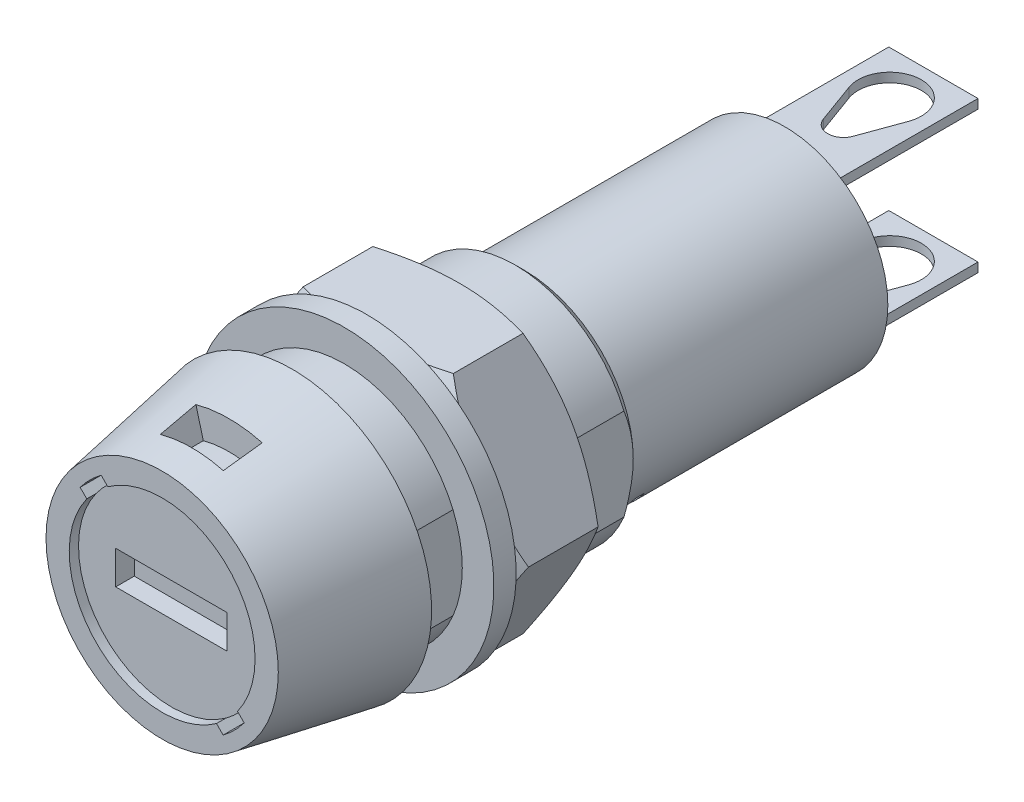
ISO-10303-21;
HEADER;
FILE_DESCRIPTION(('STEP AP214'),'2;1');
FILE_NAME('part.step','',(''),(''),'','','');
FILE_SCHEMA(('AUTOMOTIVE_DESIGN { 1 0 10303 214 1 1 1 1 }'));
ENDSEC;
DATA;
#1=APPLICATION_CONTEXT('core data for automotive mechanical design processes');
#2=APPLICATION_PROTOCOL_DEFINITION('international standard','automotive_design',2000,#1);
#3=PRODUCT_CONTEXT('',#1,'mechanical');
#4=PRODUCT('Part','Part','',(#3));
#5=PRODUCT_RELATED_PRODUCT_CATEGORY('part','',(#4));
#6=PRODUCT_DEFINITION_FORMATION('','',#4);
#7=PRODUCT_DEFINITION_CONTEXT('part definition',#1,'design');
#8=PRODUCT_DEFINITION('design','',#6,#7);
#9=PRODUCT_DEFINITION_SHAPE('','',#8);
#10=(LENGTH_UNIT() NAMED_UNIT(*) SI_UNIT(.MILLI.,.METRE.));
#11=(NAMED_UNIT(*) PLANE_ANGLE_UNIT() SI_UNIT($,.RADIAN.));
#12=(NAMED_UNIT(*) SI_UNIT($,.STERADIAN.) SOLID_ANGLE_UNIT());
#13=UNCERTAINTY_MEASURE_WITH_UNIT(LENGTH_MEASURE(1.E-05),#10,'distance_accuracy_value','');
#14=(GEOMETRIC_REPRESENTATION_CONTEXT(3) GLOBAL_UNCERTAINTY_ASSIGNED_CONTEXT((#13)) GLOBAL_UNIT_ASSIGNED_CONTEXT((#10,
#11,#12)) REPRESENTATION_CONTEXT('',''));
#15=CARTESIAN_POINT('',(0.,0.,0.));
#16=DIRECTION('',(0.,0.,1.));
#17=DIRECTION('',(1.,0.,0.));
#18=AXIS2_PLACEMENT_3D('',#15,#16,#17);
#19=CARTESIAN_POINT('',(0.,0.,5.5));
#20=DIRECTION('',(0.,0.,1.));
#21=DIRECTION('',(1.,0.,0.));
#22=AXIS2_PLACEMENT_3D('',#19,#20,#21);
#23=PLANE('',#22);
#24=DIRECTION('',(0.,1.,0.));
#25=VECTOR('',#24,1.);
#26=CARTESIAN_POINT('',(-3.,0.9,5.5));
#27=LINE('',#26,#25);
#28=CARTESIAN_POINT('',(-3.,0.9,5.5));
#29=VERTEX_POINT('',#28);
#30=CARTESIAN_POINT('',(-3.,-0.9,5.5));
#31=VERTEX_POINT('',#30);
#32=EDGE_CURVE('E874',#29,#31,#27,.F.);
#33=ORIENTED_EDGE('',*,*,#32,.T.);
#34=DIRECTION('',(1.,0.,0.));
#35=VECTOR('',#34,1.);
#36=CARTESIAN_POINT('',(-3.,-0.9,5.5));
#37=LINE('',#36,#35);
#38=CARTESIAN_POINT('',(3.,-0.9,5.5));
#39=VERTEX_POINT('',#38);
#40=EDGE_CURVE('E869',#31,#39,#37,.T.);
#41=ORIENTED_EDGE('',*,*,#40,.T.);
#42=DIRECTION('',(0.,1.,0.));
#43=VECTOR('',#42,1.);
#44=CARTESIAN_POINT('',(3.,-0.9,5.5));
#45=LINE('',#44,#43);
#46=CARTESIAN_POINT('',(3.,0.9,5.5));
#47=VERTEX_POINT('',#46);
#48=EDGE_CURVE('E884',#39,#47,#45,.T.);
#49=ORIENTED_EDGE('',*,*,#48,.T.);
#50=DIRECTION('',(1.,0.,0.));
#51=VECTOR('',#50,1.);
#52=CARTESIAN_POINT('',(3.,0.9,5.5));
#53=LINE('',#52,#51);
#54=EDGE_CURVE('E879',#47,#29,#53,.F.);
#55=ORIENTED_EDGE('',*,*,#54,.T.);
#56=EDGE_LOOP('',(#33,#41,#49,#55));
#57=FACE_BOUND('',#56,.T.);
#58=ADVANCED_FACE('F16',(#57),#23,.T.);
#59=CARTESIAN_POINT('',(0.,0.,7.5));
#60=DIRECTION('',(0.,0.,1.));
#61=DIRECTION('',(1.,0.,0.));
#62=AXIS2_PLACEMENT_3D('',#59,#60,#61);
#63=CYLINDRICAL_SURFACE('',#62,5.);
#64=CARTESIAN_POINT('',(0.,0.,5.5));
#65=DIRECTION('',(0.,0.,1.));
#66=DIRECTION('',(1.,0.,0.));
#67=AXIS2_PLACEMENT_3D('',#64,#65,#66);
#68=CIRCLE('',#67,5.);
#69=CARTESIAN_POINT('',(-2.92430024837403,4.05567109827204,5.5));
#70=VERTEX_POINT('',#69);
#71=CARTESIAN_POINT('',(-4.05567109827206,2.92430024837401,5.5));
#72=VERTEX_POINT('',#71);
#73=EDGE_CURVE('E19',#70,#72,#68,.T.);
#74=ORIENTED_EDGE('',*,*,#73,.T.);
#75=DIRECTION('',(0.,0.,1.));
#76=VECTOR('',#75,1.);
#77=CARTESIAN_POINT('',(-4.05567109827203,2.92430024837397,7.5));
#78=LINE('',#77,#76);
#79=CARTESIAN_POINT('',(-4.05567109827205,2.92430024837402,6.5));
#80=VERTEX_POINT('',#79);
#81=EDGE_CURVE('E439',#72,#80,#78,.T.);
#82=ORIENTED_EDGE('',*,*,#81,.T.);
#83=CARTESIAN_POINT('',(0.,0.,6.5));
#84=DIRECTION('',(0.,0.,1.));
#85=DIRECTION('',(1.,0.,0.));
#86=AXIS2_PLACEMENT_3D('',#83,#84,#85);
#87=CIRCLE('',#86,5.);
#88=CARTESIAN_POINT('',(-2.92430024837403,4.05567109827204,6.5));
#89=VERTEX_POINT('',#88);
#90=EDGE_CURVE('E408',#80,#89,#87,.F.);
#91=ORIENTED_EDGE('',*,*,#90,.T.);
#92=DIRECTION('',(0.,0.,1.));
#93=VECTOR('',#92,1.);
#94=CARTESIAN_POINT('',(-2.924300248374,4.055671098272,7.5));
#95=LINE('',#94,#93);
#96=EDGE_CURVE('E402',#89,#70,#95,.F.);
#97=ORIENTED_EDGE('',*,*,#96,.T.);
#98=EDGE_LOOP('',(#74,#82,#91,#97));
#99=FACE_BOUND('',#98,.T.);
#100=ADVANCED_FACE('F404',(#99),#63,.T.);
#101=CARTESIAN_POINT('',(0.,0.,7.5));
#102=DIRECTION('',(0.,0.,1.));
#103=DIRECTION('',(1.,0.,0.));
#104=AXIS2_PLACEMENT_3D('',#101,#102,#103);
#105=CYLINDRICAL_SURFACE('',#104,5.);
#106=CARTESIAN_POINT('',(0.,0.,5.5));
#107=DIRECTION('',(0.,0.,1.));
#108=DIRECTION('',(1.,0.,0.));
#109=AXIS2_PLACEMENT_3D('',#106,#107,#108);
#110=CIRCLE('',#109,5.);
#111=CARTESIAN_POINT('',(2.92430024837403,-4.05567109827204,5.5));
#112=VERTEX_POINT('',#111);
#113=CARTESIAN_POINT('',(4.05567109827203,-2.92430024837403,5.5));
#114=VERTEX_POINT('',#113);
#115=EDGE_CURVE('E862',#112,#114,#110,.T.);
#116=ORIENTED_EDGE('',*,*,#115,.T.);
#117=DIRECTION('',(0.,0.,1.));
#118=VECTOR('',#117,1.);
#119=CARTESIAN_POINT('',(4.055671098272,-2.924300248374,7.5));
#120=LINE('',#119,#118);
#121=CARTESIAN_POINT('',(4.05567109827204,-2.92430024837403,6.5));
#122=VERTEX_POINT('',#121);
#123=EDGE_CURVE('E437',#114,#122,#120,.T.);
#124=ORIENTED_EDGE('',*,*,#123,.T.);
#125=CARTESIAN_POINT('',(0.,0.,6.5));
#126=DIRECTION('',(0.,0.,1.));
#127=DIRECTION('',(1.,0.,0.));
#128=AXIS2_PLACEMENT_3D('',#125,#126,#127);
#129=CIRCLE('',#128,5.);
#130=CARTESIAN_POINT('',(2.92430024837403,-4.05567109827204,6.5));
#131=VERTEX_POINT('',#130);
#132=EDGE_CURVE('E852',#122,#131,#129,.F.);
#133=ORIENTED_EDGE('',*,*,#132,.T.);
#134=DIRECTION('',(0.,0.,1.));
#135=VECTOR('',#134,1.);
#136=CARTESIAN_POINT('',(2.924300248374,-4.055671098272,7.5));
#137=LINE('',#136,#135);
#138=EDGE_CURVE('E440',#131,#112,#137,.F.);
#139=ORIENTED_EDGE('',*,*,#138,.T.);
#140=EDGE_LOOP('',(#116,#124,#133,#139));
#141=FACE_BOUND('',#140,.T.);
#142=ADVANCED_FACE('F1112',(#141),#105,.T.);
#143=CARTESIAN_POINT('',(3.,-0.9,7.5));
#144=DIRECTION('',(1.,0.,0.));
#145=DIRECTION('',(0.,0.,-1.));
#146=AXIS2_PLACEMENT_3D('',#143,#144,#145);
#147=PLANE('',#146);
#148=ORIENTED_EDGE('',*,*,#48,.F.);
#149=DIRECTION('',(0.,0.,-1.));
#150=VECTOR('',#149,1.);
#151=CARTESIAN_POINT('',(3.,-0.9,7.5));
#152=LINE('',#151,#150);
#153=CARTESIAN_POINT('',(3.,-0.9,6.5));
#154=VERTEX_POINT('',#153);
#155=EDGE_CURVE('E442',#39,#154,#152,.F.);
#156=ORIENTED_EDGE('',*,*,#155,.T.);
#157=DIRECTION('',(0.,1.,0.));
#158=VECTOR('',#157,1.);
#159=CARTESIAN_POINT('',(3.,0.,6.5));
#160=LINE('',#159,#158);
#161=CARTESIAN_POINT('',(3.,0.9,6.5));
#162=VERTEX_POINT('',#161);
#163=EDGE_CURVE('E850',#154,#162,#160,.T.);
#164=ORIENTED_EDGE('',*,*,#163,.T.);
#165=DIRECTION('',(0.,0.,1.));
#166=VECTOR('',#165,1.);
#167=CARTESIAN_POINT('',(3.,0.9,7.5));
#168=LINE('',#167,#166);
#169=EDGE_CURVE('E881',#162,#47,#168,.F.);
#170=ORIENTED_EDGE('',*,*,#169,.T.);
#171=EDGE_LOOP('',(#148,#156,#164,#170));
#172=FACE_BOUND('',#171,.T.);
#173=ADVANCED_FACE('F1114',(#172),#147,.F.);
#174=CARTESIAN_POINT('',(3.,0.9,7.5));
#175=DIRECTION('',(0.,1.,0.));
#176=DIRECTION('',(0.,0.,1.));
#177=AXIS2_PLACEMENT_3D('',#174,#175,#176);
#178=PLANE('',#177);
#179=ORIENTED_EDGE('',*,*,#54,.F.);
#180=ORIENTED_EDGE('',*,*,#169,.F.);
#181=DIRECTION('',(1.,0.,0.));
#182=VECTOR('',#181,1.);
#183=CARTESIAN_POINT('',(0.,0.9,6.5));
#184=LINE('',#183,#182);
#185=CARTESIAN_POINT('',(-3.,0.9,6.5));
#186=VERTEX_POINT('',#185);
#187=EDGE_CURVE('E848',#162,#186,#184,.F.);
#188=ORIENTED_EDGE('',*,*,#187,.T.);
#189=DIRECTION('',(0.,0.,1.));
#190=VECTOR('',#189,1.);
#191=CARTESIAN_POINT('',(-3.,0.9,7.5));
#192=LINE('',#191,#190);
#193=EDGE_CURVE('E876',#186,#29,#192,.F.);
#194=ORIENTED_EDGE('',*,*,#193,.T.);
#195=EDGE_LOOP('',(#179,#180,#188,#194));
#196=FACE_BOUND('',#195,.T.);
#197=ADVANCED_FACE('F1120',(#196),#178,.F.);
#198=CARTESIAN_POINT('',(-3.,0.9,7.5));
#199=DIRECTION('',(-1.,0.,0.));
#200=DIRECTION('',(0.,0.,1.));
#201=AXIS2_PLACEMENT_3D('',#198,#199,#200);
#202=PLANE('',#201);
#203=ORIENTED_EDGE('',*,*,#32,.F.);
#204=ORIENTED_EDGE('',*,*,#193,.F.);
#205=DIRECTION('',(0.,1.,0.));
#206=VECTOR('',#205,1.);
#207=CARTESIAN_POINT('',(-3.,0.,6.5));
#208=LINE('',#207,#206);
#209=CARTESIAN_POINT('',(-3.,-0.9,6.5));
#210=VERTEX_POINT('',#209);
#211=EDGE_CURVE('E846',#186,#210,#208,.F.);
#212=ORIENTED_EDGE('',*,*,#211,.T.);
#213=DIRECTION('',(0.,0.,-1.));
#214=VECTOR('',#213,1.);
#215=CARTESIAN_POINT('',(-3.,-0.9,7.5));
#216=LINE('',#215,#214);
#217=EDGE_CURVE('E871',#210,#31,#216,.T.);
#218=ORIENTED_EDGE('',*,*,#217,.T.);
#219=EDGE_LOOP('',(#203,#204,#212,#218));
#220=FACE_BOUND('',#219,.T.);
#221=ADVANCED_FACE('F1126',(#220),#202,.F.);
#222=CARTESIAN_POINT('',(-3.,-0.9,7.5));
#223=DIRECTION('',(0.,-1.,0.));
#224=DIRECTION('',(0.,0.,-1.));
#225=AXIS2_PLACEMENT_3D('',#222,#223,#224);
#226=PLANE('',#225);
#227=ORIENTED_EDGE('',*,*,#40,.F.);
#228=ORIENTED_EDGE('',*,*,#217,.F.);
#229=DIRECTION('',(1.,0.,0.));
#230=VECTOR('',#229,1.);
#231=CARTESIAN_POINT('',(0.,-0.9,6.5));
#232=LINE('',#231,#230);
#233=EDGE_CURVE('E843',#210,#154,#232,.T.);
#234=ORIENTED_EDGE('',*,*,#233,.T.);
#235=ORIENTED_EDGE('',*,*,#155,.F.);
#236=EDGE_LOOP('',(#227,#228,#234,#235));
#237=FACE_BOUND('',#236,.T.);
#238=ADVANCED_FACE('F1130',(#237),#226,.F.);
#239=CARTESIAN_POINT('',(-2.924300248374,4.055671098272,7.5));
#240=DIRECTION('',(0.707106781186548,0.707106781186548,0.));
#241=DIRECTION('',(-0.707106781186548,0.707106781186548,0.));
#242=AXIS2_PLACEMENT_3D('',#239,#240,#241);
#243=PLANE('',#242);
#244=DIRECTION('',(0.,0.,1.));
#245=VECTOR('',#244,1.);
#246=CARTESIAN_POINT('',(-3.28204117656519,4.41341202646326,7.5));
#247=LINE('',#246,#245);
#248=CARTESIAN_POINT('',(-3.28204117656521,4.41341202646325,7.));
#249=VERTEX_POINT('',#248);
#250=CARTESIAN_POINT('',(-3.28204117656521,4.41341202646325,5.5));
#251=VERTEX_POINT('',#250);
#252=EDGE_CURVE('E418',#249,#251,#247,.F.);
#253=ORIENTED_EDGE('',*,*,#252,.T.);
#254=DIRECTION('',(0.707106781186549,-0.707106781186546,0.));
#255=VECTOR('',#254,1.);
#256=CARTESIAN_POINT('',(-3.28204117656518,4.41341202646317,5.5));
#257=LINE('',#256,#255);
#258=EDGE_CURVE('E415',#251,#70,#257,.T.);
#259=ORIENTED_EDGE('',*,*,#258,.T.);
#260=ORIENTED_EDGE('',*,*,#96,.F.);
#261=DIRECTION('',(0.,0.,1.));
#262=VECTOR('',#261,1.);
#263=CARTESIAN_POINT('',(-2.924300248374,4.055671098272,7.5));
#264=LINE('',#263,#262);
#265=CARTESIAN_POINT('',(-2.92430024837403,4.05567109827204,7.));
#266=VERTEX_POINT('',#265);
#267=EDGE_CURVE('E412',#266,#89,#264,.F.);
#268=ORIENTED_EDGE('',*,*,#267,.F.);
#269=DIRECTION('',(-0.707106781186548,0.707106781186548,0.));
#270=VECTOR('',#269,1.);
#271=CARTESIAN_POINT('',(-2.924300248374,4.055671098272,7.));
#272=LINE('',#271,#270);
#273=EDGE_CURVE('E411',#249,#266,#272,.F.);
#274=ORIENTED_EDGE('',*,*,#273,.F.);
#275=EDGE_LOOP('',(#253,#259,#260,#268,#274));
#276=FACE_BOUND('',#275,.T.);
#277=ADVANCED_FACE('F416',(#276),#243,.F.);
#278=CARTESIAN_POINT('',(0.,0.,5.5));
#279=DIRECTION('',(0.,0.,1.));
#280=DIRECTION('',(1.,0.,0.));
#281=AXIS2_PLACEMENT_3D('',#278,#279,#280);
#282=PLANE('',#281);
#283=DIRECTION('',(0.707106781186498,-0.707106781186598,0.));
#284=VECTOR('',#283,1.);
#285=CARTESIAN_POINT('',(-4.413412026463,3.282041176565,5.5));
#286=LINE('',#285,#284);
#287=CARTESIAN_POINT('',(-4.41341202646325,3.28204117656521,5.5));
#288=VERTEX_POINT('',#287);
#289=EDGE_CURVE('E424',#288,#72,#286,.T.);
#290=ORIENTED_EDGE('',*,*,#289,.T.);
#291=ORIENTED_EDGE('',*,*,#73,.F.);
#292=ORIENTED_EDGE('',*,*,#258,.F.);
#293=CARTESIAN_POINT('',(0.,0.,5.5));
#294=DIRECTION('',(0.,0.,1.));
#295=DIRECTION('',(1.,0.,0.));
#296=AXIS2_PLACEMENT_3D('',#293,#294,#295);
#297=CIRCLE('',#296,5.5);
#298=EDGE_CURVE('E830',#251,#288,#297,.T.);
#299=ORIENTED_EDGE('',*,*,#298,.T.);
#300=EDGE_LOOP('',(#290,#291,#292,#299));
#301=FACE_BOUND('',#300,.T.);
#302=ADVANCED_FACE('F422',(#301),#282,.T.);
#303=CARTESIAN_POINT('',(-4.413412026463,3.282041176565,7.5));
#304=DIRECTION('',(-0.707106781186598,-0.707106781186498,0.));
#305=DIRECTION('',(0.707106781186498,-0.707106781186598,0.));
#306=AXIS2_PLACEMENT_3D('',#303,#304,#305);
#307=PLANE('',#306);
#308=ORIENTED_EDGE('',*,*,#289,.F.);
#309=DIRECTION('',(0.,0.,1.));
#310=VECTOR('',#309,1.);
#311=CARTESIAN_POINT('',(-4.41341202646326,3.28204117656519,7.5));
#312=LINE('',#311,#310);
#313=CARTESIAN_POINT('',(-4.41341202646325,3.28204117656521,7.));
#314=VERTEX_POINT('',#313);
#315=EDGE_CURVE('E827',#288,#314,#312,.T.);
#316=ORIENTED_EDGE('',*,*,#315,.T.);
#317=DIRECTION('',(0.707106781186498,-0.707106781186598,0.));
#318=VECTOR('',#317,1.);
#319=CARTESIAN_POINT('',(-4.413412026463,3.282041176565,7.));
#320=LINE('',#319,#318);
#321=CARTESIAN_POINT('',(-4.05567109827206,2.92430024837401,7.));
#322=VERTEX_POINT('',#321);
#323=EDGE_CURVE('E427',#322,#314,#320,.F.);
#324=ORIENTED_EDGE('',*,*,#323,.F.);
#325=DIRECTION('',(0.,0.,1.));
#326=VECTOR('',#325,1.);
#327=CARTESIAN_POINT('',(-4.05567109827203,2.92430024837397,7.5));
#328=LINE('',#327,#326);
#329=EDGE_CURVE('E426',#80,#322,#328,.T.);
#330=ORIENTED_EDGE('',*,*,#329,.F.);
#331=ORIENTED_EDGE('',*,*,#81,.F.);
#332=EDGE_LOOP('',(#308,#316,#324,#330,#331));
#333=FACE_BOUND('',#332,.T.);
#334=ADVANCED_FACE('F1091',(#333),#307,.F.);
#335=CARTESIAN_POINT('',(2.924300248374,-4.055671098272,7.5));
#336=DIRECTION('',(-0.707106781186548,-0.707106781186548,0.));
#337=DIRECTION('',(0.707106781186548,-0.707106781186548,0.));
#338=AXIS2_PLACEMENT_3D('',#335,#336,#337);
#339=PLANE('',#338);
#340=DIRECTION('',(0.,0.,1.));
#341=VECTOR('',#340,1.);
#342=CARTESIAN_POINT('',(3.28204117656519,-4.41341202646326,7.5));
#343=LINE('',#342,#341);
#344=CARTESIAN_POINT('',(3.28204117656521,-4.41341202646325,7.));
#345=VERTEX_POINT('',#344);
#346=CARTESIAN_POINT('',(3.28204117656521,-4.41341202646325,5.5));
#347=VERTEX_POINT('',#346);
#348=EDGE_CURVE('E821',#345,#347,#343,.F.);
#349=ORIENTED_EDGE('',*,*,#348,.T.);
#350=DIRECTION('',(-0.707106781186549,0.707106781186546,0.));
#351=VECTOR('',#350,1.);
#352=CARTESIAN_POINT('',(3.28204117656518,-4.41341202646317,5.5));
#353=LINE('',#352,#351);
#354=EDGE_CURVE('E859',#347,#112,#353,.T.);
#355=ORIENTED_EDGE('',*,*,#354,.T.);
#356=ORIENTED_EDGE('',*,*,#138,.F.);
#357=DIRECTION('',(0.,0.,1.));
#358=VECTOR('',#357,1.);
#359=CARTESIAN_POINT('',(2.92430024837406,-4.05567109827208,7.));
#360=LINE('',#359,#358);
#361=CARTESIAN_POINT('',(2.92430024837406,-4.05567109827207,7.));
#362=VERTEX_POINT('',#361);
#363=EDGE_CURVE('E823',#131,#362,#360,.T.);
#364=ORIENTED_EDGE('',*,*,#363,.T.);
#365=DIRECTION('',(0.707106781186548,-0.707106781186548,0.));
#366=VECTOR('',#365,1.);
#367=CARTESIAN_POINT('',(2.924300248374,-4.055671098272,7.));
#368=LINE('',#367,#366);
#369=EDGE_CURVE('E863',#345,#362,#368,.F.);
#370=ORIENTED_EDGE('',*,*,#369,.F.);
#371=EDGE_LOOP('',(#349,#355,#356,#364,#370));
#372=FACE_BOUND('',#371,.T.);
#373=ADVANCED_FACE('F1110',(#372),#339,.F.);
#374=CARTESIAN_POINT('',(0.,0.,5.5));
#375=DIRECTION('',(0.,0.,1.));
#376=DIRECTION('',(1.,0.,0.));
#377=AXIS2_PLACEMENT_3D('',#374,#375,#376);
#378=PLANE('',#377);
#379=DIRECTION('',(-0.707106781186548,0.707106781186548,0.));
#380=VECTOR('',#379,1.);
#381=CARTESIAN_POINT('',(4.413412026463,-3.282041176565,5.5));
#382=LINE('',#381,#380);
#383=CARTESIAN_POINT('',(4.41341202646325,-3.28204117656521,5.5));
#384=VERTEX_POINT('',#383);
#385=EDGE_CURVE('E855',#384,#114,#382,.T.);
#386=ORIENTED_EDGE('',*,*,#385,.T.);
#387=ORIENTED_EDGE('',*,*,#115,.F.);
#388=ORIENTED_EDGE('',*,*,#354,.F.);
#389=CARTESIAN_POINT('',(0.,0.,5.5));
#390=DIRECTION('',(0.,0.,1.));
#391=DIRECTION('',(1.,0.,0.));
#392=AXIS2_PLACEMENT_3D('',#389,#390,#391);
#393=CIRCLE('',#392,5.5);
#394=EDGE_CURVE('E820',#347,#384,#393,.T.);
#395=ORIENTED_EDGE('',*,*,#394,.T.);
#396=EDGE_LOOP('',(#386,#387,#388,#395));
#397=FACE_BOUND('',#396,.T.);
#398=ADVANCED_FACE('F1143',(#397),#378,.T.);
#399=CARTESIAN_POINT('',(4.413412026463,-3.282041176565,7.5));
#400=DIRECTION('',(0.707106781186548,0.707106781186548,0.));
#401=DIRECTION('',(-0.707106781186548,0.707106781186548,0.));
#402=AXIS2_PLACEMENT_3D('',#399,#400,#401);
#403=PLANE('',#402);
#404=ORIENTED_EDGE('',*,*,#385,.F.);
#405=DIRECTION('',(0.,0.,1.));
#406=VECTOR('',#405,1.);
#407=CARTESIAN_POINT('',(4.41341202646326,-3.28204117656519,7.5));
#408=LINE('',#407,#406);
#409=CARTESIAN_POINT('',(4.41341202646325,-3.28204117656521,7.));
#410=VERTEX_POINT('',#409);
#411=EDGE_CURVE('E816',#384,#410,#408,.T.);
#412=ORIENTED_EDGE('',*,*,#411,.T.);
#413=DIRECTION('',(-0.707106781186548,0.707106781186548,0.));
#414=VECTOR('',#413,1.);
#415=CARTESIAN_POINT('',(4.413412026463,-3.282041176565,7.));
#416=LINE('',#415,#414);
#417=CARTESIAN_POINT('',(4.05567109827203,-2.92430024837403,7.));
#418=VERTEX_POINT('',#417);
#419=EDGE_CURVE('E853',#418,#410,#416,.F.);
#420=ORIENTED_EDGE('',*,*,#419,.F.);
#421=DIRECTION('',(0.,0.,1.));
#422=VECTOR('',#421,1.);
#423=CARTESIAN_POINT('',(4.055671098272,-2.924300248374,7.5));
#424=LINE('',#423,#422);
#425=EDGE_CURVE('E856',#122,#418,#424,.T.);
#426=ORIENTED_EDGE('',*,*,#425,.F.);
#427=ORIENTED_EDGE('',*,*,#123,.F.);
#428=EDGE_LOOP('',(#404,#412,#420,#426,#427));
#429=FACE_BOUND('',#428,.T.);
#430=ADVANCED_FACE('F1102',(#429),#403,.F.);
#431=CARTESIAN_POINT('',(0.,0.,6.5));
#432=DIRECTION('',(0.,0.,1.));
#433=DIRECTION('',(1.,0.,0.));
#434=AXIS2_PLACEMENT_3D('',#431,#432,#433);
#435=PLANE('',#434);
#436=ORIENTED_EDGE('',*,*,#211,.F.);
#437=ORIENTED_EDGE('',*,*,#187,.F.);
#438=ORIENTED_EDGE('',*,*,#163,.F.);
#439=ORIENTED_EDGE('',*,*,#233,.F.);
#440=EDGE_LOOP('',(#436,#437,#438,#439));
#441=FACE_BOUND('',#440,.T.);
#442=ORIENTED_EDGE('',*,*,#132,.F.);
#443=CARTESIAN_POINT('',(0.,0.,6.5));
#444=DIRECTION('',(0.,0.,1.));
#445=DIRECTION('',(1.,0.,0.));
#446=AXIS2_PLACEMENT_3D('',#443,#444,#445);
#447=CIRCLE('',#446,5.);
#448=EDGE_CURVE('E819',#122,#89,#447,.T.);
#449=ORIENTED_EDGE('',*,*,#448,.T.);
#450=ORIENTED_EDGE('',*,*,#90,.F.);
#451=CARTESIAN_POINT('',(0.,0.,6.5));
#452=DIRECTION('',(0.,0.,1.));
#453=DIRECTION('',(1.,0.,0.));
#454=AXIS2_PLACEMENT_3D('',#451,#452,#453);
#455=CIRCLE('',#454,5.);
#456=EDGE_CURVE('E826',#80,#131,#455,.T.);
#457=ORIENTED_EDGE('',*,*,#456,.T.);
#458=EDGE_LOOP('',(#442,#449,#450,#457));
#459=FACE_BOUND('',#458,.T.);
#460=ADVANCED_FACE('F1096',(#441,#459),#435,.T.);
#461=CARTESIAN_POINT('',(0.,0.,5.4));
#462=DIRECTION('',(0.,0.,1.));
#463=DIRECTION('',(1.,0.,0.));
#464=AXIS2_PLACEMENT_3D('',#461,#462,#463);
#465=PLANE('',#464);
#466=CARTESIAN_POINT('',(0.,0.,5.4));
#467=DIRECTION('',(0.,0.,1.));
#468=DIRECTION('',(1.,0.,0.));
#469=AXIS2_PLACEMENT_3D('',#466,#467,#468);
#470=CIRCLE('',#469,5.35);
#471=CARTESIAN_POINT('',(1.38468189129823,5.16770317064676,5.4));
#472=VERTEX_POINT('',#471);
#473=CARTESIAN_POINT('',(-1.38468189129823,5.16770317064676,5.4));
#474=VERTEX_POINT('',#473);
#475=EDGE_CURVE('E903',#472,#474,#470,.T.);
#476=ORIENTED_EDGE('',*,*,#475,.T.);
#477=DIRECTION('',(0.258819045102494,-0.965925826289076,0.));
#478=VECTOR('',#477,1.);
#479=CARTESIAN_POINT('',(-1.691567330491,6.313015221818,5.4));
#480=LINE('',#479,#478);
#481=CARTESIAN_POINT('',(-1.69156733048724,6.31301522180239,5.40000000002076));
#482=VERTEX_POINT('',#481);
#483=EDGE_CURVE('E840',#482,#474,#480,.T.);
#484=ORIENTED_EDGE('',*,*,#483,.F.);
#485=CARTESIAN_POINT('',(0.,0.,5.40000000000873));
#486=DIRECTION('',(0.,0.,-1.));
#487=DIRECTION('',(-1.,0.,0.));
#488=AXIS2_PLACEMENT_3D('',#485,#486,#487);
#489=CIRCLE('',#488,6.5357142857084);
#490=CARTESIAN_POINT('',(1.6915673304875,6.3130152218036,5.40000000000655));
#491=VERTEX_POINT('',#490);
#492=EDGE_CURVE('E842',#491,#482,#489,.F.);
#493=ORIENTED_EDGE('',*,*,#492,.F.);
#494=DIRECTION('',(0.258819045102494,0.965925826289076,0.));
#495=VECTOR('',#494,1.);
#496=CARTESIAN_POINT('',(1.38468189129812,5.16770317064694,5.4));
#497=LINE('',#496,#495);
#498=EDGE_CURVE('E837',#472,#491,#497,.T.);
#499=ORIENTED_EDGE('',*,*,#498,.F.);
#500=EDGE_LOOP('',(#476,#484,#493,#499));
#501=FACE_BOUND('',#500,.T.);
#502=ADVANCED_FACE('F1151',(#501),#465,.F.);
#503=CARTESIAN_POINT('',(0.,0.,5.4));
#504=DIRECTION('',(0.,0.,-1.));
#505=DIRECTION('',(-1.,0.,0.));
#506=AXIS2_PLACEMENT_3D('',#503,#504,#505);
#507=PLANE('',#506);
#508=DIRECTION('',(-0.258819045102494,-0.965925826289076,0.));
#509=VECTOR('',#508,1.);
#510=CARTESIAN_POINT('',(-1.38468189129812,-5.16770317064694,5.4));
#511=LINE('',#510,#509);
#512=CARTESIAN_POINT('',(-1.38468189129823,-5.16770317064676,5.4));
#513=VERTEX_POINT('',#512);
#514=CARTESIAN_POINT('',(-1.69156733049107,-6.31301522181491,5.40000000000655));
#515=VERTEX_POINT('',#514);
#516=EDGE_CURVE('E833',#513,#515,#511,.T.);
#517=ORIENTED_EDGE('',*,*,#516,.F.);
#518=CARTESIAN_POINT('',(0.,0.,5.4));
#519=DIRECTION('',(0.,0.,-1.));
#520=DIRECTION('',(-1.,0.,0.));
#521=AXIS2_PLACEMENT_3D('',#518,#519,#520);
#522=CIRCLE('',#521,5.35);
#523=CARTESIAN_POINT('',(1.38468189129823,-5.16770317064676,5.4));
#524=VERTEX_POINT('',#523);
#525=EDGE_CURVE('E906',#513,#524,#522,.F.);
#526=ORIENTED_EDGE('',*,*,#525,.T.);
#527=DIRECTION('',(-0.258819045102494,0.965925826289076,0.));
#528=VECTOR('',#527,1.);
#529=CARTESIAN_POINT('',(1.691567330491,-6.313015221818,5.4));
#530=LINE('',#529,#528);
#531=CARTESIAN_POINT('',(1.69156733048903,-6.31301522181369,5.40000000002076));
#532=VERTEX_POINT('',#531);
#533=EDGE_CURVE('E835',#532,#524,#530,.T.);
#534=ORIENTED_EDGE('',*,*,#533,.F.);
#535=CARTESIAN_POINT('',(0.,0.,5.40000000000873));
#536=DIRECTION('',(0.,0.,-1.));
#537=DIRECTION('',(-1.,0.,0.));
#538=AXIS2_PLACEMENT_3D('',#535,#536,#537);
#539=CIRCLE('',#538,6.5357142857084);
#540=EDGE_CURVE('E832',#515,#532,#539,.F.);
#541=ORIENTED_EDGE('',*,*,#540,.F.);
#542=EDGE_LOOP('',(#517,#526,#534,#541));
#543=FACE_BOUND('',#542,.T.);
#544=ADVANCED_FACE('F1155',(#543),#507,.T.);
#545=CARTESIAN_POINT('',(0.,0.,-4.62896607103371));
#546=DIRECTION('',(0.,0.,-1.));
#547=DIRECTION('',(-1.,0.,0.));
#548=AXIS2_PLACEMENT_3D('',#545,#546,#547);
#549=CONICAL_SURFACE('',#548,8.08940119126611,1.0471975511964);
#550=CARTESIAN_POINT('',(0.,0.,-4.00000000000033));
#551=DIRECTION('',(0.,0.,-1.));
#552=DIRECTION('',(-1.,0.,0.));
#553=AXIS2_PLACEMENT_3D('',#550,#551,#552);
#554=CIRCLE('',#553,6.99999999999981);
#555=CARTESIAN_POINT('',(-6.06217782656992,3.49999999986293,-4.00000000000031));
#556=VERTEX_POINT('',#555);
#557=CARTESIAN_POINT('',(-1.93287019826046E-12,6.99999999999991,-4.00000000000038));
#558=VERTEX_POINT('',#557);
#559=EDGE_CURVE('E919',#556,#558,#554,.T.);
#560=ORIENTED_EDGE('',*,*,#559,.T.);
#561=CARTESIAN_POINT('',(-3.86531178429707E-12,7.,-4.00000000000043));
#562=CARTESIAN_POINT('',(-0.171536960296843,7.,-3.99997139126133));
#563=CARTESIAN_POINT('',(-0.343065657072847,7.,-4.00363970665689));
#564=CARTESIAN_POINT('',(-0.685786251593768,7.,-4.0181575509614));
#565=CARTESIAN_POINT('',(-0.85697820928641,7.,-4.02900565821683));
#566=CARTESIAN_POINT('',(-1.19791956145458,7.,-4.05759901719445));
#567=CARTESIAN_POINT('',(-1.3676718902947,7.,-4.07530954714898));
#568=CARTESIAN_POINT('',(-1.70636778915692,7.,-4.11724679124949));
#569=CARTESIAN_POINT('',(-1.87531133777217,7.,-4.1414736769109));
#570=CARTESIAN_POINT('',(-2.38022852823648,7.,-4.22318043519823));
#571=CARTESIAN_POINT('',(-2.7147353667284,7.,-4.28972608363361));
#572=CARTESIAN_POINT('',(-3.38087243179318,7.,-4.44319736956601));
#573=CARTESIAN_POINT('',(-3.7124794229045,7.,-4.53022478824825));
#574=CARTESIAN_POINT('',(-4.04145188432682,7.,-4.62521478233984));
#575=B_SPLINE_CURVE_WITH_KNOTS('',3,(#561,#562,#563,#564,#565,#566,#567,#568,#569,#570,#571,
#572,#573,#574),.UNSPECIFIED.,.F.,.F.,(4,2,2,2,2,2,4),(0.,0.514558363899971,1.02901487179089,
1.54090167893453,2.05280196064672,3.07526084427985,4.10291216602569),.UNSPECIFIED.);
#576=CARTESIAN_POINT('',(-4.04145188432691,7.,-4.62521478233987));
#577=VERTEX_POINT('',#576);
#578=EDGE_CURVE('E805',#558,#577,#575,.T.);
#579=ORIENTED_EDGE('',*,*,#578,.T.);
#580=CARTESIAN_POINT('',(-4.04145188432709,6.99999999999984,-4.62521478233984));
#581=CARTESIAN_POINT('',(-4.20593811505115,6.71510149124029,-4.53022478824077));
#582=CARTESIAN_POINT('',(-4.37174161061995,6.42792141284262,-4.44319736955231));
#583=CARTESIAN_POINT('',(-4.70481014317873,5.85102979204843,-4.28972608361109));
#584=CARTESIAN_POINT('',(-4.87206356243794,5.56133837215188,-4.22318043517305));
#585=CARTESIAN_POINT('',(-5.12452215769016,5.12406725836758,-4.14147367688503));
#586=CARTESIAN_POINT('',(-5.20899393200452,4.97775785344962,-4.11724679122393));
#587=CARTESIAN_POINT('',(-5.37834188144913,4.68443860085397,-4.07530954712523));
#588=CARTESIAN_POINT('',(-5.46321804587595,4.53742877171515,-4.0575990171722));
#589=CARTESIAN_POINT('',(-5.63368872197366,4.24216489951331,-4.02900565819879));
#590=CARTESIAN_POINT('',(-5.71928470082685,4.09390831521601,-4.01815755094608));
#591=CARTESIAN_POINT('',(-5.89064499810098,3.79710357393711,-4.00363970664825));
#592=CARTESIAN_POINT('',(-5.9764093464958,3.64855536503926,-3.99997139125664));
#593=CARTESIAN_POINT('',(-6.06217782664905,3.49999999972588,-4.00000000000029));
#594=B_SPLINE_CURVE_WITH_KNOTS('',3,(#580,#581,#582,#583,#584,#585,#586,#587,#588,#589,#590,
#591,#592,#593),.UNSPECIFIED.,.F.,.F.,(4,2,2,2,2,2,4),(0.,1.02765132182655,2.05011020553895,
2.56201048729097,3.07389729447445,3.58835380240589,4.10291216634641),.UNSPECIFIED.);
#595=EDGE_CURVE('E804',#577,#556,#594,.T.);
#596=ORIENTED_EDGE('',*,*,#595,.T.);
#597=EDGE_LOOP('',(#560,#579,#596));
#598=FACE_BOUND('',#597,.T.);
#599=ADVANCED_FACE('F1158',(#598),#549,.T.);
#600=CARTESIAN_POINT('',(0.,0.,-4.6289660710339));
#601=DIRECTION('',(0.,0.,-1.));
#602=DIRECTION('',(-1.,0.,0.));
#603=AXIS2_PLACEMENT_3D('',#600,#601,#602);
#604=CONICAL_SURFACE('',#603,8.08940119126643,1.0471975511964);
#605=CARTESIAN_POINT('',(-6.06217782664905,3.49999999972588,-4.00000000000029));
#606=CARTESIAN_POINT('',(-6.14794630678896,3.35144463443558,-3.99997139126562));
#607=CARTESIAN_POINT('',(-6.23371065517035,3.202896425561,-4.00363970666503));
#608=CARTESIAN_POINT('',(-6.40507095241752,2.90609168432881,-4.01815755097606));
#609=CARTESIAN_POINT('',(-6.49066693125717,2.75783510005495,-4.02900565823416));
#610=CARTESIAN_POINT('',(-6.66113760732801,2.46257122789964,-4.05759901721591));
#611=CARTESIAN_POINT('',(-6.7460137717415,2.31556139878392,-4.07530954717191));
#612=CARTESIAN_POINT('',(-6.91536172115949,2.02224214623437,-4.11724679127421));
#613=CARTESIAN_POINT('',(-6.99983349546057,1.87593274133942,-4.14147367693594));
#614=CARTESIAN_POINT('',(-7.25229209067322,1.43866162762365,-4.22318043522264));
#615=CARTESIAN_POINT('',(-7.41954550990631,1.14897020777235,-4.28972608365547));
#616=CARTESIAN_POINT('',(-7.75261404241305,0.572078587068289,-4.44319736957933));
#617=CARTESIAN_POINT('',(-7.91841753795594,0.284898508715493,-4.53022478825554));
#618=CARTESIAN_POINT('',(-8.08290376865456,0.,-4.62521478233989));
#619=B_SPLINE_CURVE_WITH_KNOTS('',3,(#605,#606,#607,#608,#609,#610,#611,#612,#613,#614,#615,
#616,#617,#618),.UNSPECIFIED.,.F.,.F.,(4,2,2,2,2,2,4),(0.,0.514558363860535,1.02901487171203,
1.54090167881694,2.0528019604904,3.07526084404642,4.10291216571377),.UNSPECIFIED.);
#620=CARTESIAN_POINT('',(-8.08290376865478,0.,-4.62521478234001));
#621=VERTEX_POINT('',#620);
#622=EDGE_CURVE('E800',#556,#621,#619,.T.);
#623=ORIENTED_EDGE('',*,*,#622,.T.);
#624=CARTESIAN_POINT('',(-8.08290376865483,-2.96491324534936E-13,-4.62521478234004));
#625=CARTESIAN_POINT('',(-7.91841753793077,-0.284898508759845,-4.53022478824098));
#626=CARTESIAN_POINT('',(-7.75261404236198,-0.572078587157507,-4.44319736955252));
#627=CARTESIAN_POINT('',(-7.4195455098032,-1.14897020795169,-4.28972608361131));
#628=CARTESIAN_POINT('',(-7.252292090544,-1.43866162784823,-4.22318043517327));
#629=CARTESIAN_POINT('',(-6.99983349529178,-1.87593274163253,-4.14147367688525));
#630=CARTESIAN_POINT('',(-6.91536172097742,-2.02224214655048,-4.11724679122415));
#631=CARTESIAN_POINT('',(-6.74601377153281,-2.31556139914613,-4.07530954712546));
#632=CARTESIAN_POINT('',(-6.661137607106,-2.46257122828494,-4.05759901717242));
#633=CARTESIAN_POINT('',(-6.49066693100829,-2.75783510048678,-4.02900565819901));
#634=CARTESIAN_POINT('',(-6.40507095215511,-2.90609168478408,-4.01815755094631));
#635=CARTESIAN_POINT('',(-6.23371065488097,-3.20289642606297,-4.00363970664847));
#636=CARTESIAN_POINT('',(-6.14794630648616,-3.35144463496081,-3.99997139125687));
#637=CARTESIAN_POINT('',(-6.06217782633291,-3.5000000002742,-4.00000000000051));
#638=B_SPLINE_CURVE_WITH_KNOTS('',3,(#624,#625,#626,#627,#628,#629,#630,#631,#632,#633,#634,
#635,#636,#637),.UNSPECIFIED.,.F.,.F.,(4,2,2,2,2,2,4),(0.,1.02765132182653,2.05011020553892,
2.56201048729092,3.07389729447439,3.58835380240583,4.10291216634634),.UNSPECIFIED.);
#639=CARTESIAN_POINT('',(-6.06217782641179,-3.50000000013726,-4.00000000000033));
#640=VERTEX_POINT('',#639);
#641=EDGE_CURVE('E799',#621,#640,#638,.T.);
#642=ORIENTED_EDGE('',*,*,#641,.T.);
#643=CARTESIAN_POINT('',(0.,0.,-4.00000000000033));
#644=DIRECTION('',(0.,0.,-1.));
#645=DIRECTION('',(-1.,0.,0.));
#646=AXIS2_PLACEMENT_3D('',#643,#644,#645);
#647=CIRCLE('',#646,6.99999999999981);
#648=EDGE_CURVE('E917',#640,#556,#647,.T.);
#649=ORIENTED_EDGE('',*,*,#648,.T.);
#650=EDGE_LOOP('',(#623,#642,#649));
#651=FACE_BOUND('',#650,.T.);
#652=ADVANCED_FACE('F1163',(#651),#604,.T.);
#653=CARTESIAN_POINT('',(0.,0.,-4.62896607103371));
#654=DIRECTION('',(0.,0.,-1.));
#655=DIRECTION('',(-1.,0.,0.));
#656=AXIS2_PLACEMENT_3D('',#653,#654,#655);
#657=CONICAL_SURFACE('',#656,8.08940119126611,1.0471975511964);
#658=CARTESIAN_POINT('',(0.,0.,-4.00000000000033));
#659=DIRECTION('',(0.,0.,-1.));
#660=DIRECTION('',(-1.,0.,0.));
#661=AXIS2_PLACEMENT_3D('',#658,#659,#660);
#662=CIRCLE('',#661,6.99999999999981);
#663=CARTESIAN_POINT('',(1.9938285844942E-12,-6.99999999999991,-4.00000000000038));
#664=VERTEX_POINT('',#663);
#665=EDGE_CURVE('E915',#664,#640,#662,.T.);
#666=ORIENTED_EDGE('',*,*,#665,.T.);
#667=CARTESIAN_POINT('',(-6.06217782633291,-3.5000000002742,-4.00000000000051));
#668=CARTESIAN_POINT('',(-5.97640934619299,-3.64855536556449,-3.99997139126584));
#669=CARTESIAN_POINT('',(-5.89064499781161,-3.79710357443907,-4.00363970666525));
#670=CARTESIAN_POINT('',(-5.71928470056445,-4.09390831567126,-4.01815755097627));
#671=CARTESIAN_POINT('',(-5.6336887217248,-4.24216489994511,-4.02900565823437));
#672=CARTESIAN_POINT('',(-5.46321804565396,-4.5374287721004,-4.05759901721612));
#673=CARTESIAN_POINT('',(-5.37834188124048,-4.68443860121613,-4.07530954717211));
#674=CARTESIAN_POINT('',(-5.20899393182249,-4.97775785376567,-4.1172467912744));
#675=CARTESIAN_POINT('',(-5.12452215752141,-5.12406725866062,-4.14147367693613));
#676=CARTESIAN_POINT('',(-4.87206356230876,-5.56133837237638,-4.22318043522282));
#677=CARTESIAN_POINT('',(-4.70481014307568,-5.85102979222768,-4.28972608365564));
#678=CARTESIAN_POINT('',(-4.37174161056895,-6.42792141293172,-4.44319736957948));
#679=CARTESIAN_POINT('',(-4.20593811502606,-6.71510149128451,-4.53022478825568));
#680=CARTESIAN_POINT('',(-4.04145188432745,-6.99999999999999,-4.62521478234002));
#681=B_SPLINE_CURVE_WITH_KNOTS('',3,(#667,#668,#669,#670,#671,#672,#673,#674,#675,#676,#677,
#678,#679,#680),.UNSPECIFIED.,.F.,.F.,(4,2,2,2,2,2,4),(0.,0.514558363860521,1.029014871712,
1.5409016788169,2.05280196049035,3.07526084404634,4.10291216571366),.UNSPECIFIED.);
#682=CARTESIAN_POINT('',(-4.04145188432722,-6.99999999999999,-4.62521478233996));
#683=VERTEX_POINT('',#682);
#684=EDGE_CURVE('E795',#640,#683,#681,.T.);
#685=ORIENTED_EDGE('',*,*,#684,.T.);
#686=CARTESIAN_POINT('',(-4.04145188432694,-7.,-4.62521478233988));
#687=CARTESIAN_POINT('',(-3.71247942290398,-7.,-4.53022478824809));
#688=CARTESIAN_POINT('',(-3.38087243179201,-7.,-4.4431973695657));
#689=CARTESIAN_POINT('',(-2.71473536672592,-7.,-4.28972608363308));
#690=CARTESIAN_POINT('',(-2.38022852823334,-7.,-4.22318043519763));
#691=CARTESIAN_POINT('',(-1.87531133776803,-7.,-4.14147367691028));
#692=CARTESIAN_POINT('',(-1.70636778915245,-7.,-4.11724679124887));
#693=CARTESIAN_POINT('',(-1.36767189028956,-7.,-4.07530954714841));
#694=CARTESIAN_POINT('',(-1.1979195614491,-7.,-4.05759901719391));
#695=CARTESIAN_POINT('',(-0.856978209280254,-7.,-4.02900565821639));
#696=CARTESIAN_POINT('',(-0.68578625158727,-7.,-4.01815755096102));
#697=CARTESIAN_POINT('',(-0.343065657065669,-7.,-4.00363970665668));
#698=CARTESIAN_POINT('',(-0.171536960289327,-7.,-3.99997139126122));
#699=CARTESIAN_POINT('',(3.98690799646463E-12,-7.,-4.00000000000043));
#700=B_SPLINE_CURVE_WITH_KNOTS('',3,(#686,#687,#688,#689,#690,#691,#692,#693,#694,#695,#696,
#697,#698,#699),.UNSPECIFIED.,.F.,.F.,(4,2,2,2,2,2,4),(0.,1.02765132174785,2.05011020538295,
2.56201048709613,3.07389729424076,3.58835380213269,4.10291216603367),.UNSPECIFIED.);
#701=EDGE_CURVE('E794',#683,#664,#700,.T.);
#702=ORIENTED_EDGE('',*,*,#701,.T.);
#703=EDGE_LOOP('',(#666,#685,#702));
#704=FACE_BOUND('',#703,.T.);
#705=ADVANCED_FACE('F1256',(#704),#657,.T.);
#706=CARTESIAN_POINT('',(0.,0.,-4.62896607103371));
#707=DIRECTION('',(0.,0.,-1.));
#708=DIRECTION('',(-1.,0.,0.));
#709=AXIS2_PLACEMENT_3D('',#706,#707,#708);
#710=CONICAL_SURFACE('',#709,8.08940119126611,1.0471975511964);
#711=CARTESIAN_POINT('',(0.,0.,-4.00000000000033));
#712=DIRECTION('',(0.,0.,-1.));
#713=DIRECTION('',(-1.,0.,0.));
#714=AXIS2_PLACEMENT_3D('',#711,#712,#713);
#715=CIRCLE('',#714,6.99999999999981);
#716=CARTESIAN_POINT('',(6.06217782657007,-3.49999999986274,-4.00000000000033));
#717=VERTEX_POINT('',#716);
#718=EDGE_CURVE('E913',#717,#664,#715,.T.);
#719=ORIENTED_EDGE('',*,*,#718,.T.);
#720=CARTESIAN_POINT('',(3.98637133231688E-12,-7.,-4.00000000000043));
#721=CARTESIAN_POINT('',(0.171536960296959,-7.,-3.99997139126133));
#722=CARTESIAN_POINT('',(0.343065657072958,-7.,-4.00363970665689));
#723=CARTESIAN_POINT('',(0.685786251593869,-7.,-4.0181575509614));
#724=CARTESIAN_POINT('',(0.856978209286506,-7.,-4.02900565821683));
#725=CARTESIAN_POINT('',(1.19791956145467,-7.,-4.05759901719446));
#726=CARTESIAN_POINT('',(1.36767189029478,-7.,-4.07530954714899));
#727=CARTESIAN_POINT('',(1.70636778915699,-7.,-4.1172467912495));
#728=CARTESIAN_POINT('',(1.87531133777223,-7.,-4.14147367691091));
#729=CARTESIAN_POINT('',(2.38022852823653,-7.,-4.22318043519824));
#730=CARTESIAN_POINT('',(2.71473536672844,-7.,-4.28972608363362));
#731=CARTESIAN_POINT('',(3.3808724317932,-7.,-4.44319736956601));
#732=CARTESIAN_POINT('',(3.71247942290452,-7.,-4.53022478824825));
#733=CARTESIAN_POINT('',(4.04145188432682,-7.,-4.62521478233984));
#734=B_SPLINE_CURVE_WITH_KNOTS('',3,(#720,#721,#722,#723,#724,#725,#726,#727,#728,#729,#730,
#731,#732,#733),.UNSPECIFIED.,.F.,.F.,(4,2,2,2,2,2,4),(0.,0.514558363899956,1.02901487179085,
1.54090167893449,2.05280196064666,3.07526084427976,4.10291216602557),.UNSPECIFIED.);
#735=CARTESIAN_POINT('',(4.04145188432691,-7.,-4.62521478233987));
#736=VERTEX_POINT('',#735);
#737=EDGE_CURVE('E790',#664,#736,#734,.T.);
#738=ORIENTED_EDGE('',*,*,#737,.T.);
#739=CARTESIAN_POINT('',(4.04145188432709,-6.99999999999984,-4.62521478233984));
#740=CARTESIAN_POINT('',(4.20593811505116,-6.71510149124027,-4.53022478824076));
#741=CARTESIAN_POINT('',(4.37174161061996,-6.42792141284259,-4.4431973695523));
#742=CARTESIAN_POINT('',(4.70481014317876,-5.85102979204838,-4.28972608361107));
#743=CARTESIAN_POINT('',(4.87206356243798,-5.56133837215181,-4.22318043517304));
#744=CARTESIAN_POINT('',(5.12452215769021,-5.12406725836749,-4.14147367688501));
#745=CARTESIAN_POINT('',(5.20899393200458,-4.97775785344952,-4.11724679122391));
#746=CARTESIAN_POINT('',(5.37834188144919,-4.68443860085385,-4.07530954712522));
#747=CARTESIAN_POINT('',(5.46321804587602,-4.53742877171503,-4.05759901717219));
#748=CARTESIAN_POINT('',(5.63368872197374,-4.24216489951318,-4.02900565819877));
#749=CARTESIAN_POINT('',(5.71928470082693,-4.09390831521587,-4.01815755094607));
#750=CARTESIAN_POINT('',(5.89064499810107,-3.79710357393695,-4.00363970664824));
#751=CARTESIAN_POINT('',(5.97640934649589,-3.6485553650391,-3.99997139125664));
#752=CARTESIAN_POINT('',(6.06217782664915,-3.4999999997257,-4.00000000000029));
#753=B_SPLINE_CURVE_WITH_KNOTS('',3,(#739,#740,#741,#742,#743,#744,#745,#746,#747,#748,#749,
#750,#751,#752),.UNSPECIFIED.,.F.,.F.,(4,2,2,2,2,2,4),(0.,1.0276513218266,2.05011020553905,
2.56201048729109,3.0738972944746,3.58835380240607,4.10291216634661),.UNSPECIFIED.);
#754=EDGE_CURVE('E789',#736,#717,#753,.T.);
#755=ORIENTED_EDGE('',*,*,#754,.T.);
#756=EDGE_LOOP('',(#719,#738,#755));
#757=FACE_BOUND('',#756,.T.);
#758=ADVANCED_FACE('F1253',(#757),#710,.T.);
#759=CARTESIAN_POINT('',(0.,0.,-4.6289660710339));
#760=DIRECTION('',(0.,0.,-1.));
#761=DIRECTION('',(-1.,0.,0.));
#762=AXIS2_PLACEMENT_3D('',#759,#760,#761);
#763=CONICAL_SURFACE('',#762,8.08940119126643,1.0471975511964);
#764=CARTESIAN_POINT('',(0.,0.,-4.00000000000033));
#765=DIRECTION('',(0.,0.,-1.));
#766=DIRECTION('',(-1.,0.,0.));
#767=AXIS2_PLACEMENT_3D('',#764,#765,#766);
#768=CIRCLE('',#767,6.99999999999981);
#769=CARTESIAN_POINT('',(6.06217782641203,3.50000000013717,-4.00000000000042));
#770=VERTEX_POINT('',#769);
#771=EDGE_CURVE('E911',#770,#717,#768,.T.);
#772=ORIENTED_EDGE('',*,*,#771,.T.);
#773=CARTESIAN_POINT('',(6.06217782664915,-3.4999999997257,-4.00000000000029));
#774=CARTESIAN_POINT('',(6.14794630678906,-3.35144463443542,-3.99997139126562));
#775=CARTESIAN_POINT('',(6.23371065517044,-3.20289642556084,-4.00363970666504));
#776=CARTESIAN_POINT('',(6.4050709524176,-2.90609168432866,-4.01815755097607));
#777=CARTESIAN_POINT('',(6.49066693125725,-2.75783510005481,-4.02900565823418));
#778=CARTESIAN_POINT('',(6.66113760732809,-2.46257122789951,-4.05759901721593));
#779=CARTESIAN_POINT('',(6.74601377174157,-2.3155613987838,-4.07530954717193));
#780=CARTESIAN_POINT('',(6.91536172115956,-2.02224214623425,-4.11724679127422));
#781=CARTESIAN_POINT('',(6.99983349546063,-1.87593274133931,-4.14147367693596));
#782=CARTESIAN_POINT('',(7.25229209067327,-1.43866162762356,-4.22318043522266));
#783=CARTESIAN_POINT('',(7.41954550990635,-1.14897020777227,-4.28972608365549));
#784=CARTESIAN_POINT('',(7.75261404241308,-0.572078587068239,-4.44319736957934));
#785=CARTESIAN_POINT('',(7.91841753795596,-0.284898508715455,-4.53022478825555));
#786=CARTESIAN_POINT('',(8.08290376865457,0.,-4.6252147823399));
#787=B_SPLINE_CURVE_WITH_KNOTS('',3,(#773,#774,#775,#776,#777,#778,#779,#780,#781,#782,#783,
#784,#785,#786),.UNSPECIFIED.,.F.,.F.,(4,2,2,2,2,2,4),(0.,0.514558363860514,1.02901487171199,
1.54090167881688,2.05280196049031,3.07526084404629,4.1029121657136),.UNSPECIFIED.);
#788=CARTESIAN_POINT('',(8.08290376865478,0.,-4.62521478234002));
#789=VERTEX_POINT('',#788);
#790=EDGE_CURVE('E785',#717,#789,#787,.T.);
#791=ORIENTED_EDGE('',*,*,#790,.T.);
#792=CARTESIAN_POINT('',(8.08290376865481,3.22832164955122E-13,-4.62521478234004));
#793=CARTESIAN_POINT('',(7.91841753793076,0.284898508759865,-4.53022478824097));
#794=CARTESIAN_POINT('',(7.75261404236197,0.57207858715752,-4.44319736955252));
#795=CARTESIAN_POINT('',(7.4195455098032,1.14897020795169,-4.28972608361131));
#796=CARTESIAN_POINT('',(7.252292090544,1.43866162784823,-4.22318043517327));
#797=CARTESIAN_POINT('',(6.99983349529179,1.87593274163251,-4.14147367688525));
#798=CARTESIAN_POINT('',(6.91536172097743,2.02224214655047,-4.11724679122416));
#799=CARTESIAN_POINT('',(6.74601377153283,2.31556139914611,-4.07530954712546));
#800=CARTESIAN_POINT('',(6.66113760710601,2.46257122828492,-4.05759901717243));
#801=CARTESIAN_POINT('',(6.49066693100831,2.75783510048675,-4.02900565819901));
#802=CARTESIAN_POINT('',(6.40507095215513,2.90609168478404,-4.01815755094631));
#803=CARTESIAN_POINT('',(6.233710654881,3.20289642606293,-4.00363970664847));
#804=CARTESIAN_POINT('',(6.14794630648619,3.35144463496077,-3.99997139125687));
#805=CARTESIAN_POINT('',(6.06217782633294,3.50000000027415,-4.00000000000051));
#806=B_SPLINE_CURVE_WITH_KNOTS('',3,(#792,#793,#794,#795,#796,#797,#798,#799,#800,#801,#802,
#803,#804,#805),.UNSPECIFIED.,.F.,.F.,(4,2,2,2,2,2,4),(0.,1.02765132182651,2.05011020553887,
2.56201048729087,3.07389729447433,3.58835380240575,4.10291216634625),.UNSPECIFIED.);
#807=EDGE_CURVE('E784',#789,#770,#806,.T.);
#808=ORIENTED_EDGE('',*,*,#807,.T.);
#809=EDGE_LOOP('',(#772,#791,#808));
#810=FACE_BOUND('',#809,.T.);
#811=ADVANCED_FACE('F944',(#810),#763,.T.);
#812=CARTESIAN_POINT('',(0.,0.,-4.62896607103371));
#813=DIRECTION('',(0.,0.,-1.));
#814=DIRECTION('',(-1.,0.,0.));
#815=AXIS2_PLACEMENT_3D('',#812,#813,#814);
#816=CONICAL_SURFACE('',#815,8.08940119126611,1.0471975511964);
#817=CARTESIAN_POINT('',(0.,0.,-4.00000000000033));
#818=DIRECTION('',(0.,0.,-1.));
#819=DIRECTION('',(-1.,0.,0.));
#820=AXIS2_PLACEMENT_3D('',#817,#818,#819);
#821=CIRCLE('',#820,6.99999999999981);
#822=EDGE_CURVE('E909',#558,#770,#821,.T.);
#823=ORIENTED_EDGE('',*,*,#822,.T.);
#824=CARTESIAN_POINT('',(6.06217782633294,3.50000000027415,-4.00000000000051));
#825=CARTESIAN_POINT('',(5.97640934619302,3.64855536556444,-3.99997139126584));
#826=CARTESIAN_POINT('',(5.89064499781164,3.79710357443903,-4.00363970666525));
#827=CARTESIAN_POINT('',(5.71928470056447,4.09390831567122,-4.01815755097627));
#828=CARTESIAN_POINT('',(5.63368872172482,4.24216489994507,-4.02900565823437));
#829=CARTESIAN_POINT('',(5.46321804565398,4.53742877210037,-4.05759901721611));
#830=CARTESIAN_POINT('',(5.37834188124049,4.68443860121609,-4.0753095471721));
#831=CARTESIAN_POINT('',(5.2089939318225,4.97775785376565,-4.11724679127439));
#832=CARTESIAN_POINT('',(5.12452215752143,5.12406725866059,-4.14147367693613));
#833=CARTESIAN_POINT('',(4.87206356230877,5.56133837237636,-4.22318043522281));
#834=CARTESIAN_POINT('',(4.70481014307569,5.85102979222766,-4.28972608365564));
#835=CARTESIAN_POINT('',(4.37174161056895,6.42792141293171,-4.44319736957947));
#836=CARTESIAN_POINT('',(4.20593811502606,6.7151014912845,-4.53022478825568));
#837=CARTESIAN_POINT('',(4.04145188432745,6.99999999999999,-4.62521478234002));
#838=B_SPLINE_CURVE_WITH_KNOTS('',3,(#824,#825,#826,#827,#828,#829,#830,#831,#832,#833,#834,
#835,#836,#837),.UNSPECIFIED.,.F.,.F.,(4,2,2,2,2,2,4),(0.,0.514558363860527,1.02901487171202,
1.54090167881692,2.05280196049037,3.07526084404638,4.10291216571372),.UNSPECIFIED.);
#839=CARTESIAN_POINT('',(4.04145188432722,6.99999999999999,-4.62521478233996));
#840=VERTEX_POINT('',#839);
#841=EDGE_CURVE('E780',#770,#840,#838,.T.);
#842=ORIENTED_EDGE('',*,*,#841,.T.);
#843=CARTESIAN_POINT('',(4.041451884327,7.,-4.62521478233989));
#844=CARTESIAN_POINT('',(3.71247942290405,7.,-4.53022478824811));
#845=CARTESIAN_POINT('',(3.38087243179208,7.,-4.44319736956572));
#846=CARTESIAN_POINT('',(2.714735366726,7.,-4.2897260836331));
#847=CARTESIAN_POINT('',(2.38022852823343,7.,-4.22318043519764));
#848=CARTESIAN_POINT('',(1.87531133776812,7.,-4.14147367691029));
#849=CARTESIAN_POINT('',(1.70636778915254,7.,-4.11724679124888));
#850=CARTESIAN_POINT('',(1.36767189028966,7.,-4.07530954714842));
#851=CARTESIAN_POINT('',(1.1979195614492,7.,-4.05759901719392));
#852=CARTESIAN_POINT('',(0.856978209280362,7.,-4.0290056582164));
#853=CARTESIAN_POINT('',(0.685786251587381,7.,-4.01815755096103));
#854=CARTESIAN_POINT('',(0.343065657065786,7.,-4.00363970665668));
#855=CARTESIAN_POINT('',(0.171536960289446,7.,-3.99997139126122));
#856=CARTESIAN_POINT('',(-3.86553368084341E-12,7.,-4.00000000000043));
#857=B_SPLINE_CURVE_WITH_KNOTS('',3,(#843,#844,#845,#846,#847,#848,#849,#850,#851,#852,#853,
#854,#855,#856),.UNSPECIFIED.,.F.,.F.,(4,2,2,2,2,2,4),(0.,1.02765132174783,2.05011020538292,
2.56201048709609,3.07389729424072,3.58835380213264,4.10291216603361),.UNSPECIFIED.);
#858=EDGE_CURVE('E921',#840,#558,#857,.T.);
#859=ORIENTED_EDGE('',*,*,#858,.T.);
#860=EDGE_LOOP('',(#823,#842,#859));
#861=FACE_BOUND('',#860,.T.);
#862=ADVANCED_FACE('F938',(#861),#816,.T.);
#863=CARTESIAN_POINT('',(0.,0.,7.5));
#864=DIRECTION('',(0.,0.,1.));
#865=DIRECTION('',(1.,0.,0.));
#866=AXIS2_PLACEMENT_3D('',#863,#864,#865);
#867=CYLINDRICAL_SURFACE('',#866,5.5);
#868=ORIENTED_EDGE('',*,*,#298,.F.);
#869=ORIENTED_EDGE('',*,*,#252,.F.);
#870=CARTESIAN_POINT('',(0.,0.,7.));
#871=DIRECTION('',(0.,0.,1.));
#872=DIRECTION('',(1.,0.,0.));
#873=AXIS2_PLACEMENT_3D('',#870,#871,#872);
#874=CIRCLE('',#873,5.5);
#875=EDGE_CURVE('E809',#249,#314,#874,.T.);
#876=ORIENTED_EDGE('',*,*,#875,.T.);
#877=ORIENTED_EDGE('',*,*,#315,.F.);
#878=EDGE_LOOP('',(#868,#869,#876,#877));
#879=FACE_BOUND('',#878,.T.);
#880=ADVANCED_FACE('F943',(#879),#867,.F.);
#881=CARTESIAN_POINT('',(0.,0.,7.));
#882=DIRECTION('',(0.,0.,1.));
#883=DIRECTION('',(1.,0.,0.));
#884=AXIS2_PLACEMENT_3D('',#881,#882,#883);
#885=CYLINDRICAL_SURFACE('',#884,5.);
#886=CARTESIAN_POINT('',(0.,0.,7.));
#887=DIRECTION('',(0.,0.,1.));
#888=DIRECTION('',(1.,0.,0.));
#889=AXIS2_PLACEMENT_3D('',#886,#887,#888);
#890=CIRCLE('',#889,5.);
#891=EDGE_CURVE('E1083',#322,#362,#890,.T.);
#892=ORIENTED_EDGE('',*,*,#891,.T.);
#893=ORIENTED_EDGE('',*,*,#363,.F.);
#894=ORIENTED_EDGE('',*,*,#456,.F.);
#895=ORIENTED_EDGE('',*,*,#329,.T.);
#896=EDGE_LOOP('',(#892,#893,#894,#895));
#897=FACE_BOUND('',#896,.T.);
#898=ADVANCED_FACE('F1092',(#897),#885,.F.);
#899=CARTESIAN_POINT('',(0.,0.,7.5));
#900=DIRECTION('',(0.,0.,1.));
#901=DIRECTION('',(1.,0.,0.));
#902=AXIS2_PLACEMENT_3D('',#899,#900,#901);
#903=CYLINDRICAL_SURFACE('',#902,5.5);
#904=ORIENTED_EDGE('',*,*,#394,.F.);
#905=ORIENTED_EDGE('',*,*,#348,.F.);
#906=CARTESIAN_POINT('',(0.,0.,7.));
#907=DIRECTION('',(0.,0.,1.));
#908=DIRECTION('',(1.,0.,0.));
#909=AXIS2_PLACEMENT_3D('',#906,#907,#908);
#910=CIRCLE('',#909,5.5);
#911=EDGE_CURVE('E1081',#345,#410,#910,.T.);
#912=ORIENTED_EDGE('',*,*,#911,.T.);
#913=ORIENTED_EDGE('',*,*,#411,.F.);
#914=EDGE_LOOP('',(#904,#905,#912,#913));
#915=FACE_BOUND('',#914,.T.);
#916=ADVANCED_FACE('F1108',(#915),#903,.F.);
#917=CARTESIAN_POINT('',(0.,0.,7.));
#918=DIRECTION('',(0.,0.,1.));
#919=DIRECTION('',(1.,0.,0.));
#920=AXIS2_PLACEMENT_3D('',#917,#918,#919);
#921=CYLINDRICAL_SURFACE('',#920,5.);
#922=ORIENTED_EDGE('',*,*,#448,.F.);
#923=ORIENTED_EDGE('',*,*,#425,.T.);
#924=CARTESIAN_POINT('',(0.,0.,7.));
#925=DIRECTION('',(0.,0.,1.));
#926=DIRECTION('',(1.,0.,0.));
#927=AXIS2_PLACEMENT_3D('',#924,#925,#926);
#928=CIRCLE('',#927,5.);
#929=EDGE_CURVE('E815',#418,#266,#928,.T.);
#930=ORIENTED_EDGE('',*,*,#929,.T.);
#931=ORIENTED_EDGE('',*,*,#267,.T.);
#932=EDGE_LOOP('',(#922,#923,#930,#931));
#933=FACE_BOUND('',#932,.T.);
#934=ADVANCED_FACE('F1097',(#933),#921,.F.);
#935=CARTESIAN_POINT('',(0.,0.,3.3));
#936=DIRECTION('',(0.,0.,1.));
#937=DIRECTION('',(1.,0.,0.));
#938=AXIS2_PLACEMENT_3D('',#935,#936,#937);
#939=CYLINDRICAL_SURFACE('',#938,5.35);
#940=DIRECTION('',(0.,0.,1.));
#941=VECTOR('',#940,1.);
#942=CARTESIAN_POINT('',(-1.38468189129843,5.16770317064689,3.3));
#943=LINE('',#942,#941);
#944=CARTESIAN_POINT('',(-1.38468189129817,5.16770317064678,3.4));
#945=VERTEX_POINT('',#944);
#946=EDGE_CURVE('E810',#945,#474,#943,.T.);
#947=ORIENTED_EDGE('',*,*,#946,.T.);
#948=ORIENTED_EDGE('',*,*,#475,.F.);
#949=DIRECTION('',(0.,0.,1.));
#950=VECTOR('',#949,1.);
#951=CARTESIAN_POINT('',(1.38468189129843,5.16770317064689,3.3));
#952=LINE('',#951,#950);
#953=CARTESIAN_POINT('',(1.38468189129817,5.16770317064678,3.4));
#954=VERTEX_POINT('',#953);
#955=EDGE_CURVE('E767',#472,#954,#952,.F.);
#956=ORIENTED_EDGE('',*,*,#955,.T.);
#957=CARTESIAN_POINT('',(0.,0.,3.4));
#958=DIRECTION('',(0.,0.,1.));
#959=DIRECTION('',(1.,0.,0.));
#960=AXIS2_PLACEMENT_3D('',#957,#958,#959);
#961=CIRCLE('',#960,5.35);
#962=EDGE_CURVE('E763',#954,#945,#961,.T.);
#963=ORIENTED_EDGE('',*,*,#962,.T.);
#964=EDGE_LOOP('',(#947,#948,#956,#963));
#965=FACE_BOUND('',#964,.T.);
#966=ADVANCED_FACE('F1768',(#965),#939,.T.);
#967=CARTESIAN_POINT('',(0.,0.,3.3));
#968=DIRECTION('',(0.,0.,-1.));
#969=DIRECTION('',(-1.,0.,0.));
#970=AXIS2_PLACEMENT_3D('',#967,#968,#969);
#971=CYLINDRICAL_SURFACE('',#970,5.35);
#972=DIRECTION('',(0.,0.,1.));
#973=VECTOR('',#972,1.);
#974=CARTESIAN_POINT('',(-1.38468189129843,-5.16770317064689,3.3));
#975=LINE('',#974,#973);
#976=CARTESIAN_POINT('',(-1.38468189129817,-5.16770317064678,3.4));
#977=VERTEX_POINT('',#976);
#978=EDGE_CURVE('E779',#513,#977,#975,.F.);
#979=ORIENTED_EDGE('',*,*,#978,.T.);
#980=CARTESIAN_POINT('',(0.,0.,3.4));
#981=DIRECTION('',(0.,0.,-1.));
#982=DIRECTION('',(-1.,0.,0.));
#983=AXIS2_PLACEMENT_3D('',#980,#981,#982);
#984=CIRCLE('',#983,5.35);
#985=CARTESIAN_POINT('',(1.38468189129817,-5.16770317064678,3.4));
#986=VERTEX_POINT('',#985);
#987=EDGE_CURVE('E751',#977,#986,#984,.F.);
#988=ORIENTED_EDGE('',*,*,#987,.T.);
#989=DIRECTION('',(0.,0.,1.));
#990=VECTOR('',#989,1.);
#991=CARTESIAN_POINT('',(1.38468189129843,-5.16770317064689,3.3));
#992=LINE('',#991,#990);
#993=EDGE_CURVE('E806',#986,#524,#992,.T.);
#994=ORIENTED_EDGE('',*,*,#993,.T.);
#995=ORIENTED_EDGE('',*,*,#525,.F.);
#996=EDGE_LOOP('',(#979,#988,#994,#995));
#997=FACE_BOUND('',#996,.T.);
#998=ADVANCED_FACE('F1762',(#997),#971,.T.);
#999=CARTESIAN_POINT('',(0.,0.,-4.));
#1000=DIRECTION('',(0.,0.,-1.));
#1001=DIRECTION('',(-1.,0.,0.));
#1002=AXIS2_PLACEMENT_3D('',#999,#1000,#1001);
#1003=PLANE('',#1002);
#1004=ORIENTED_EDGE('',*,*,#648,.F.);
#1005=ORIENTED_EDGE('',*,*,#665,.F.);
#1006=ORIENTED_EDGE('',*,*,#718,.F.);
#1007=ORIENTED_EDGE('',*,*,#771,.F.);
#1008=ORIENTED_EDGE('',*,*,#822,.F.);
#1009=ORIENTED_EDGE('',*,*,#559,.F.);
#1010=EDGE_LOOP('',(#1004,#1005,#1006,#1007,#1008,#1009));
#1011=FACE_BOUND('',#1010,.T.);
#1012=CARTESIAN_POINT('',(0.,0.,-4.));
#1013=DIRECTION('',(0.,0.,-1.));
#1014=DIRECTION('',(-1.,0.,0.));
#1015=AXIS2_PLACEMENT_3D('',#1012,#1013,#1014);
#1016=CIRCLE('',#1015,8.05);
#1017=CARTESIAN_POINT('',(-8.05,0.,-4.));
#1018=VERTEX_POINT('',#1017);
#1019=EDGE_CURVE('E750',#1018,#1018,#1016,.T.);
#1020=ORIENTED_EDGE('',*,*,#1019,.T.);
#1021=EDGE_LOOP('',(#1020));
#1022=FACE_BOUND('',#1021,.T.);
#1023=ADVANCED_FACE('F1279',(#1011,#1022),#1003,.T.);
#1024=CARTESIAN_POINT('',(4.041451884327,7.,-9.));
#1025=DIRECTION('',(0.,-1.,0.));
#1026=DIRECTION('',(0.,0.,-1.));
#1027=AXIS2_PLACEMENT_3D('',#1024,#1025,#1026);
#1028=PLANE('',#1027);
#1029=DIRECTION('',(0.,0.,1.));
#1030=VECTOR('',#1029,1.);
#1031=CARTESIAN_POINT('',(-4.041451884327,7.,-9.));
#1032=LINE('',#1031,#1030);
#1033=CARTESIAN_POINT('',(-4.04145190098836,7.,-8.37478521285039));
#1034=VERTEX_POINT('',#1033);
#1035=EDGE_CURVE('E801',#1034,#577,#1032,.T.);
#1036=ORIENTED_EDGE('',*,*,#1035,.T.);
#1037=ORIENTED_EDGE('',*,*,#578,.F.);
#1038=ORIENTED_EDGE('',*,*,#858,.F.);
#1039=DIRECTION('',(0.,0.,1.));
#1040=VECTOR('',#1039,1.);
#1041=CARTESIAN_POINT('',(4.04145188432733,7.00000000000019,-9.));
#1042=LINE('',#1041,#1040);
#1043=CARTESIAN_POINT('',(4.04145187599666,7.00000001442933,-8.3747852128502));
#1044=VERTEX_POINT('',#1043);
#1045=EDGE_CURVE('E777',#840,#1044,#1042,.F.);
#1046=ORIENTED_EDGE('',*,*,#1045,.T.);
#1047=CARTESIAN_POINT('',(4.04145179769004,7.,-8.37478524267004));
#1048=CARTESIAN_POINT('',(3.71247934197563,7.,-8.46977523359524));
#1049=CARTESIAN_POINT('',(3.38087235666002,7.,-8.55680264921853));
#1050=CARTESIAN_POINT('',(2.71473530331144,7.,-8.71027392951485));
#1051=CARTESIAN_POINT('',(2.38022847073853,7.,-8.77681957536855));
#1052=CARTESIAN_POINT('',(1.87531128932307,7.,-8.85852633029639));
#1053=CARTESIAN_POINT('',(1.70636774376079,7.,-8.88275321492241));
#1054=CARTESIAN_POINT('',(1.36767185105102,7.,-8.92469045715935));
#1055=CARTESIAN_POINT('',(1.19791952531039,7.,-8.94240098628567));
#1056=CARTESIAN_POINT('',(0.85697817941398,7.,-8.97099434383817));
#1057=CARTESIAN_POINT('',(0.685786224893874,7.,-8.98184245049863));
#1058=CARTESIAN_POINT('',(0.343065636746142,7.,-8.99636029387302));
#1059=CARTESIAN_POINT('',(0.171536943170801,7.,-9.0000286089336));
#1060=CARTESIAN_POINT('',(-1.39163493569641E-08,7.,-8.99999999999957));
#1061=B_SPLINE_CURVE_WITH_KNOTS('',3,(#1047,#1048,#1049,#1050,#1051,#1052,#1053,#1054,#1055,
#1056,#1057,#1058,#1059,#1060),.UNSPECIFIED.,.F.,.F.,(4,2,2,2,2,2,4),(0.,1.02765130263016,
2.05011016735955,2.56201043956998,3.0738972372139,3.58835373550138,4.10291208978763),.UNSPECIFIED.);
#1062=CARTESIAN_POINT('',(-6.96228340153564E-09,7.00000000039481,-8.99999999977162));
#1063=VERTEX_POINT('',#1062);
#1064=EDGE_CURVE('E992',#1044,#1063,#1061,.T.);
#1065=ORIENTED_EDGE('',*,*,#1064,.T.);
#1066=CARTESIAN_POINT('',(-1.39245672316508E-08,6.99999999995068,-8.9999999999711));
#1067=CARTESIAN_POINT('',(-0.171536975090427,6.99999999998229,-9.00002860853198));
#1068=CARTESIAN_POINT('',(-0.34306567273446,6.99999999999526,-8.99636029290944));
#1069=CARTESIAN_POINT('',(-0.685786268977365,7.00000000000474,-8.98184244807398));
#1070=CARTESIAN_POINT('',(-0.856978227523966,7.00000000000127,-8.97099434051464));
#1071=CARTESIAN_POINT('',(-1.19791958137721,6.99999999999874,-8.94240098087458));
#1072=CARTESIAN_POINT('',(-1.36767191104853,6.99999999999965,-8.92469045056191));
#1073=CARTESIAN_POINT('',(-1.70636781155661,7.00000000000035,-8.88275320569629));
#1074=CARTESIAN_POINT('',(-1.87531136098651,7.00000000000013,-8.85852631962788));
#1075=CARTESIAN_POINT('',(-2.38022855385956,6.99999999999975,-8.7768195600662));
#1076=CARTESIAN_POINT('',(-2.71473539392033,6.99999999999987,-8.71027391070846));
#1077=CARTESIAN_POINT('',(-3.38087246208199,7.00000000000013,-8.55680262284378));
#1078=CARTESIAN_POINT('',(-3.71247945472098,7.00000000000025,-8.46977520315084));
#1079=CARTESIAN_POINT('',(-4.04145191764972,7.,-8.37478520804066));
#1080=B_SPLINE_CURVE_WITH_KNOTS('',3,(#1066,#1067,#1068,#1069,#1070,#1071,#1072,#1073,#1074,
#1075,#1076,#1077,#1078,#1079),.UNSPECIFIED.,.F.,.F.,(4,2,2,2,2,2,4),(0.,0.514558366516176,
1.02901487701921,1.54090168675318,2.05280197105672,3.07526085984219,4.10291218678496),.UNSPECIFIED.);
#1081=EDGE_CURVE('E1377',#1063,#1034,#1080,.T.);
#1082=ORIENTED_EDGE('',*,*,#1081,.T.);
#1083=EDGE_LOOP('',(#1036,#1037,#1038,#1046,#1065,#1082));
#1084=FACE_BOUND('',#1083,.T.);
#1085=ADVANCED_FACE('F934',(#1084),#1028,.F.);
#1086=CARTESIAN_POINT('',(-4.041451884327,7.,-9.));
#1087=DIRECTION('',(0.866025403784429,-0.500000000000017,0.));
#1088=DIRECTION('',(0.500000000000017,0.866025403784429,0.));
#1089=AXIS2_PLACEMENT_3D('',#1086,#1087,#1088);
#1090=PLANE('',#1089);
#1091=ORIENTED_EDGE('',*,*,#622,.F.);
#1092=ORIENTED_EDGE('',*,*,#595,.F.);
#1093=ORIENTED_EDGE('',*,*,#1035,.F.);
#1094=CARTESIAN_POINT('',(-4.04145192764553,6.9999999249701,-8.37478524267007));
#1095=CARTESIAN_POINT('',(-4.20593815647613,6.71510141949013,-8.46977523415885));
#1096=CARTESIAN_POINT('',(-4.37174165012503,6.42792134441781,-8.55680265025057));
#1097=CARTESIAN_POINT('',(-4.70481017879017,5.8510297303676,-8.71027393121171));
#1098=CARTESIAN_POINT('',(-4.87206359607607,5.56133831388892,-8.77681957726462));
#1099=CARTESIAN_POINT('',(-5.12452218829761,5.12406720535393,-8.85852633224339));
#1100=CARTESIAN_POINT('',(-5.20899396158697,4.97775780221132,-8.88275321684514));
#1101=CARTESIAN_POINT('',(-5.37834190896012,4.68443855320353,-8.92469045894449));
#1102=CARTESIAN_POINT('',(-5.46321807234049,4.53742872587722,-8.94240098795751));
#1103=CARTESIAN_POINT('',(-5.63368874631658,4.24216485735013,-8.97099434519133));
#1104=CARTESIAN_POINT('',(-5.71928472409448,4.09390827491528,-8.98184245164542));
#1105=CARTESIAN_POINT('',(-5.89064501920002,3.7971035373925,-8.99636029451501));
#1106=CARTESIAN_POINT('',(-5.97640936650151,3.64855533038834,-9.00002860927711));
#1107=CARTESIAN_POINT('',(-6.06217784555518,3.49999996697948,-8.99999999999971));
#1108=B_SPLINE_CURVE_WITH_KNOTS('',3,(#1094,#1095,#1096,#1097,#1098,#1099,#1100,#1101,#1102,
#1103,#1104,#1105,#1106,#1107),.UNSPECIFIED.,.F.,.F.,(4,2,2,2,2,2,4),(0.,1.02765130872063,
2.05011017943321,2.56201045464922,3.07389725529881,3.58835375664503,4.10291211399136),.UNSPECIFIED.);
#1109=CARTESIAN_POINT('',(-6.06217784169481,3.49999997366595,-8.99999999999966));
#1110=VERTEX_POINT('',#1109);
#1111=EDGE_CURVE('E1187',#1034,#1110,#1108,.T.);
#1112=ORIENTED_EDGE('',*,*,#1111,.T.);
#1113=CARTESIAN_POINT('',(-6.06217784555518,3.49999996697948,-8.99999999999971));
#1114=CARTESIAN_POINT('',(-6.14794632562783,3.35144460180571,-9.0000286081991));
#1115=CARTESIAN_POINT('',(-6.23371067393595,3.20289639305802,-8.99636029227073));
#1116=CARTESIAN_POINT('',(-6.40507097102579,2.90609165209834,-8.98184244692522));
#1117=CARTESIAN_POINT('',(-6.49066694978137,2.75783506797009,-8.97099433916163));
#1118=CARTESIAN_POINT('',(-6.66113762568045,2.46257119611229,-8.94240097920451));
#1119=CARTESIAN_POINT('',(-6.74601379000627,2.3155613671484,-8.92469044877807));
#1120=CARTESIAN_POINT('',(-6.91536173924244,2.02224211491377,-8.88275320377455));
#1121=CARTESIAN_POINT('',(-6.99983351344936,1.87593271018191,-8.85852631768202));
#1122=CARTESIAN_POINT('',(-7.25229210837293,1.43866159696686,-8.77681955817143));
#1123=CARTESIAN_POINT('',(-7.41954552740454,1.14897017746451,-8.71027390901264));
#1124=CARTESIAN_POINT('',(-7.75261405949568,0.572078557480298,-8.55680262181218));
#1125=CARTESIAN_POINT('',(-7.91841755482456,0.28489847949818,-8.46977520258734));
#1126=CARTESIAN_POINT('',(-8.08290378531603,-2.88585134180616E-08,-8.3747852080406));
#1127=B_SPLINE_CURVE_WITH_KNOTS('',3,(#1113,#1114,#1115,#1116,#1117,#1118,#1119,#1120,#1121,
#1122,#1123,#1124,#1125,#1126),.UNSPECIFIED.,.F.,.F.,(4,2,2,2,2,2,4),(0.,0.514558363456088,
1.02901487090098,1.54090167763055,2.05280195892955,3.07526084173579,4.10291216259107),.UNSPECIFIED.);
#1128=CARTESIAN_POINT('',(-8.08290377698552,-1.4429256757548E-08,-8.37478521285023));
#1129=VERTEX_POINT('',#1128);
#1130=EDGE_CURVE('E1194',#1110,#1129,#1127,.T.);
#1131=ORIENTED_EDGE('',*,*,#1130,.T.);
#1132=DIRECTION('',(0.,0.,1.));
#1133=VECTOR('',#1132,1.);
#1134=CARTESIAN_POINT('',(-8.082903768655,0.,-9.));
#1135=LINE('',#1134,#1133);
#1136=EDGE_CURVE('E796',#1129,#621,#1135,.T.);
#1137=ORIENTED_EDGE('',*,*,#1136,.T.);
#1138=EDGE_LOOP('',(#1091,#1092,#1093,#1112,#1131,#1137));
#1139=FACE_BOUND('',#1138,.T.);
#1140=ADVANCED_FACE('F1177',(#1139),#1090,.F.);
#1141=CARTESIAN_POINT('',(-8.082903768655,0.,-9.));
#1142=DIRECTION('',(0.866025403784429,0.500000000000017,0.));
#1143=DIRECTION('',(-0.500000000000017,0.866025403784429,0.));
#1144=AXIS2_PLACEMENT_3D('',#1141,#1142,#1143);
#1145=PLANE('',#1144);
#1146=ORIENTED_EDGE('',*,*,#684,.F.);
#1147=ORIENTED_EDGE('',*,*,#641,.F.);
#1148=ORIENTED_EDGE('',*,*,#1136,.F.);
#1149=CARTESIAN_POINT('',(-8.08290372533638,-7.50300574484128E-08,-8.37478524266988));
#1150=CARTESIAN_POINT('',(-7.91841749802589,-0.284898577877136,-8.46977523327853));
#1151=CARTESIAN_POINT('',(-7.75261400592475,-0.57207865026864,-8.55680264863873));
#1152=CARTESIAN_POINT('',(-7.41954548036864,-1.14897025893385,-8.71027392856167));
#1153=CARTESIAN_POINT('',(-7.25229206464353,-1.43866167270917,-8.7768195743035));
#1154=CARTESIAN_POINT('',(-6.99983347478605,-1.87593277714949,-8.85852632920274));
#1155=CARTESIAN_POINT('',(-6.91536170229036,-2.02224217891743,-8.88275321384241));
#1156=CARTESIAN_POINT('',(-6.74601375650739,-2.31556142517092,-8.92469045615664));
#1157=CARTESIAN_POINT('',(-6.66113759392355,-2.4625712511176,-8.9424009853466));
#1158=CARTESIAN_POINT('',(-6.49066692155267,-2.75783511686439,-8.97099434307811));
#1159=CARTESIAN_POINT('',(-6.40507094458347,-2.90609169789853,-8.98184244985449));
#1160=CARTESIAN_POINT('',(-6.23371065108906,-3.20289643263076,-8.99636029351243));
#1161=CARTESIAN_POINT('',(-6.14794630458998,-3.35144463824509,-9.00002860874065));
#1162=CARTESIAN_POINT('',(-6.06217782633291,-3.50000000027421,-8.99999999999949));
#1163=B_SPLINE_CURVE_WITH_KNOTS('',3,(#1149,#1150,#1151,#1152,#1153,#1154,#1155,#1156,#1157,
#1158,#1159,#1160,#1161,#1162),.UNSPECIFIED.,.F.,.F.,(4,2,2,2,2,2,4),(0.,1.02765129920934,
2.05011016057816,2.56201043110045,3.07389722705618,3.58835372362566,4.10291207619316),.UNSPECIFIED.);
#1164=CARTESIAN_POINT('',(-6.06217782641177,-3.50000000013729,-8.99999999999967));
#1165=VERTEX_POINT('',#1164);
#1166=EDGE_CURVE('E1201',#1129,#1165,#1163,.T.);
#1167=ORIENTED_EDGE('',*,*,#1166,.T.);
#1168=CARTESIAN_POINT('',(-6.06217782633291,-3.50000000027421,-8.99999999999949));
#1169=CARTESIAN_POINT('',(-5.97640934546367,-3.64855536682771,-9.00002860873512));
#1170=CARTESIAN_POINT('',(-5.89064499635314,-3.79710357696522,-8.99636029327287));
#1171=CARTESIAN_POINT('',(-5.71928469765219,-4.09390832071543,-8.98184244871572));
#1172=CARTESIAN_POINT('',(-5.63368871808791,-4.24216490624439,-8.97099434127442));
#1173=CARTESIAN_POINT('',(-5.46321804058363,-4.53742878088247,-8.942400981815));
#1174=CARTESIAN_POINT('',(-5.37834187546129,-4.68443861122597,-8.92469045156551));
#1175=CARTESIAN_POINT('',(-5.20899392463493,-4.97775786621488,-8.88275320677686));
#1176=CARTESIAN_POINT('',(-5.12452214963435,-5.12406727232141,-8.85852632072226));
#1177=CARTESIAN_POINT('',(-4.87206355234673,-5.56133838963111,-8.77681956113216));
#1178=CARTESIAN_POINT('',(-4.70481013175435,-5.8510298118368,-8.7102739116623));
#1179=CARTESIAN_POINT('',(-4.3717415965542,-6.42792143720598,-8.55680262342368));
#1180=CARTESIAN_POINT('',(-4.20593809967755,-6.7151015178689,-8.46977520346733));
#1181=CARTESIAN_POINT('',(-4.04145186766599,-7.00000002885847,-8.37478520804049));
#1182=B_SPLINE_CURVE_WITH_KNOTS('',3,(#1168,#1169,#1170,#1171,#1172,#1173,#1174,#1175,#1176,
#1177,#1178,#1179,#1180,#1181),.UNSPECIFIED.,.F.,.F.,(4,2,2,2,2,2,4),(0.,0.514558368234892,
1.02901488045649,1.54090169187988,2.05280197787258,3.07526087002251,4.10291220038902),.UNSPECIFIED.);
#1183=CARTESIAN_POINT('',(-4.0414518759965,-7.00000001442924,-8.37478521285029));
#1184=VERTEX_POINT('',#1183);
#1185=EDGE_CURVE('E1200',#1165,#1184,#1182,.T.);
#1186=ORIENTED_EDGE('',*,*,#1185,.T.);
#1187=DIRECTION('',(0.,0.,1.));
#1188=VECTOR('',#1187,1.);
#1189=CARTESIAN_POINT('',(-4.041451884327,-7.,-9.));
#1190=LINE('',#1189,#1188);
#1191=EDGE_CURVE('E791',#1184,#683,#1190,.T.);
#1192=ORIENTED_EDGE('',*,*,#1191,.T.);
#1193=EDGE_LOOP('',(#1146,#1147,#1148,#1167,#1186,#1192));
#1194=FACE_BOUND('',#1193,.T.);
#1195=ADVANCED_FACE('F1181',(#1194),#1145,.F.);
#1196=CARTESIAN_POINT('',(-4.041451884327,-7.,-9.));
#1197=DIRECTION('',(0.,1.,0.));
#1198=DIRECTION('',(0.,0.,1.));
#1199=AXIS2_PLACEMENT_3D('',#1196,#1197,#1198);
#1200=PLANE('',#1199);
#1201=ORIENTED_EDGE('',*,*,#737,.F.);
#1202=ORIENTED_EDGE('',*,*,#701,.F.);
#1203=ORIENTED_EDGE('',*,*,#1191,.F.);
#1204=CARTESIAN_POINT('',(-4.04145179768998,-7.,-8.37478524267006));
#1205=CARTESIAN_POINT('',(-3.71247933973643,-7.,-8.46977523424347));
#1206=CARTESIAN_POINT('',(-3.38087235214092,-7.,-8.55680265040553));
#1207=CARTESIAN_POINT('',(-2.71473529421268,-7.,-8.71027393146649));
#1208=CARTESIAN_POINT('',(-2.3802284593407,-7.,-8.77681957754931));
#1209=CARTESIAN_POINT('',(-1.87531127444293,-7.,-8.85852633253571));
#1210=CARTESIAN_POINT('',(-1.70636772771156,-7.,-8.8827532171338));
#1211=CARTESIAN_POINT('',(-1.3676718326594,-7.,-8.92469045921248));
#1212=CARTESIAN_POINT('',(-1.19791950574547,-7.,-8.94240098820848));
#1213=CARTESIAN_POINT('',(-0.85697815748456,-7.,-8.97099434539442));
#1214=CARTESIAN_POINT('',(-0.685786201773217,-7.,-8.98184245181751));
#1215=CARTESIAN_POINT('',(-0.343065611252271,-7.,-8.99636029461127));
#1216=CARTESIAN_POINT('',(-0.171536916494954,-7.,-9.00002860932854));
#1217=CARTESIAN_POINT('',(4.17655959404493E-08,-7.,-8.99999999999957));
#1218=B_SPLINE_CURVE_WITH_KNOTS('',3,(#1204,#1205,#1206,#1207,#1208,#1209,#1210,#1211,#1212,
#1213,#1214,#1215,#1216,#1217),.UNSPECIFIED.,.F.,.F.,(4,2,2,2,2,2,4),(0.,1.02765130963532,
2.05011018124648,2.56201045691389,3.07389725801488,3.58835375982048,4.10291211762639),.UNSPECIFIED.);
#1219=CARTESIAN_POINT('',(2.78491276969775E-08,-7.00000000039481,-8.99999999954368));
#1220=VERTEX_POINT('',#1219);
#1221=EDGE_CURVE('E1223',#1184,#1220,#1218,.T.);
#1222=ORIENTED_EDGE('',*,*,#1221,.T.);
#1223=CARTESIAN_POINT('',(4.17738142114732E-08,-6.99999999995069,-8.9999999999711));
#1224=CARTESIAN_POINT('',(0.171537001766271,-6.9999999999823,-9.00002860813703));
#1225=CARTESIAN_POINT('',(0.343065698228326,-6.99999999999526,-8.99636029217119));
#1226=CARTESIAN_POINT('',(0.685786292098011,-7.00000000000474,-8.9818424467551));
#1227=CARTESIAN_POINT('',(0.856978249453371,-7.00000000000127,-8.97099433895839));
#1228=CARTESIAN_POINT('',(1.19791960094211,-6.99999999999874,-8.94240097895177));
#1229=CARTESIAN_POINT('',(1.36767192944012,-6.99999999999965,-8.92469044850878));
#1230=CARTESIAN_POINT('',(1.70636782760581,-7.00000000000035,-8.88275320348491));
#1231=CARTESIAN_POINT('',(1.87531137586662,-7.00000000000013,-8.85852631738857));
#1232=CARTESIAN_POINT('',(2.38022856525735,-6.99999999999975,-8.77681955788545));
#1233=CARTESIAN_POINT('',(2.71473540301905,-6.99999999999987,-8.71027390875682));
#1234=CARTESIAN_POINT('',(3.38087246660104,-7.00000000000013,-8.55680262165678));
#1235=CARTESIAN_POINT('',(3.71247945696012,-7.00000000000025,-8.46977520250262));
#1236=CARTESIAN_POINT('',(4.04145191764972,-7.,-8.37478520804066));
#1237=B_SPLINE_CURVE_WITH_KNOTS('',3,(#1223,#1224,#1225,#1226,#1227,#1228,#1229,#1230,#1231,
#1232,#1233,#1234,#1235,#1236),.UNSPECIFIED.,.F.,.F.,(4,2,2,2,2,2,4),(0.,0.514558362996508,
1.02901486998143,1.54090167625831,2.05280195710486,3.07526083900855,4.10291215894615),.UNSPECIFIED.);
#1238=CARTESIAN_POINT('',(4.04145190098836,-7.,-8.37478521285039));
#1239=VERTEX_POINT('',#1238);
#1240=EDGE_CURVE('E1228',#1220,#1239,#1237,.T.);
#1241=ORIENTED_EDGE('',*,*,#1240,.T.);
#1242=DIRECTION('',(0.,0.,1.));
#1243=VECTOR('',#1242,1.);
#1244=CARTESIAN_POINT('',(4.041451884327,-7.,-9.));
#1245=LINE('',#1244,#1243);
#1246=EDGE_CURVE('E786',#1239,#736,#1245,.T.);
#1247=ORIENTED_EDGE('',*,*,#1246,.T.);
#1248=EDGE_LOOP('',(#1201,#1202,#1203,#1222,#1241,#1247));
#1249=FACE_BOUND('',#1248,.T.);
#1250=ADVANCED_FACE('F1233',(#1249),#1200,.F.);
#1251=CARTESIAN_POINT('',(4.041451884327,-7.,-9.));
#1252=DIRECTION('',(-0.866025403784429,0.500000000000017,0.));
#1253=DIRECTION('',(-0.500000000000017,-0.866025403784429,0.));
#1254=AXIS2_PLACEMENT_3D('',#1251,#1252,#1253);
#1255=PLANE('',#1254);
#1256=ORIENTED_EDGE('',*,*,#790,.F.);
#1257=ORIENTED_EDGE('',*,*,#754,.F.);
#1258=ORIENTED_EDGE('',*,*,#1246,.F.);
#1259=CARTESIAN_POINT('',(4.04145192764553,-6.9999999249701,-8.37478524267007));
#1260=CARTESIAN_POINT('',(4.20593815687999,-6.71510141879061,-8.46977523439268));
#1261=CARTESIAN_POINT('',(4.37174165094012,-6.42792134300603,-8.55680265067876));
#1262=CARTESIAN_POINT('',(4.70481018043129,-5.85102972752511,-8.71027393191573));
#1263=CARTESIAN_POINT('',(4.87206359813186,-5.56133831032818,-8.77681957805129));
#1264=CARTESIAN_POINT('',(5.1245221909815,-5.12406720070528,-8.8585263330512));
#1265=CARTESIAN_POINT('',(5.20899396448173,-4.97775779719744,-8.88275321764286));
#1266=CARTESIAN_POINT('',(5.37834191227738,-4.68443854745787,-8.92469045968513));
#1267=CARTESIAN_POINT('',(5.46321807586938,-4.53742871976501,-8.94240098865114));
#1268=CARTESIAN_POINT('',(5.63368875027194,-4.24216485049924,-8.97099434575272));
#1269=CARTESIAN_POINT('',(5.71928472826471,-4.09390826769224,-8.98184245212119));
#1270=CARTESIAN_POINT('',(5.8906450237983,-3.79710352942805,-8.99636029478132));
#1271=CARTESIAN_POINT('',(5.97640937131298,-3.64855532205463,-9.00002860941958));
#1272=CARTESIAN_POINT('',(6.0621778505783,-3.4999999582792,-8.99999999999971));
#1273=B_SPLINE_CURVE_WITH_KNOTS('',3,(#1259,#1260,#1261,#1262,#1263,#1264,#1265,#1266,#1267,
#1268,#1269,#1270,#1271,#1272),.UNSPECIFIED.,.F.,.F.,(4,2,2,2,2,2,4),(0.,1.02765131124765,
2.05011018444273,2.56201046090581,3.0738972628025,3.58835376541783,4.10291212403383),.UNSPECIFIED.);
#1274=CARTESIAN_POINT('',(6.06217784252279,-3.49999997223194,-8.9999999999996));
#1275=VERTEX_POINT('',#1274);
#1276=EDGE_CURVE('E1319',#1239,#1275,#1273,.T.);
#1277=ORIENTED_EDGE('',*,*,#1276,.T.);
#1278=CARTESIAN_POINT('',(6.0621778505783,-3.4999999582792,-8.99999999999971));
#1279=CARTESIAN_POINT('',(6.14794632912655,-3.35144459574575,-9.0000286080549));
#1280=CARTESIAN_POINT('',(6.23371067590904,-3.20289638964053,-8.99636029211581));
#1281=CARTESIAN_POINT('',(6.40507096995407,-2.9060916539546,-8.98184244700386));
#1282=CARTESIAN_POINT('',(6.49066694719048,-2.75783507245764,-8.9709943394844));
#1283=CARTESIAN_POINT('',(6.66113762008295,-2.46257120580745,-8.94240098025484));
#1284=CARTESIAN_POINT('',(6.74601378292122,-2.31556137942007,-8.92469045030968));
#1285=CARTESIAN_POINT('',(6.9153617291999,-2.02224213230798,-8.88275320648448));
#1286=CARTESIAN_POINT('',(6.99983350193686,-1.87593273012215,-8.85852632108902));
#1287=CARTESIAN_POINT('',(7.25229209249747,-1.43866162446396,-8.77681956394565));
#1288=CARTESIAN_POINT('',(7.41954550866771,-1.14897020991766,-8.71027391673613));
#1289=CARTESIAN_POINT('',(7.75261403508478,-0.572078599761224,-8.55680263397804));
#1290=CARTESIAN_POINT('',(7.91841752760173,-0.284898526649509,-8.46977521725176));
#1291=CARTESIAN_POINT('',(8.08290375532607,-2.30856257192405E-08,-8.37478522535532));
#1292=B_SPLINE_CURVE_WITH_KNOTS('',3,(#1278,#1279,#1280,#1281,#1282,#1283,#1284,#1285,#1286,
#1287,#1288,#1289,#1290,#1291),.UNSPECIFIED.,.F.,.F.,(4,2,2,2,2,2,4),(0.,0.51455835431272,
1.02901485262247,1.54090165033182,2.05280192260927,3.07526078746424,4.10291209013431),.UNSPECIFIED.);
#1293=CARTESIAN_POINT('',(8.08290376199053,-1.15428133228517E-08,-8.37478522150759));
#1294=VERTEX_POINT('',#1293);
#1295=EDGE_CURVE('E1359',#1275,#1294,#1292,.T.);
#1296=ORIENTED_EDGE('',*,*,#1295,.T.);
#1297=DIRECTION('',(0.,0.,1.));
#1298=VECTOR('',#1297,1.);
#1299=CARTESIAN_POINT('',(8.082903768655,0.,-9.));
#1300=LINE('',#1299,#1298);
#1301=EDGE_CURVE('E781',#1294,#789,#1300,.T.);
#1302=ORIENTED_EDGE('',*,*,#1301,.T.);
#1303=EDGE_LOOP('',(#1256,#1257,#1258,#1277,#1296,#1302));
#1304=FACE_BOUND('',#1303,.T.);
#1305=ADVANCED_FACE('F968',(#1304),#1255,.F.);
#1306=CARTESIAN_POINT('',(8.082903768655,0.,-9.));
#1307=DIRECTION('',(-0.866025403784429,-0.500000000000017,0.));
#1308=DIRECTION('',(0.500000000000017,-0.866025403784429,0.));
#1309=AXIS2_PLACEMENT_3D('',#1306,#1307,#1308);
#1310=PLANE('',#1309);
#1311=ORIENTED_EDGE('',*,*,#841,.F.);
#1312=ORIENTED_EDGE('',*,*,#807,.F.);
#1313=ORIENTED_EDGE('',*,*,#1301,.F.);
#1314=CARTESIAN_POINT('',(8.08290375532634,2.30859126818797E-08,-8.37478522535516));
#1315=CARTESIAN_POINT('',(7.9184175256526,0.284898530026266,-8.46977521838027));
#1316=CARTESIAN_POINT('',(7.75261403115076,0.572078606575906,-8.55680263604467));
#1317=CARTESIAN_POINT('',(7.41954550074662,1.14897022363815,-8.71027392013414));
#1318=CARTESIAN_POINT('',(7.25229208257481,1.43866164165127,-8.77681956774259));
#1319=CARTESIAN_POINT('',(6.99983348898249,1.87593275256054,-8.85852632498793));
#1320=CARTESIAN_POINT('',(6.91536171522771,2.02224215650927,-8.88275321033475));
#1321=CARTESIAN_POINT('',(6.74601376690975,2.31556140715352,-8.92469045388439));
#1322=CARTESIAN_POINT('',(6.66113760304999,2.46257123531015,-8.94240098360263));
#1323=CARTESIAN_POINT('',(6.49066692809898,2.75783510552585,-8.97099434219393));
#1324=CARTESIAN_POINT('',(6.40507094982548,2.90609168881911,-8.98184244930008));
#1325=CARTESIAN_POINT('',(6.23371065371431,3.20289642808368,-8.99636029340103));
#1326=CARTESIAN_POINT('',(6.1479463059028,3.35144463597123,-9.00002860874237));
#1327=CARTESIAN_POINT('',(6.06217782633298,3.50000000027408,-8.99999999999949));
#1328=B_SPLINE_CURVE_WITH_KNOTS('',3,(#1314,#1315,#1316,#1317,#1318,#1319,#1320,#1321,#1322,
#1323,#1324,#1325,#1326,#1327),.UNSPECIFIED.,.F.,.F.,(4,2,2,2,2,2,4),(0.,1.0276513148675,
2.05011019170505,2.56201047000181,3.07389727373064,3.58835377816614,4.10291213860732),.UNSPECIFIED.);
#1329=CARTESIAN_POINT('',(6.0621778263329,3.50000000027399,-8.99999999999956));
#1330=VERTEX_POINT('',#1329);
#1331=EDGE_CURVE('E776',#1294,#1330,#1328,.T.);
#1332=ORIENTED_EDGE('',*,*,#1331,.T.);
#1333=CARTESIAN_POINT('',(6.06217782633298,3.50000000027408,-8.99999999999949));
#1334=CARTESIAN_POINT('',(5.97640934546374,3.6485553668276,-9.00002860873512));
#1335=CARTESIAN_POINT('',(5.8906449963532,3.79710357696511,-8.99636029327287));
#1336=CARTESIAN_POINT('',(5.71928469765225,4.09390832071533,-8.98184244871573));
#1337=CARTESIAN_POINT('',(5.63368871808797,4.24216490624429,-8.97099434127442));
#1338=CARTESIAN_POINT('',(5.46321804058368,4.53742878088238,-8.94240098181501));
#1339=CARTESIAN_POINT('',(5.37834187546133,4.68443861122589,-8.92469045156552));
#1340=CARTESIAN_POINT('',(5.20899392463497,4.97775786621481,-8.88275320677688));
#1341=CARTESIAN_POINT('',(5.12452214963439,5.12406727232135,-8.85852632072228));
#1342=CARTESIAN_POINT('',(4.87206355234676,5.56133838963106,-8.77681956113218));
#1343=CARTESIAN_POINT('',(4.70481013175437,5.85102981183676,-8.71027391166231));
#1344=CARTESIAN_POINT('',(4.37174159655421,6.42792143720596,-8.55680262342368));
#1345=CARTESIAN_POINT('',(4.20593809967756,6.71510151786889,-8.46977520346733));
#1346=CARTESIAN_POINT('',(4.04145186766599,7.00000002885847,-8.37478520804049));
#1347=B_SPLINE_CURVE_WITH_KNOTS('',3,(#1333,#1334,#1335,#1336,#1337,#1338,#1339,#1340,#1341,
#1342,#1343,#1344,#1345,#1346),.UNSPECIFIED.,.F.,.F.,(4,2,2,2,2,2,4),(0.,0.514558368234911,
1.02901488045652,1.54090169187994,2.05280197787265,3.07526087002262,4.10291220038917),.UNSPECIFIED.);
#1348=EDGE_CURVE('E984',#1330,#1044,#1347,.T.);
#1349=ORIENTED_EDGE('',*,*,#1348,.T.);
#1350=ORIENTED_EDGE('',*,*,#1045,.F.);
#1351=EDGE_LOOP('',(#1311,#1312,#1313,#1332,#1349,#1350));
#1352=FACE_BOUND('',#1351,.T.);
#1353=ADVANCED_FACE('F962',(#1352),#1310,.F.);
#1354=CARTESIAN_POINT('',(0.,0.,3.3));
#1355=DIRECTION('',(-0.965925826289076,0.258819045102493,0.));
#1356=DIRECTION('',(-0.258819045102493,-0.965925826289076,0.));
#1357=AXIS2_PLACEMENT_3D('',#1354,#1355,#1356);
#1358=PLANE('',#1357);
#1359=ORIENTED_EDGE('',*,*,#978,.F.);
#1360=ORIENTED_EDGE('',*,*,#516,.T.);
#1361=DIRECTION('',(0.0454979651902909,0.169800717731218,0.984427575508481));
#1362=VECTOR('',#1361,1.);
#1363=CARTESIAN_POINT('',(-23064.5667689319,-86078.135036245,-499000.));
#1364=LINE('',#1363,#1362);
#1365=CARTESIAN_POINT('',(-1.78400270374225,-6.65798873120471,3.39999999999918));
#1366=VERTEX_POINT('',#1365);
#1367=EDGE_CURVE('E773',#515,#1366,#1364,.F.);
#1368=ORIENTED_EDGE('',*,*,#1367,.T.);
#1369=DIRECTION('',(0.258819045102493,0.965925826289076,0.));
#1370=VECTOR('',#1369,1.);
#1371=CARTESIAN_POINT('',(-1.78400270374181,-6.65798873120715,3.4));
#1372=LINE('',#1371,#1370);
#1373=EDGE_CURVE('E752',#1366,#977,#1372,.T.);
#1374=ORIENTED_EDGE('',*,*,#1373,.T.);
#1375=EDGE_LOOP('',(#1359,#1360,#1368,#1374));
#1376=FACE_BOUND('',#1375,.T.);
#1377=ADVANCED_FACE('F967',(#1376),#1358,.F.);
#1378=CARTESIAN_POINT('',(0.,0.,3.3));
#1379=DIRECTION('',(0.965925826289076,0.258819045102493,0.));
#1380=DIRECTION('',(-0.258819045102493,0.965925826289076,0.));
#1381=AXIS2_PLACEMENT_3D('',#1378,#1379,#1380);
#1382=PLANE('',#1381);
#1383=ORIENTED_EDGE('',*,*,#946,.F.);
#1384=DIRECTION('',(-0.258819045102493,0.965925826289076,0.));
#1385=VECTOR('',#1384,1.);
#1386=CARTESIAN_POINT('',(-1.384681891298,5.167703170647,3.4));
#1387=LINE('',#1386,#1385);
#1388=CARTESIAN_POINT('',(-1.78400270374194,6.65798873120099,3.39999999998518));
#1389=VERTEX_POINT('',#1388);
#1390=EDGE_CURVE('E755',#945,#1389,#1387,.T.);
#1391=ORIENTED_EDGE('',*,*,#1390,.T.);
#1392=DIRECTION('',(0.0454979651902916,-0.169800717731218,0.984427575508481));
#1393=VECTOR('',#1392,1.);
#1394=CARTESIAN_POINT('',(-23064.5667689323,86078.1350362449,-499000.));
#1395=LINE('',#1394,#1393);
#1396=EDGE_CURVE('E760',#1389,#482,#1395,.T.);
#1397=ORIENTED_EDGE('',*,*,#1396,.T.);
#1398=ORIENTED_EDGE('',*,*,#483,.T.);
#1399=EDGE_LOOP('',(#1383,#1391,#1397,#1398));
#1400=FACE_BOUND('',#1399,.T.);
#1401=ADVANCED_FACE('F1030',(#1400),#1382,.T.);
#1402=CARTESIAN_POINT('',(0.,0.,3.3));
#1403=DIRECTION('',(-0.965925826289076,-0.258819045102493,0.));
#1404=DIRECTION('',(0.258819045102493,-0.965925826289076,0.));
#1405=AXIS2_PLACEMENT_3D('',#1402,#1403,#1404);
#1406=PLANE('',#1405);
#1407=ORIENTED_EDGE('',*,*,#993,.F.);
#1408=DIRECTION('',(0.258819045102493,-0.965925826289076,0.));
#1409=VECTOR('',#1408,1.);
#1410=CARTESIAN_POINT('',(1.384681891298,-5.167703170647,3.4));
#1411=LINE('',#1410,#1409);
#1412=CARTESIAN_POINT('',(1.78400270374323,-6.65798873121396,3.39999999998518));
#1413=VERTEX_POINT('',#1412);
#1414=EDGE_CURVE('E748',#986,#1413,#1411,.T.);
#1415=ORIENTED_EDGE('',*,*,#1414,.T.);
#1416=DIRECTION('',(-0.0454979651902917,0.169800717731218,0.984427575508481));
#1417=VECTOR('',#1416,1.);
#1418=CARTESIAN_POINT('',(23064.5667689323,-86078.1350362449,-499000.));
#1419=LINE('',#1418,#1417);
#1420=EDGE_CURVE('E756',#1413,#532,#1419,.T.);
#1421=ORIENTED_EDGE('',*,*,#1420,.T.);
#1422=ORIENTED_EDGE('',*,*,#533,.T.);
#1423=EDGE_LOOP('',(#1407,#1415,#1421,#1422));
#1424=FACE_BOUND('',#1423,.T.);
#1425=ADVANCED_FACE('F1027',(#1424),#1406,.T.);
#1426=CARTESIAN_POINT('',(0.,0.,7.));
#1427=DIRECTION('',(0.,0.,-1.));
#1428=DIRECTION('',(-1.,0.,0.));
#1429=AXIS2_PLACEMENT_3D('',#1426,#1427,#1428);
#1430=PLANE('',#1429);
#1431=ORIENTED_EDGE('',*,*,#419,.T.);
#1432=ORIENTED_EDGE('',*,*,#911,.F.);
#1433=ORIENTED_EDGE('',*,*,#369,.T.);
#1434=ORIENTED_EDGE('',*,*,#891,.F.);
#1435=ORIENTED_EDGE('',*,*,#323,.T.);
#1436=ORIENTED_EDGE('',*,*,#875,.F.);
#1437=ORIENTED_EDGE('',*,*,#273,.T.);
#1438=ORIENTED_EDGE('',*,*,#929,.F.);
#1439=EDGE_LOOP('',(#1431,#1432,#1433,#1434,#1435,#1436,#1437,#1438));
#1440=FACE_BOUND('',#1439,.T.);
#1441=CARTESIAN_POINT('',(0.,0.,7.000000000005));
#1442=DIRECTION('',(0.,0.,-1.));
#1443=DIRECTION('',(-1.,0.,0.));
#1444=AXIS2_PLACEMENT_3D('',#1441,#1442,#1443);
#1445=CIRCLE('',#1444,6.24999999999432);
#1446=CARTESIAN_POINT('',(-6.24999999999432,0.,7.000000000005));
#1447=VERTEX_POINT('',#1446);
#1448=EDGE_CURVE('E759',#1447,#1447,#1445,.F.);
#1449=ORIENTED_EDGE('',*,*,#1448,.T.);
#1450=EDGE_LOOP('',(#1449));
#1451=FACE_BOUND('',#1450,.T.);
#1452=ADVANCED_FACE('F1023',(#1440,#1451),#1430,.F.);
#1453=CARTESIAN_POINT('',(0.,0.,3.3));
#1454=DIRECTION('',(0.965925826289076,-0.258819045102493,0.));
#1455=DIRECTION('',(0.258819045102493,0.965925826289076,0.));
#1456=AXIS2_PLACEMENT_3D('',#1453,#1454,#1455);
#1457=PLANE('',#1456);
#1458=ORIENTED_EDGE('',*,*,#955,.F.);
#1459=ORIENTED_EDGE('',*,*,#498,.T.);
#1460=DIRECTION('',(-0.0454979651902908,-0.169800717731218,0.984427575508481));
#1461=VECTOR('',#1460,1.);
#1462=CARTESIAN_POINT('',(23064.5667689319,86078.135036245,-499000.));
#1463=LINE('',#1462,#1461);
#1464=CARTESIAN_POINT('',(1.78400270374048,6.6579887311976,3.39999999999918));
#1465=VERTEX_POINT('',#1464);
#1466=EDGE_CURVE('E768',#491,#1465,#1463,.F.);
#1467=ORIENTED_EDGE('',*,*,#1466,.T.);
#1468=DIRECTION('',(-0.258819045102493,-0.965925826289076,0.));
#1469=VECTOR('',#1468,1.);
#1470=CARTESIAN_POINT('',(1.78400270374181,6.65798873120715,3.4));
#1471=LINE('',#1470,#1469);
#1472=EDGE_CURVE('E764',#1465,#954,#1471,.T.);
#1473=ORIENTED_EDGE('',*,*,#1472,.T.);
#1474=EDGE_LOOP('',(#1458,#1459,#1467,#1473));
#1475=FACE_BOUND('',#1474,.T.);
#1476=ADVANCED_FACE('F1019',(#1475),#1457,.F.);
#1477=CARTESIAN_POINT('',(0.,0.,3.4));
#1478=DIRECTION('',(0.,0.,1.));
#1479=DIRECTION('',(1.,0.,0.));
#1480=AXIS2_PLACEMENT_3D('',#1477,#1478,#1479);
#1481=PLANE('',#1480);
#1482=ORIENTED_EDGE('',*,*,#1390,.F.);
#1483=ORIENTED_EDGE('',*,*,#962,.F.);
#1484=ORIENTED_EDGE('',*,*,#1472,.F.);
#1485=CARTESIAN_POINT('',(0.,0.,3.39999999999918));
#1486=DIRECTION('',(0.,0.,-1.));
#1487=DIRECTION('',(-1.,0.,0.));
#1488=AXIS2_PLACEMENT_3D('',#1485,#1486,#1487);
#1489=CIRCLE('',#1488,6.89285714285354);
#1490=EDGE_CURVE('E770',#1465,#1389,#1489,.F.);
#1491=ORIENTED_EDGE('',*,*,#1490,.T.);
#1492=EDGE_LOOP('',(#1482,#1483,#1484,#1491));
#1493=FACE_BOUND('',#1492,.T.);
#1494=ADVANCED_FACE('F1015',(#1493),#1481,.T.);
#1495=CARTESIAN_POINT('',(0.,0.,3.4));
#1496=DIRECTION('',(0.,0.,-1.));
#1497=DIRECTION('',(-1.,0.,0.));
#1498=AXIS2_PLACEMENT_3D('',#1495,#1496,#1497);
#1499=PLANE('',#1498);
#1500=ORIENTED_EDGE('',*,*,#987,.F.);
#1501=ORIENTED_EDGE('',*,*,#1373,.F.);
#1502=CARTESIAN_POINT('',(0.,0.,3.39999999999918));
#1503=DIRECTION('',(0.,0.,-1.));
#1504=DIRECTION('',(-1.,0.,0.));
#1505=AXIS2_PLACEMENT_3D('',#1502,#1503,#1504);
#1506=CIRCLE('',#1505,6.89285714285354);
#1507=EDGE_CURVE('E1049',#1366,#1413,#1506,.F.);
#1508=ORIENTED_EDGE('',*,*,#1507,.T.);
#1509=ORIENTED_EDGE('',*,*,#1414,.F.);
#1510=EDGE_LOOP('',(#1500,#1501,#1508,#1509));
#1511=FACE_BOUND('',#1510,.T.);
#1512=ADVANCED_FACE('F1011',(#1511),#1499,.F.);
#1513=CARTESIAN_POINT('',(0.,0.,-2.49));
#1514=DIRECTION('',(0.,0.,-1.));
#1515=DIRECTION('',(-1.,0.,0.));
#1516=AXIS2_PLACEMENT_3D('',#1513,#1514,#1515);
#1517=CYLINDRICAL_SURFACE('',#1516,8.05);
#1518=ORIENTED_EDGE('',*,*,#1019,.F.);
#1519=EDGE_LOOP('',(#1518));
#1520=FACE_BOUND('',#1519,.T.);
#1521=CARTESIAN_POINT('',(0.,0.,-2.8));
#1522=DIRECTION('',(0.,0.,-1.));
#1523=DIRECTION('',(-1.,0.,0.));
#1524=AXIS2_PLACEMENT_3D('',#1521,#1522,#1523);
#1525=CIRCLE('',#1524,8.05);
#1526=CARTESIAN_POINT('',(-8.05,0.,-2.8));
#1527=VERTEX_POINT('',#1526);
#1528=EDGE_CURVE('E1052',#1527,#1527,#1525,.T.);
#1529=ORIENTED_EDGE('',*,*,#1528,.T.);
#1530=EDGE_LOOP('',(#1529));
#1531=FACE_BOUND('',#1530,.T.);
#1532=ADVANCED_FACE('F1004',(#1520,#1531),#1517,.T.);
#1533=CARTESIAN_POINT('',(0.,0.,-8.37103392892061));
#1534=DIRECTION('',(0.,0.,1.));
#1535=DIRECTION('',(1.,0.,0.));
#1536=AXIS2_PLACEMENT_3D('',#1533,#1534,#1535);
#1537=CONICAL_SURFACE('',#1536,8.08940119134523,1.0471975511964);
#1538=ORIENTED_EDGE('',*,*,#1064,.F.);
#1539=ORIENTED_EDGE('',*,*,#1348,.F.);
#1540=CARTESIAN_POINT('',(0.,0.,-8.99999999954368));
#1541=DIRECTION('',(0.,0.,1.));
#1542=DIRECTION('',(1.,0.,0.));
#1543=AXIS2_PLACEMENT_3D('',#1540,#1541,#1542);
#1544=CIRCLE('',#1543,7.00000000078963);
#1545=EDGE_CURVE('E1335',#1330,#1063,#1544,.T.);
#1546=ORIENTED_EDGE('',*,*,#1545,.T.);
#1547=EDGE_LOOP('',(#1538,#1539,#1546));
#1548=FACE_BOUND('',#1547,.T.);
#1549=ADVANCED_FACE('F998',(#1548),#1537,.T.);
#1550=CARTESIAN_POINT('',(0.,0.,-8.37103392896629));
#1551=DIRECTION('',(0.,0.,1.));
#1552=DIRECTION('',(1.,0.,0.));
#1553=AXIS2_PLACEMENT_3D('',#1550,#1551,#1552);
#1554=CONICAL_SURFACE('',#1553,8.08940119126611,1.0471975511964);
#1555=ORIENTED_EDGE('',*,*,#1111,.F.);
#1556=ORIENTED_EDGE('',*,*,#1081,.F.);
#1557=CARTESIAN_POINT('',(0.,0.,-8.99999999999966));
#1558=DIRECTION('',(0.,0.,1.));
#1559=DIRECTION('',(1.,0.,0.));
#1560=AXIS2_PLACEMENT_3D('',#1557,#1558,#1559);
#1561=CIRCLE('',#1560,6.99999999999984);
#1562=EDGE_CURVE('E1332',#1063,#1110,#1561,.T.);
#1563=ORIENTED_EDGE('',*,*,#1562,.T.);
#1564=EDGE_LOOP('',(#1555,#1556,#1563));
#1565=FACE_BOUND('',#1564,.T.);
#1566=ADVANCED_FACE('F1003',(#1565),#1554,.T.);
#1567=CARTESIAN_POINT('',(0.,0.,-8.3710339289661));
#1568=DIRECTION('',(0.,0.,1.));
#1569=DIRECTION('',(1.,0.,0.));
#1570=AXIS2_PLACEMENT_3D('',#1567,#1568,#1569);
#1571=CONICAL_SURFACE('',#1570,8.08940119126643,1.0471975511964);
#1572=CARTESIAN_POINT('',(0.,0.,-8.99999999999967));
#1573=DIRECTION('',(0.,0.,1.));
#1574=DIRECTION('',(1.,0.,0.));
#1575=AXIS2_PLACEMENT_3D('',#1572,#1573,#1574);
#1576=CIRCLE('',#1575,6.99999999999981);
#1577=EDGE_CURVE('E1313',#1110,#1165,#1576,.T.);
#1578=ORIENTED_EDGE('',*,*,#1577,.T.);
#1579=ORIENTED_EDGE('',*,*,#1166,.F.);
#1580=ORIENTED_EDGE('',*,*,#1130,.F.);
#1581=EDGE_LOOP('',(#1578,#1579,#1580));
#1582=FACE_BOUND('',#1581,.T.);
#1583=ADVANCED_FACE('F1210',(#1582),#1571,.T.);
#1584=CARTESIAN_POINT('',(0.,0.,-8.37103392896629));
#1585=DIRECTION('',(0.,0.,1.));
#1586=DIRECTION('',(1.,0.,0.));
#1587=AXIS2_PLACEMENT_3D('',#1584,#1585,#1586);
#1588=CONICAL_SURFACE('',#1587,8.08940119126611,1.0471975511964);
#1589=ORIENTED_EDGE('',*,*,#1221,.F.);
#1590=ORIENTED_EDGE('',*,*,#1185,.F.);
#1591=CARTESIAN_POINT('',(0.,0.,-8.99999999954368));
#1592=DIRECTION('',(0.,0.,1.));
#1593=DIRECTION('',(1.,0.,0.));
#1594=AXIS2_PLACEMENT_3D('',#1591,#1592,#1593);
#1595=CIRCLE('',#1594,7.00000000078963);
#1596=EDGE_CURVE('E1307',#1165,#1220,#1595,.T.);
#1597=ORIENTED_EDGE('',*,*,#1596,.T.);
#1598=EDGE_LOOP('',(#1589,#1590,#1597));
#1599=FACE_BOUND('',#1598,.T.);
#1600=ADVANCED_FACE('F1213',(#1599),#1588,.T.);
#1601=CARTESIAN_POINT('',(0.,0.,-8.37103392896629));
#1602=DIRECTION('',(0.,0.,1.));
#1603=DIRECTION('',(1.,0.,0.));
#1604=AXIS2_PLACEMENT_3D('',#1601,#1602,#1603);
#1605=CONICAL_SURFACE('',#1604,8.08940119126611,1.0471975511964);
#1606=ORIENTED_EDGE('',*,*,#1276,.F.);
#1607=ORIENTED_EDGE('',*,*,#1240,.F.);
#1608=CARTESIAN_POINT('',(0.,0.,-8.9999999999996));
#1609=DIRECTION('',(0.,0.,1.));
#1610=DIRECTION('',(1.,0.,0.));
#1611=AXIS2_PLACEMENT_3D('',#1608,#1609,#1610);
#1612=CIRCLE('',#1611,6.99999999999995);
#1613=EDGE_CURVE('E1312',#1220,#1275,#1612,.T.);
#1614=ORIENTED_EDGE('',*,*,#1613,.T.);
#1615=EDGE_LOOP('',(#1606,#1607,#1614));
#1616=FACE_BOUND('',#1615,.T.);
#1617=ADVANCED_FACE('F1219',(#1616),#1605,.T.);
#1618=CARTESIAN_POINT('',(0.,0.,-8.3710339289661));
#1619=DIRECTION('',(0.,0.,1.));
#1620=DIRECTION('',(1.,0.,0.));
#1621=AXIS2_PLACEMENT_3D('',#1618,#1619,#1620);
#1622=CONICAL_SURFACE('',#1621,8.08940119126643,1.0471975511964);
#1623=ORIENTED_EDGE('',*,*,#1331,.F.);
#1624=ORIENTED_EDGE('',*,*,#1295,.F.);
#1625=CARTESIAN_POINT('',(0.,0.,-8.99999999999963));
#1626=DIRECTION('',(0.,0.,1.));
#1627=DIRECTION('',(1.,0.,0.));
#1628=AXIS2_PLACEMENT_3D('',#1625,#1626,#1627);
#1629=CIRCLE('',#1628,6.99999999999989);
#1630=EDGE_CURVE('E1324',#1275,#1330,#1629,.T.);
#1631=ORIENTED_EDGE('',*,*,#1630,.T.);
#1632=EDGE_LOOP('',(#1623,#1624,#1631));
#1633=FACE_BOUND('',#1632,.T.);
#1634=ADVANCED_FACE('F1062',(#1633),#1622,.T.);
#1635=CARTESIAN_POINT('',(0.,0.,-5.6843418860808E-11));
#1636=DIRECTION('',(0.,0.,-1.));
#1637=DIRECTION('',(-1.,0.,0.));
#1638=AXIS2_PLACEMENT_3D('',#1635,#1636,#1637);
#1639=CONICAL_SURFACE('',#1638,7.50000000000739,0.176708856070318);
#1640=ORIENTED_EDGE('',*,*,#1448,.F.);
#1641=EDGE_LOOP('',(#1640));
#1642=FACE_BOUND('',#1641,.T.);
#1643=ORIENTED_EDGE('',*,*,#1466,.F.);
#1644=ORIENTED_EDGE('',*,*,#492,.T.);
#1645=ORIENTED_EDGE('',*,*,#1396,.F.);
#1646=ORIENTED_EDGE('',*,*,#1490,.F.);
#1647=EDGE_LOOP('',(#1643,#1644,#1645,#1646));
#1648=FACE_BOUND('',#1647,.T.);
#1649=CARTESIAN_POINT('',(0.,0.,0.));
#1650=DIRECTION('',(0.,0.,-1.));
#1651=DIRECTION('',(-1.,0.,0.));
#1652=AXIS2_PLACEMENT_3D('',#1649,#1650,#1651);
#1653=CIRCLE('',#1652,7.49999999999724);
#1654=CARTESIAN_POINT('',(-7.49999999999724,0.,0.));
#1655=VERTEX_POINT('',#1654);
#1656=EDGE_CURVE('E1068',#1655,#1655,#1653,.F.);
#1657=ORIENTED_EDGE('',*,*,#1656,.T.);
#1658=EDGE_LOOP('',(#1657));
#1659=FACE_BOUND('',#1658,.T.);
#1660=ORIENTED_EDGE('',*,*,#1507,.F.);
#1661=ORIENTED_EDGE('',*,*,#1367,.F.);
#1662=ORIENTED_EDGE('',*,*,#540,.T.);
#1663=ORIENTED_EDGE('',*,*,#1420,.F.);
#1664=EDGE_LOOP('',(#1660,#1661,#1662,#1663));
#1665=FACE_BOUND('',#1664,.T.);
#1666=ADVANCED_FACE('F1059',(#1642,#1648,#1659,#1665),#1639,.T.);
#1667=CARTESIAN_POINT('',(0.,0.,-2.8));
#1668=DIRECTION('',(0.,0.,-1.));
#1669=DIRECTION('',(-1.,0.,0.));
#1670=AXIS2_PLACEMENT_3D('',#1667,#1668,#1669);
#1671=PLANE('',#1670);
#1672=CARTESIAN_POINT('',(0.,0.,-2.8));
#1673=DIRECTION('',(0.,0.,-1.));
#1674=DIRECTION('',(-1.,0.,0.));
#1675=AXIS2_PLACEMENT_3D('',#1672,#1673,#1674);
#1676=CIRCLE('',#1675,6.35);
#1677=CARTESIAN_POINT('',(5.84999999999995,2.46981780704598,-2.8));
#1678=VERTEX_POINT('',#1677);
#1679=CARTESIAN_POINT('',(5.84999999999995,-2.46981780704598,-2.8));
#1680=VERTEX_POINT('',#1679);
#1681=EDGE_CURVE('E1665',#1678,#1680,#1676,.T.);
#1682=ORIENTED_EDGE('',*,*,#1681,.T.);
#1683=CARTESIAN_POINT('',(0.,0.,-2.8));
#1684=DIRECTION('',(0.,0.,-1.));
#1685=DIRECTION('',(-1.,0.,0.));
#1686=AXIS2_PLACEMENT_3D('',#1683,#1684,#1685);
#1687=CIRCLE('',#1686,6.35);
#1688=CARTESIAN_POINT('',(-5.84998161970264,-2.46987081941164,-2.79999998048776));
#1689=VERTEX_POINT('',#1688);
#1690=EDGE_CURVE('E1676',#1680,#1689,#1687,.T.);
#1691=ORIENTED_EDGE('',*,*,#1690,.T.);
#1692=CARTESIAN_POINT('',(0.,0.,-2.8));
#1693=DIRECTION('',(0.,0.,-1.));
#1694=DIRECTION('',(-1.,0.,0.));
#1695=AXIS2_PLACEMENT_3D('',#1692,#1693,#1694);
#1696=CIRCLE('',#1695,6.35);
#1697=CARTESIAN_POINT('',(-5.84998161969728,2.46987081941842,-2.80000001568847));
#1698=VERTEX_POINT('',#1697);
#1699=EDGE_CURVE('E1338',#1689,#1698,#1696,.T.);
#1700=ORIENTED_EDGE('',*,*,#1699,.T.);
#1701=CARTESIAN_POINT('',(0.,0.,-2.8));
#1702=DIRECTION('',(0.,0.,-1.));
#1703=DIRECTION('',(-1.,0.,0.));
#1704=AXIS2_PLACEMENT_3D('',#1701,#1702,#1703);
#1705=CIRCLE('',#1704,6.35);
#1706=EDGE_CURVE('E1669',#1698,#1678,#1705,.T.);
#1707=ORIENTED_EDGE('',*,*,#1706,.T.);
#1708=EDGE_LOOP('',(#1682,#1691,#1700,#1707));
#1709=FACE_BOUND('',#1708,.T.);
#1710=ORIENTED_EDGE('',*,*,#1528,.F.);
#1711=EDGE_LOOP('',(#1710));
#1712=FACE_BOUND('',#1711,.T.);
#1713=ADVANCED_FACE('F1061',(#1709,#1712),#1671,.F.);
#1714=CARTESIAN_POINT('',(0.,0.,-2.49));
#1715=DIRECTION('',(0.,0.,-1.));
#1716=DIRECTION('',(-1.,0.,0.));
#1717=AXIS2_PLACEMENT_3D('',#1714,#1715,#1716);
#1718=CYLINDRICAL_SURFACE('',#1717,6.35);
#1719=DIRECTION('',(0.,0.,-1.));
#1720=VECTOR('',#1719,1.);
#1721=CARTESIAN_POINT('',(-5.85,2.46981780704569,-9.00000000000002));
#1722=LINE('',#1721,#1720);
#1723=CARTESIAN_POINT('',(-5.85,2.46981780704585,-9.));
#1724=VERTEX_POINT('',#1723);
#1725=EDGE_CURVE('E729',#1724,#1698,#1722,.F.);
#1726=ORIENTED_EDGE('',*,*,#1725,.T.);
#1727=ORIENTED_EDGE('',*,*,#1699,.F.);
#1728=DIRECTION('',(0.,0.,-1.));
#1729=VECTOR('',#1728,1.);
#1730=CARTESIAN_POINT('',(-5.85,-2.46981780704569,-2.79999998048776));
#1731=LINE('',#1730,#1729);
#1732=CARTESIAN_POINT('',(-5.85,-2.46981780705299,-8.99999870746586));
#1733=VERTEX_POINT('',#1732);
#1734=EDGE_CURVE('E1633',#1689,#1733,#1731,.T.);
#1735=ORIENTED_EDGE('',*,*,#1734,.T.);
#1736=CARTESIAN_POINT('',(0.,0.,-9.));
#1737=DIRECTION('',(0.,0.,-1.));
#1738=DIRECTION('',(-1.,0.,0.));
#1739=AXIS2_PLACEMENT_3D('',#1736,#1737,#1738);
#1740=CIRCLE('',#1739,6.35);
#1741=EDGE_CURVE('E1326',#1733,#1724,#1740,.T.);
#1742=ORIENTED_EDGE('',*,*,#1741,.T.);
#1743=EDGE_LOOP('',(#1726,#1727,#1735,#1742));
#1744=FACE_BOUND('',#1743,.T.);
#1745=ADVANCED_FACE('F1346',(#1744),#1718,.F.);
#1746=CARTESIAN_POINT('',(0.,0.,-9.));
#1747=DIRECTION('',(0.,0.,-1.));
#1748=DIRECTION('',(-1.,0.,0.));
#1749=AXIS2_PLACEMENT_3D('',#1746,#1747,#1748);
#1750=PLANE('',#1749);
#1751=ORIENTED_EDGE('',*,*,#1741,.F.);
#1752=CARTESIAN_POINT('',(0.,0.,-9.));
#1753=DIRECTION('',(0.,0.,-1.));
#1754=DIRECTION('',(-1.,0.,0.));
#1755=AXIS2_PLACEMENT_3D('',#1752,#1753,#1754);
#1756=CIRCLE('',#1755,6.35);
#1757=CARTESIAN_POINT('',(5.84999999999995,-2.46981780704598,-9.));
#1758=VERTEX_POINT('',#1757);
#1759=EDGE_CURVE('E536',#1733,#1758,#1756,.F.);
#1760=ORIENTED_EDGE('',*,*,#1759,.T.);
#1761=CARTESIAN_POINT('',(0.,0.,-9.));
#1762=DIRECTION('',(0.,0.,-1.));
#1763=DIRECTION('',(-1.,0.,0.));
#1764=AXIS2_PLACEMENT_3D('',#1761,#1762,#1763);
#1765=CIRCLE('',#1764,6.35);
#1766=CARTESIAN_POINT('',(5.84999999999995,2.46981780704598,-9.));
#1767=VERTEX_POINT('',#1766);
#1768=EDGE_CURVE('E1663',#1758,#1767,#1765,.F.);
#1769=ORIENTED_EDGE('',*,*,#1768,.T.);
#1770=CARTESIAN_POINT('',(0.,0.,-9.));
#1771=DIRECTION('',(0.,0.,-1.));
#1772=DIRECTION('',(-1.,0.,0.));
#1773=AXIS2_PLACEMENT_3D('',#1770,#1771,#1772);
#1774=CIRCLE('',#1773,6.35);
#1775=EDGE_CURVE('E730',#1767,#1724,#1774,.F.);
#1776=ORIENTED_EDGE('',*,*,#1775,.T.);
#1777=EDGE_LOOP('',(#1751,#1760,#1769,#1776));
#1778=FACE_BOUND('',#1777,.T.);
#1779=ORIENTED_EDGE('',*,*,#1613,.F.);
#1780=ORIENTED_EDGE('',*,*,#1596,.F.);
#1781=ORIENTED_EDGE('',*,*,#1577,.F.);
#1782=ORIENTED_EDGE('',*,*,#1562,.F.);
#1783=ORIENTED_EDGE('',*,*,#1545,.F.);
#1784=ORIENTED_EDGE('',*,*,#1630,.F.);
#1785=EDGE_LOOP('',(#1779,#1780,#1781,#1782,#1783,#1784));
#1786=FACE_BOUND('',#1785,.T.);
#1787=ADVANCED_FACE('F1321',(#1778,#1786),#1750,.T.);
#1788=CARTESIAN_POINT('',(0.,0.,8.675));
#1789=DIRECTION('',(0.,0.,-1.));
#1790=DIRECTION('',(-1.,0.,0.));
#1791=AXIS2_PLACEMENT_3D('',#1788,#1789,#1790);
#1792=CYLINDRICAL_SURFACE('',#1791,6.35);
#1793=DIRECTION('',(0.,0.,-1.));
#1794=VECTOR('',#1793,1.);
#1795=CARTESIAN_POINT('',(-5.85,-2.46981780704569,0.));
#1796=LINE('',#1795,#1794);
#1797=CARTESIAN_POINT('',(-5.8500014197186,-2.46981444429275,0.));
#1798=VERTEX_POINT('',#1797);
#1799=EDGE_CURVE('E746',#1798,#1689,#1796,.T.);
#1800=ORIENTED_EDGE('',*,*,#1799,.T.);
#1801=ORIENTED_EDGE('',*,*,#1690,.F.);
#1802=DIRECTION('',(0.,0.,1.));
#1803=VECTOR('',#1802,1.);
#1804=CARTESIAN_POINT('',(5.85,-2.469817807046,0.));
#1805=LINE('',#1804,#1803);
#1806=CARTESIAN_POINT('',(5.85,-2.46981780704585,0.));
#1807=VERTEX_POINT('',#1806);
#1808=EDGE_CURVE('E732',#1680,#1807,#1805,.T.);
#1809=ORIENTED_EDGE('',*,*,#1808,.T.);
#1810=CARTESIAN_POINT('',(0.,0.,0.));
#1811=DIRECTION('',(0.,0.,-1.));
#1812=DIRECTION('',(-1.,0.,0.));
#1813=AXIS2_PLACEMENT_3D('',#1810,#1811,#1812);
#1814=CIRCLE('',#1813,6.35);
#1815=EDGE_CURVE('E1671',#1807,#1798,#1814,.T.);
#1816=ORIENTED_EDGE('',*,*,#1815,.T.);
#1817=EDGE_LOOP('',(#1800,#1801,#1809,#1816));
#1818=FACE_BOUND('',#1817,.T.);
#1819=ADVANCED_FACE('F1427',(#1818),#1792,.T.);
#1820=CARTESIAN_POINT('',(0.,0.,0.));
#1821=DIRECTION('',(0.,0.,-1.));
#1822=DIRECTION('',(-1.,0.,0.));
#1823=AXIS2_PLACEMENT_3D('',#1820,#1821,#1822);
#1824=PLANE('',#1823);
#1825=CARTESIAN_POINT('',(0.,0.,0.));
#1826=DIRECTION('',(0.,0.,-1.));
#1827=DIRECTION('',(-1.,0.,0.));
#1828=AXIS2_PLACEMENT_3D('',#1825,#1826,#1827);
#1829=CIRCLE('',#1828,6.35);
#1830=CARTESIAN_POINT('',(5.85,2.46981780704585,0.));
#1831=VERTEX_POINT('',#1830);
#1832=CARTESIAN_POINT('',(-5.8500012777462,2.46981478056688,0.));
#1833=VERTEX_POINT('',#1832);
#1834=EDGE_CURVE('E1667',#1831,#1833,#1829,.F.);
#1835=ORIENTED_EDGE('',*,*,#1834,.T.);
#1836=DIRECTION('',(0.,1.,0.));
#1837=VECTOR('',#1836,1.);
#1838=CARTESIAN_POINT('',(-5.85,-2.469817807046,0.));
#1839=LINE('',#1838,#1837);
#1840=EDGE_CURVE('E743',#1833,#1798,#1839,.F.);
#1841=ORIENTED_EDGE('',*,*,#1840,.T.);
#1842=ORIENTED_EDGE('',*,*,#1815,.F.);
#1843=DIRECTION('',(0.,1.,0.));
#1844=VECTOR('',#1843,1.);
#1845=CARTESIAN_POINT('',(5.85,2.469817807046,0.));
#1846=LINE('',#1845,#1844);
#1847=EDGE_CURVE('E734',#1807,#1831,#1846,.T.);
#1848=ORIENTED_EDGE('',*,*,#1847,.T.);
#1849=EDGE_LOOP('',(#1835,#1841,#1842,#1848));
#1850=FACE_BOUND('',#1849,.T.);
#1851=ORIENTED_EDGE('',*,*,#1656,.F.);
#1852=EDGE_LOOP('',(#1851));
#1853=FACE_BOUND('',#1852,.T.);
#1854=ADVANCED_FACE('F1434',(#1850,#1853),#1824,.T.);
#1855=CARTESIAN_POINT('',(0.,0.,8.675));
#1856=DIRECTION('',(0.,0.,-1.));
#1857=DIRECTION('',(-1.,0.,0.));
#1858=AXIS2_PLACEMENT_3D('',#1855,#1856,#1857);
#1859=CYLINDRICAL_SURFACE('',#1858,6.35);
#1860=ORIENTED_EDGE('',*,*,#1834,.F.);
#1861=DIRECTION('',(0.,0.,1.));
#1862=VECTOR('',#1861,1.);
#1863=CARTESIAN_POINT('',(5.85,2.469817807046,0.));
#1864=LINE('',#1863,#1862);
#1865=EDGE_CURVE('E736',#1831,#1678,#1864,.F.);
#1866=ORIENTED_EDGE('',*,*,#1865,.T.);
#1867=ORIENTED_EDGE('',*,*,#1706,.F.);
#1868=DIRECTION('',(0.,0.,-1.));
#1869=VECTOR('',#1868,1.);
#1870=CARTESIAN_POINT('',(-5.85,2.46981780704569,-2.80000001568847));
#1871=LINE('',#1870,#1869);
#1872=EDGE_CURVE('E747',#1698,#1833,#1871,.F.);
#1873=ORIENTED_EDGE('',*,*,#1872,.T.);
#1874=EDGE_LOOP('',(#1860,#1866,#1867,#1873));
#1875=FACE_BOUND('',#1874,.T.);
#1876=ADVANCED_FACE('F1442',(#1875),#1859,.T.);
#1877=CARTESIAN_POINT('',(0.,0.,-2.49));
#1878=DIRECTION('',(0.,0.,-1.));
#1879=DIRECTION('',(-1.,0.,0.));
#1880=AXIS2_PLACEMENT_3D('',#1877,#1878,#1879);
#1881=CYLINDRICAL_SURFACE('',#1880,6.35);
#1882=DIRECTION('',(0.,0.,1.));
#1883=VECTOR('',#1882,1.);
#1884=CARTESIAN_POINT('',(5.85,-2.469817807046,0.));
#1885=LINE('',#1884,#1883);
#1886=EDGE_CURVE('E722',#1758,#1680,#1885,.T.);
#1887=ORIENTED_EDGE('',*,*,#1886,.T.);
#1888=ORIENTED_EDGE('',*,*,#1681,.F.);
#1889=DIRECTION('',(0.,0.,1.));
#1890=VECTOR('',#1889,1.);
#1891=CARTESIAN_POINT('',(5.85,2.469817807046,0.));
#1892=LINE('',#1891,#1890);
#1893=EDGE_CURVE('E715',#1678,#1767,#1892,.F.);
#1894=ORIENTED_EDGE('',*,*,#1893,.T.);
#1895=ORIENTED_EDGE('',*,*,#1768,.F.);
#1896=EDGE_LOOP('',(#1887,#1888,#1894,#1895));
#1897=FACE_BOUND('',#1896,.T.);
#1898=ADVANCED_FACE('F1450',(#1897),#1881,.F.);
#1899=CARTESIAN_POINT('',(0.,0.,8.675));
#1900=DIRECTION('',(0.,0.,-1.));
#1901=DIRECTION('',(-1.,0.,0.));
#1902=AXIS2_PLACEMENT_3D('',#1899,#1900,#1901);
#1903=CYLINDRICAL_SURFACE('',#1902,6.35);
#1904=CARTESIAN_POINT('',(0.,0.,-12.0000000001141));
#1905=DIRECTION('',(0.,0.,1.));
#1906=DIRECTION('',(0.,1.,0.));
#1907=AXIS2_PLACEMENT_3D('',#1904,#1905,#1906);
#1908=CIRCLE('',#1907,6.34999999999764);
#1909=CARTESIAN_POINT('',(5.85,2.4698178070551,-12.0000000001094));
#1910=VERTEX_POINT('',#1909);
#1911=CARTESIAN_POINT('',(-5.85,2.46981780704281,-12.0000000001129));
#1912=VERTEX_POINT('',#1911);
#1913=EDGE_CURVE('E530',#1910,#1912,#1908,.T.);
#1914=ORIENTED_EDGE('',*,*,#1913,.T.);
#1915=DIRECTION('',(0.,0.,-1.));
#1916=VECTOR('',#1915,1.);
#1917=CARTESIAN_POINT('',(-5.85,2.469817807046,0.));
#1918=LINE('',#1917,#1916);
#1919=EDGE_CURVE('E726',#1912,#1724,#1918,.F.);
#1920=ORIENTED_EDGE('',*,*,#1919,.T.);
#1921=ORIENTED_EDGE('',*,*,#1775,.F.);
#1922=DIRECTION('',(0.,0.,1.));
#1923=VECTOR('',#1922,1.);
#1924=CARTESIAN_POINT('',(5.85,2.469817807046,0.));
#1925=LINE('',#1924,#1923);
#1926=EDGE_CURVE('E723',#1767,#1910,#1925,.F.);
#1927=ORIENTED_EDGE('',*,*,#1926,.T.);
#1928=EDGE_LOOP('',(#1914,#1920,#1921,#1927));
#1929=FACE_BOUND('',#1928,.T.);
#1930=ADVANCED_FACE('F1458',(#1929),#1903,.T.);
#1931=CARTESIAN_POINT('',(-5.85,-2.469817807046,0.));
#1932=DIRECTION('',(1.,0.,0.));
#1933=DIRECTION('',(0.,0.,-1.));
#1934=AXIS2_PLACEMENT_3D('',#1931,#1932,#1933);
#1935=PLANE('',#1934);
#1936=ORIENTED_EDGE('',*,*,#1799,.F.);
#1937=ORIENTED_EDGE('',*,*,#1840,.F.);
#1938=ORIENTED_EDGE('',*,*,#1872,.F.);
#1939=ORIENTED_EDGE('',*,*,#1725,.F.);
#1940=ORIENTED_EDGE('',*,*,#1919,.F.);
#1941=CARTESIAN_POINT('',(-5.85,2.46981780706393,-12.0000000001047));
#1942=CARTESIAN_POINT('',(-5.85,2.37104665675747,-12.0384122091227));
#1943=CARTESIAN_POINT('',(-5.85,2.27162520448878,-12.0751293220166));
#1944=CARTESIAN_POINT('',(-5.85,2.07141841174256,-12.1448054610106));
#1945=CARTESIAN_POINT('',(-5.85,1.97063238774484,-12.1777625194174));
#1946=CARTESIAN_POINT('',(-5.85,1.66814912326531,-12.269817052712));
#1947=CARTESIAN_POINT('',(-5.85,1.46451381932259,-12.3228165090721));
#1948=CARTESIAN_POINT('',(-5.85,1.15590692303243,-12.3877470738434));
#1949=CARTESIAN_POINT('',(-5.85,1.05242927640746,-12.4069719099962));
#1950=CARTESIAN_POINT('',(-5.85,0.844633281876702,-12.4402289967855));
#1951=CARTESIAN_POINT('',(-5.85,0.740314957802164,-12.4542613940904));
#1952=CARTESIAN_POINT('',(-5.85,0.53017200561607,-12.4769605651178));
#1953=CARTESIAN_POINT('',(-5.85,0.424342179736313,-12.4855793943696));
#1954=CARTESIAN_POINT('',(-5.85,0.212344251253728,-12.4971099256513));
#1955=CARTESIAN_POINT('',(-5.85,0.106176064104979,-12.5000200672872));
#1956=CARTESIAN_POINT('',(-5.85,5.13879261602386E-13,-12.5000000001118));
#1957=B_SPLINE_CURVE_WITH_KNOTS('',3,(#1941,#1942,#1943,#1944,#1945,#1946,#1947,#1948,#1949,
#1950,#1951,#1952,#1953,#1954,#1955,#1956),.UNSPECIFIED.,.F.,.F.,(4,2,2,2,2,2,2,4),(0.,
0.317892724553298,0.63595105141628,1.2662323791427,1.5818723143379,1.89750333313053,
2.21589167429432,2.53436703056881),.UNSPECIFIED.);
#1958=CARTESIAN_POINT('',(-5.85000000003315,0.,-12.5000000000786));
#1959=VERTEX_POINT('',#1958);
#1960=EDGE_CURVE('E532',#1912,#1959,#1957,.T.);
#1961=ORIENTED_EDGE('',*,*,#1960,.T.);
#1962=CARTESIAN_POINT('',(-5.84999999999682,0.,-12.5000000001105));
#1963=CARTESIAN_POINT('',(-5.84999999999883,-0.0897215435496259,-12.500007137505));
#1964=CARTESIAN_POINT('',(-5.84999999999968,-0.179429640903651,-12.4979348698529));
#1965=CARTESIAN_POINT('',(-5.85000000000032,-0.358644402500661,-12.4896988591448));
#1966=CARTESIAN_POINT('',(-5.85000000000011,-0.448151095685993,-12.4835357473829));
#1967=CARTESIAN_POINT('',(-5.84999999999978,-0.715858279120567,-12.4590367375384));
#1968=CARTESIAN_POINT('',(-5.84999999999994,-0.893538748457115,-12.4346907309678));
#1969=CARTESIAN_POINT('',(-5.85000000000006,-1.24395097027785,-12.3716614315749));
#1970=CARTESIAN_POINT('',(-5.85000000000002,-1.41671687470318,-12.3331628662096));
#1971=CARTESIAN_POINT('',(-5.84999999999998,-1.75891860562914,-12.243526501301));
#1972=CARTESIAN_POINT('',(-5.85,-1.92835444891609,-12.1923887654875));
#1973=CARTESIAN_POINT('',(-5.85,-2.158683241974,-12.1147037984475));
#1974=CARTESIAN_POINT('',(-5.85,-2.22117939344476,-12.0927823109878));
#1975=CARTESIAN_POINT('',(-5.85,-2.34580886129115,-12.0474652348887));
#1976=CARTESIAN_POINT('',(-5.85,-2.40794091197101,-12.0240661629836));
#1977=CARTESIAN_POINT('',(-5.85,-2.46981780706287,-12.0000000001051));
#1978=B_SPLINE_CURVE_WITH_KNOTS('',3,(#1962,#1963,#1964,#1965,#1966,#1967,#1968,#1969,#1970,
#1971,#1972,#1973,#1974,#1975,#1976,#1977),.UNSPECIFIED.,.F.,.F.,(4,2,2,2,2,2,2,4),(0.,
0.269114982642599,0.53818844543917,1.07546003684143,1.60595437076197,2.13644602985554,
2.33512253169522,2.53428627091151),.UNSPECIFIED.);
#1979=CARTESIAN_POINT('',(-5.85,-2.46981780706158,-12.0000000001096));
#1980=VERTEX_POINT('',#1979);
#1981=EDGE_CURVE('E503',#1959,#1980,#1978,.T.);
#1982=ORIENTED_EDGE('',*,*,#1981,.T.);
#1983=DIRECTION('',(0.,0.,-1.));
#1984=VECTOR('',#1983,1.);
#1985=CARTESIAN_POINT('',(-5.85,-2.46981780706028,0.));
#1986=LINE('',#1985,#1984);
#1987=EDGE_CURVE('E1628',#1980,#1733,#1986,.F.);
#1988=ORIENTED_EDGE('',*,*,#1987,.T.);
#1989=ORIENTED_EDGE('',*,*,#1734,.F.);
#1990=EDGE_LOOP('',(#1936,#1937,#1938,#1939,#1940,#1961,#1982,#1988,#1989));
#1991=FACE_BOUND('',#1990,.T.);
#1992=ADVANCED_FACE('F1466',(#1991),#1935,.F.);
#1993=CARTESIAN_POINT('',(0.,0.,8.675));
#1994=DIRECTION('',(0.,0.,-1.));
#1995=DIRECTION('',(-1.,0.,0.));
#1996=AXIS2_PLACEMENT_3D('',#1993,#1994,#1995);
#1997=CYLINDRICAL_SURFACE('',#1996,6.35);
#1998=ORIENTED_EDGE('',*,*,#1987,.F.);
#1999=CARTESIAN_POINT('',(0.,0.,-12.0000000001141));
#2000=DIRECTION('',(0.,0.,1.));
#2001=DIRECTION('',(0.,1.,0.));
#2002=AXIS2_PLACEMENT_3D('',#1999,#2000,#2001);
#2003=CIRCLE('',#2002,6.34999999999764);
#2004=CARTESIAN_POINT('',(5.85,-2.46981780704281,-12.0000000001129));
#2005=VERTEX_POINT('',#2004);
#2006=EDGE_CURVE('E502',#1980,#2005,#2003,.T.);
#2007=ORIENTED_EDGE('',*,*,#2006,.T.);
#2008=DIRECTION('',(0.,0.,1.));
#2009=VECTOR('',#2008,1.);
#2010=CARTESIAN_POINT('',(5.85,-2.469817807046,0.));
#2011=LINE('',#2010,#2009);
#2012=EDGE_CURVE('E719',#2005,#1758,#2011,.T.);
#2013=ORIENTED_EDGE('',*,*,#2012,.T.);
#2014=ORIENTED_EDGE('',*,*,#1759,.F.);
#2015=EDGE_LOOP('',(#1998,#2007,#2013,#2014));
#2016=FACE_BOUND('',#2015,.T.);
#2017=ADVANCED_FACE('F519',(#2016),#1997,.T.);
#2018=CARTESIAN_POINT('',(5.85,2.469817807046,0.));
#2019=DIRECTION('',(-1.,0.,0.));
#2020=DIRECTION('',(0.,0.,1.));
#2021=AXIS2_PLACEMENT_3D('',#2018,#2019,#2020);
#2022=PLANE('',#2021);
#2023=ORIENTED_EDGE('',*,*,#1865,.F.);
#2024=ORIENTED_EDGE('',*,*,#1847,.F.);
#2025=ORIENTED_EDGE('',*,*,#1808,.F.);
#2026=ORIENTED_EDGE('',*,*,#1886,.F.);
#2027=ORIENTED_EDGE('',*,*,#2012,.F.);
#2028=CARTESIAN_POINT('',(5.85,-2.46981780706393,-12.0000000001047));
#2029=CARTESIAN_POINT('',(5.85,-2.37104665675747,-12.0384122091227));
#2030=CARTESIAN_POINT('',(5.85,-2.27162520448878,-12.0751293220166));
#2031=CARTESIAN_POINT('',(5.85,-2.07141841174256,-12.1448054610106));
#2032=CARTESIAN_POINT('',(5.85,-1.97063238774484,-12.1777625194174));
#2033=CARTESIAN_POINT('',(5.85,-1.66814912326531,-12.269817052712));
#2034=CARTESIAN_POINT('',(5.85,-1.46451381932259,-12.3228165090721));
#2035=CARTESIAN_POINT('',(5.85,-1.15590692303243,-12.3877470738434));
#2036=CARTESIAN_POINT('',(5.85,-1.05242927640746,-12.4069719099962));
#2037=CARTESIAN_POINT('',(5.85,-0.844633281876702,-12.4402289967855));
#2038=CARTESIAN_POINT('',(5.85,-0.740314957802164,-12.4542613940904));
#2039=CARTESIAN_POINT('',(5.85,-0.53017200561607,-12.4769605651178));
#2040=CARTESIAN_POINT('',(5.85,-0.424342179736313,-12.4855793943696));
#2041=CARTESIAN_POINT('',(5.85,-0.212344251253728,-12.4971099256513));
#2042=CARTESIAN_POINT('',(5.85,-0.106176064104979,-12.5000200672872));
#2043=CARTESIAN_POINT('',(5.85,-5.13700549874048E-13,-12.5000000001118));
#2044=B_SPLINE_CURVE_WITH_KNOTS('',3,(#2028,#2029,#2030,#2031,#2032,#2033,#2034,#2035,#2036,
#2037,#2038,#2039,#2040,#2041,#2042,#2043),.UNSPECIFIED.,.F.,.F.,(4,2,2,2,2,2,2,4),(0.,
0.317892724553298,0.635951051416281,1.2662323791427,1.5818723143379,1.89750333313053,
2.21589167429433,2.53436703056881),.UNSPECIFIED.);
#2045=CARTESIAN_POINT('',(5.85000000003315,0.,-12.5000000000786));
#2046=VERTEX_POINT('',#2045);
#2047=EDGE_CURVE('E494',#2005,#2046,#2044,.T.);
#2048=ORIENTED_EDGE('',*,*,#2047,.T.);
#2049=CARTESIAN_POINT('',(5.84999999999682,0.,-12.5000000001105));
#2050=CARTESIAN_POINT('',(5.84999999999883,0.0897215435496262,-12.500007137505));
#2051=CARTESIAN_POINT('',(5.84999999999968,0.179429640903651,-12.4979348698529));
#2052=CARTESIAN_POINT('',(5.85000000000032,0.358644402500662,-12.4896988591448));
#2053=CARTESIAN_POINT('',(5.85000000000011,0.448151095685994,-12.4835357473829));
#2054=CARTESIAN_POINT('',(5.84999999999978,0.715858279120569,-12.4590367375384));
#2055=CARTESIAN_POINT('',(5.84999999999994,0.893538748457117,-12.4346907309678));
#2056=CARTESIAN_POINT('',(5.85000000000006,1.24395097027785,-12.3716614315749));
#2057=CARTESIAN_POINT('',(5.85000000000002,1.41671687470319,-12.3331628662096));
#2058=CARTESIAN_POINT('',(5.84999999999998,1.75891860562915,-12.243526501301));
#2059=CARTESIAN_POINT('',(5.85,1.92835444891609,-12.1923887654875));
#2060=CARTESIAN_POINT('',(5.85,2.15868324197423,-12.1147037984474));
#2061=CARTESIAN_POINT('',(5.85,2.22117939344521,-12.0927823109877));
#2062=CARTESIAN_POINT('',(5.85,2.34580886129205,-12.0474652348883));
#2063=CARTESIAN_POINT('',(5.85,2.40794091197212,-12.0240661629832));
#2064=CARTESIAN_POINT('',(5.85,2.46981780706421,-12.0000000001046));
#2065=B_SPLINE_CURVE_WITH_KNOTS('',3,(#2049,#2050,#2051,#2052,#2053,#2054,#2055,#2056,#2057,
#2058,#2059,#2060,#2061,#2062,#2063,#2064),.UNSPECIFIED.,.F.,.F.,(4,2,2,2,2,2,2,4),(0.,
0.2691149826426,0.538188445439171,1.07546003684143,1.60595437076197,2.13644602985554,
2.33512253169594,2.53428627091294),.UNSPECIFIED.);
#2066=EDGE_CURVE('E524',#2046,#1910,#2065,.T.);
#2067=ORIENTED_EDGE('',*,*,#2066,.T.);
#2068=ORIENTED_EDGE('',*,*,#1926,.F.);
#2069=ORIENTED_EDGE('',*,*,#1893,.F.);
#2070=EDGE_LOOP('',(#2023,#2024,#2025,#2026,#2027,#2048,#2067,#2068,#2069));
#2071=FACE_BOUND('',#2070,.T.);
#2072=ADVANCED_FACE('F513',(#2071),#2022,.F.);
#2073=CARTESIAN_POINT('',(-2.4,3.56,-26.5));
#2074=DIRECTION('',(-1.,0.,0.));
#2075=DIRECTION('',(0.,0.,1.));
#2076=AXIS2_PLACEMENT_3D('',#2073,#2074,#2075);
#2077=PLANE('',#2076);
#2078=DIRECTION('',(0.,1.,0.));
#2079=VECTOR('',#2078,1.);
#2080=CARTESIAN_POINT('',(-2.4,0.,-34.5));
#2081=LINE('',#2080,#2079);
#2082=CARTESIAN_POINT('',(-2.4,4.06,-34.5));
#2083=VERTEX_POINT('',#2082);
#2084=CARTESIAN_POINT('',(-2.4,3.56,-34.5));
#2085=VERTEX_POINT('',#2084);
#2086=EDGE_CURVE('E712',#2083,#2085,#2081,.F.);
#2087=ORIENTED_EDGE('',*,*,#2086,.T.);
#2088=DIRECTION('',(0.,0.,-1.));
#2089=VECTOR('',#2088,1.);
#2090=CARTESIAN_POINT('',(-2.4,3.56,-26.5));
#2091=LINE('',#2090,#2089);
#2092=CARTESIAN_POINT('',(-2.4,3.56,-26.5));
#2093=VERTEX_POINT('',#2092);
#2094=EDGE_CURVE('E1928',#2085,#2093,#2091,.F.);
#2095=ORIENTED_EDGE('',*,*,#2094,.T.);
#2096=DIRECTION('',(0.,1.,0.));
#2097=VECTOR('',#2096,1.);
#2098=CARTESIAN_POINT('',(-2.4,3.56,-26.5));
#2099=LINE('',#2098,#2097);
#2100=CARTESIAN_POINT('',(-2.4,4.06,-26.5));
#2101=VERTEX_POINT('',#2100);
#2102=EDGE_CURVE('E714',#2101,#2093,#2099,.F.);
#2103=ORIENTED_EDGE('',*,*,#2102,.F.);
#2104=DIRECTION('',(0.,0.,1.));
#2105=VECTOR('',#2104,1.);
#2106=CARTESIAN_POINT('',(-2.4,4.06,-26.5));
#2107=LINE('',#2106,#2105);
#2108=EDGE_CURVE('E488',#2101,#2083,#2107,.F.);
#2109=ORIENTED_EDGE('',*,*,#2108,.T.);
#2110=EDGE_LOOP('',(#2087,#2095,#2103,#2109));
#2111=FACE_BOUND('',#2110,.T.);
#2112=ADVANCED_FACE('F518',(#2111),#2077,.T.);
#2113=CARTESIAN_POINT('',(0.,0.,-34.5));
#2114=DIRECTION('',(0.,0.,-1.));
#2115=DIRECTION('',(-1.,0.,0.));
#2116=AXIS2_PLACEMENT_3D('',#2113,#2114,#2115);
#2117=PLANE('',#2116);
#2118=ORIENTED_EDGE('',*,*,#2086,.F.);
#2119=DIRECTION('',(1.,0.,0.));
#2120=VECTOR('',#2119,1.);
#2121=CARTESIAN_POINT('',(-2.4,4.06,-34.5));
#2122=LINE('',#2121,#2120);
#2123=CARTESIAN_POINT('',(2.4,4.06,-34.5));
#2124=VERTEX_POINT('',#2123);
#2125=EDGE_CURVE('E1962',#2083,#2124,#2122,.T.);
#2126=ORIENTED_EDGE('',*,*,#2125,.T.);
#2127=DIRECTION('',(0.,1.,0.));
#2128=VECTOR('',#2127,1.);
#2129=CARTESIAN_POINT('',(2.4,4.06,-34.5));
#2130=LINE('',#2129,#2128);
#2131=CARTESIAN_POINT('',(2.4,3.56,-34.5));
#2132=VERTEX_POINT('',#2131);
#2133=EDGE_CURVE('E708',#2124,#2132,#2130,.F.);
#2134=ORIENTED_EDGE('',*,*,#2133,.T.);
#2135=DIRECTION('',(1.,0.,0.));
#2136=VECTOR('',#2135,1.);
#2137=CARTESIAN_POINT('',(2.4,3.56,-34.5));
#2138=LINE('',#2137,#2136);
#2139=EDGE_CURVE('E670',#2132,#2085,#2138,.F.);
#2140=ORIENTED_EDGE('',*,*,#2139,.T.);
#2141=EDGE_LOOP('',(#2118,#2126,#2134,#2140));
#2142=FACE_BOUND('',#2141,.T.);
#2143=ADVANCED_FACE('F589',(#2142),#2117,.T.);
#2144=CARTESIAN_POINT('',(2.4,4.06,-26.5));
#2145=DIRECTION('',(1.,0.,0.));
#2146=DIRECTION('',(0.,0.,-1.));
#2147=AXIS2_PLACEMENT_3D('',#2144,#2145,#2146);
#2148=PLANE('',#2147);
#2149=ORIENTED_EDGE('',*,*,#2133,.F.);
#2150=DIRECTION('',(0.,0.,1.));
#2151=VECTOR('',#2150,1.);
#2152=CARTESIAN_POINT('',(2.4,4.06,-26.5));
#2153=LINE('',#2152,#2151);
#2154=CARTESIAN_POINT('',(2.4,4.06,-26.5));
#2155=VERTEX_POINT('',#2154);
#2156=EDGE_CURVE('E1959',#2124,#2155,#2153,.T.);
#2157=ORIENTED_EDGE('',*,*,#2156,.T.);
#2158=DIRECTION('',(0.,1.,0.));
#2159=VECTOR('',#2158,1.);
#2160=CARTESIAN_POINT('',(2.4,4.06,-26.5));
#2161=LINE('',#2160,#2159);
#2162=CARTESIAN_POINT('',(2.4,3.56,-26.5));
#2163=VERTEX_POINT('',#2162);
#2164=EDGE_CURVE('E710',#2163,#2155,#2161,.T.);
#2165=ORIENTED_EDGE('',*,*,#2164,.F.);
#2166=DIRECTION('',(0.,0.,-1.));
#2167=VECTOR('',#2166,1.);
#2168=CARTESIAN_POINT('',(2.4,3.56,-26.5));
#2169=LINE('',#2168,#2167);
#2170=EDGE_CURVE('E667',#2163,#2132,#2169,.T.);
#2171=ORIENTED_EDGE('',*,*,#2170,.T.);
#2172=EDGE_LOOP('',(#2149,#2157,#2165,#2171));
#2173=FACE_BOUND('',#2172,.T.);
#2174=ADVANCED_FACE('F586',(#2173),#2148,.T.);
#2175=CARTESIAN_POINT('',(0.798738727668,4.06,-29.37404913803));
#2176=DIRECTION('',(0.939692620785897,0.,0.342020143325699));
#2177=DIRECTION('',(0.342020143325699,0.,-0.939692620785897));
#2178=AXIS2_PLACEMENT_3D('',#2175,#2176,#2177);
#2179=PLANE('',#2178);
#2180=DIRECTION('',(0.342020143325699,0.,-0.939692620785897));
#2181=VECTOR('',#2180,1.);
#2182=CARTESIAN_POINT('',(0.798738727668,4.06,-29.37404913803));
#2183=LINE('',#2182,#2181);
#2184=CARTESIAN_POINT('',(0.798738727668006,4.06,-29.3740491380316));
#2185=VERTEX_POINT('',#2184);
#2186=CARTESIAN_POINT('',(1.59747745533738,4.06,-31.5685657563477));
#2187=VERTEX_POINT('',#2186);
#2188=EDGE_CURVE('E484',#2185,#2187,#2183,.T.);
#2189=ORIENTED_EDGE('',*,*,#2188,.T.);
#2190=DIRECTION('',(0.,1.,0.));
#2191=VECTOR('',#2190,1.);
#2192=CARTESIAN_POINT('',(1.59747745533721,4.06,-31.5685657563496));
#2193=LINE('',#2192,#2191);
#2194=CARTESIAN_POINT('',(1.59747745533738,3.56,-31.5685657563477));
#2195=VERTEX_POINT('',#2194);
#2196=EDGE_CURVE('E706',#2187,#2195,#2193,.F.);
#2197=ORIENTED_EDGE('',*,*,#2196,.T.);
#2198=DIRECTION('',(-0.342020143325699,0.,0.939692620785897));
#2199=VECTOR('',#2198,1.);
#2200=CARTESIAN_POINT('',(1.59747745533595,3.56,-31.5685657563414));
#2201=LINE('',#2200,#2199);
#2202=CARTESIAN_POINT('',(0.798738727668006,3.56,-29.3740491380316));
#2203=VERTEX_POINT('',#2202);
#2204=EDGE_CURVE('E493',#2195,#2203,#2201,.T.);
#2205=ORIENTED_EDGE('',*,*,#2204,.T.);
#2206=DIRECTION('',(0.,1.,0.));
#2207=VECTOR('',#2206,1.);
#2208=CARTESIAN_POINT('',(0.798738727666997,4.06,-29.3740491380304));
#2209=LINE('',#2208,#2207);
#2210=EDGE_CURVE('E701',#2203,#2185,#2209,.T.);
#2211=ORIENTED_EDGE('',*,*,#2210,.T.);
#2212=EDGE_LOOP('',(#2189,#2197,#2205,#2211));
#2213=FACE_BOUND('',#2212,.T.);
#2214=ADVANCED_FACE('F582',(#2213),#2179,.F.);
#2215=CARTESIAN_POINT('',(0.,4.06,-32.15));
#2216=DIRECTION('',(0.,1.,0.));
#2217=DIRECTION('',(0.,0.,1.));
#2218=AXIS2_PLACEMENT_3D('',#2215,#2216,#2217);
#2219=CYLINDRICAL_SURFACE('',#2218,1.7);
#2220=CARTESIAN_POINT('',(0.,4.06,-32.15));
#2221=DIRECTION('',(0.,1.,0.));
#2222=DIRECTION('',(0.,0.,1.));
#2223=AXIS2_PLACEMENT_3D('',#2220,#2221,#2222);
#2224=CIRCLE('',#2223,1.7);
#2225=CARTESIAN_POINT('',(-1.59747745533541,4.06,-31.5685657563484));
#2226=VERTEX_POINT('',#2225);
#2227=EDGE_CURVE('E482',#2187,#2226,#2224,.T.);
#2228=ORIENTED_EDGE('',*,*,#2227,.T.);
#2229=DIRECTION('',(0.,1.,0.));
#2230=VECTOR('',#2229,1.);
#2231=CARTESIAN_POINT('',(-1.597477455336,4.06,-31.56856575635));
#2232=LINE('',#2231,#2230);
#2233=CARTESIAN_POINT('',(-1.59747745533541,3.56,-31.5685657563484));
#2234=VERTEX_POINT('',#2233);
#2235=EDGE_CURVE('E703',#2226,#2234,#2232,.F.);
#2236=ORIENTED_EDGE('',*,*,#2235,.T.);
#2237=CARTESIAN_POINT('',(0.,3.56,-32.15));
#2238=DIRECTION('',(0.,1.,0.));
#2239=DIRECTION('',(0.,0.,1.));
#2240=AXIS2_PLACEMENT_3D('',#2237,#2238,#2239);
#2241=CIRCLE('',#2240,1.7);
#2242=EDGE_CURVE('E485',#2234,#2195,#2241,.F.);
#2243=ORIENTED_EDGE('',*,*,#2242,.T.);
#2244=ORIENTED_EDGE('',*,*,#2196,.F.);
#2245=EDGE_LOOP('',(#2228,#2236,#2243,#2244));
#2246=FACE_BOUND('',#2245,.T.);
#2247=ADVANCED_FACE('F578',(#2246),#2219,.F.);
#2248=CARTESIAN_POINT('',(-1.597477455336,4.06,-31.56856575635));
#2249=DIRECTION('',(-0.939692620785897,0.,0.342020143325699));
#2250=DIRECTION('',(0.342020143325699,0.,0.939692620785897));
#2251=AXIS2_PLACEMENT_3D('',#2248,#2249,#2250);
#2252=PLANE('',#2251);
#2253=DIRECTION('',(0.342020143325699,0.,0.939692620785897));
#2254=VECTOR('',#2253,1.);
#2255=CARTESIAN_POINT('',(-1.597477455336,4.06,-31.56856575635));
#2256=LINE('',#2255,#2254);
#2257=CARTESIAN_POINT('',(-0.798738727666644,4.06,-29.3740491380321));
#2258=VERTEX_POINT('',#2257);
#2259=EDGE_CURVE('E481',#2226,#2258,#2256,.T.);
#2260=ORIENTED_EDGE('',*,*,#2259,.T.);
#2261=DIRECTION('',(0.,1.,0.));
#2262=VECTOR('',#2261,1.);
#2263=CARTESIAN_POINT('',(-0.798738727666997,4.06,-29.3740491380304));
#2264=LINE('',#2263,#2262);
#2265=CARTESIAN_POINT('',(-0.798738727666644,3.56,-29.3740491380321));
#2266=VERTEX_POINT('',#2265);
#2267=EDGE_CURVE('E700',#2258,#2266,#2264,.F.);
#2268=ORIENTED_EDGE('',*,*,#2267,.T.);
#2269=DIRECTION('',(-0.342020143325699,0.,-0.939692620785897));
#2270=VECTOR('',#2269,1.);
#2271=CARTESIAN_POINT('',(-0.798738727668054,3.56,-29.3740491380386));
#2272=LINE('',#2271,#2270);
#2273=EDGE_CURVE('E489',#2266,#2234,#2272,.T.);
#2274=ORIENTED_EDGE('',*,*,#2273,.T.);
#2275=ORIENTED_EDGE('',*,*,#2235,.F.);
#2276=EDGE_LOOP('',(#2260,#2268,#2274,#2275));
#2277=FACE_BOUND('',#2276,.T.);
#2278=ADVANCED_FACE('F574',(#2277),#2252,.F.);
#2279=CARTESIAN_POINT('',(0.,4.06,-29.66476625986));
#2280=DIRECTION('',(0.,1.,0.));
#2281=DIRECTION('',(0.,0.,1.));
#2282=AXIS2_PLACEMENT_3D('',#2279,#2280,#2281);
#2283=CYLINDRICAL_SURFACE('',#2282,0.85);
#2284=CARTESIAN_POINT('',(0.,4.06,-29.66476625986));
#2285=DIRECTION('',(0.,1.,0.));
#2286=DIRECTION('',(0.,0.,1.));
#2287=AXIS2_PLACEMENT_3D('',#2284,#2285,#2286);
#2288=CIRCLE('',#2287,0.85);
#2289=EDGE_CURVE('E477',#2258,#2185,#2288,.T.);
#2290=ORIENTED_EDGE('',*,*,#2289,.T.);
#2291=ORIENTED_EDGE('',*,*,#2210,.F.);
#2292=CARTESIAN_POINT('',(0.,3.56,-29.66476625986));
#2293=DIRECTION('',(0.,1.,0.));
#2294=DIRECTION('',(0.,0.,1.));
#2295=AXIS2_PLACEMENT_3D('',#2292,#2293,#2294);
#2296=CIRCLE('',#2295,0.85);
#2297=EDGE_CURVE('E490',#2203,#2266,#2296,.F.);
#2298=ORIENTED_EDGE('',*,*,#2297,.T.);
#2299=ORIENTED_EDGE('',*,*,#2267,.F.);
#2300=EDGE_LOOP('',(#2290,#2291,#2298,#2299));
#2301=FACE_BOUND('',#2300,.T.);
#2302=ADVANCED_FACE('F571',(#2301),#2283,.F.);
#2303=CARTESIAN_POINT('',(-2.4,-4.06,-26.5));
#2304=DIRECTION('',(-1.,0.,0.));
#2305=DIRECTION('',(0.,0.,1.));
#2306=AXIS2_PLACEMENT_3D('',#2303,#2304,#2305);
#2307=PLANE('',#2306);
#2308=DIRECTION('',(0.,1.,0.));
#2309=VECTOR('',#2308,1.);
#2310=CARTESIAN_POINT('',(-2.4,0.,-34.5));
#2311=LINE('',#2310,#2309);
#2312=CARTESIAN_POINT('',(-2.4,-3.56,-34.5));
#2313=VERTEX_POINT('',#2312);
#2314=CARTESIAN_POINT('',(-2.4,-4.06,-34.5));
#2315=VERTEX_POINT('',#2314);
#2316=EDGE_CURVE('E697',#2313,#2315,#2311,.F.);
#2317=ORIENTED_EDGE('',*,*,#2316,.T.);
#2318=DIRECTION('',(0.,0.,-1.));
#2319=VECTOR('',#2318,1.);
#2320=CARTESIAN_POINT('',(-2.4,-4.06,-26.5));
#2321=LINE('',#2320,#2319);
#2322=CARTESIAN_POINT('',(-2.4,-4.06,-26.5));
#2323=VERTEX_POINT('',#2322);
#2324=EDGE_CURVE('E1950',#2315,#2323,#2321,.F.);
#2325=ORIENTED_EDGE('',*,*,#2324,.T.);
#2326=DIRECTION('',(0.,1.,0.));
#2327=VECTOR('',#2326,1.);
#2328=CARTESIAN_POINT('',(-2.4,-4.06,-26.5));
#2329=LINE('',#2328,#2327);
#2330=CARTESIAN_POINT('',(-2.4,-3.56,-26.5));
#2331=VERTEX_POINT('',#2330);
#2332=EDGE_CURVE('E34',#2331,#2323,#2329,.F.);
#2333=ORIENTED_EDGE('',*,*,#2332,.F.);
#2334=DIRECTION('',(0.,0.,1.));
#2335=VECTOR('',#2334,1.);
#2336=CARTESIAN_POINT('',(-2.4,-3.56,-26.5));
#2337=LINE('',#2336,#2335);
#2338=EDGE_CURVE('E471',#2331,#2313,#2337,.F.);
#2339=ORIENTED_EDGE('',*,*,#2338,.T.);
#2340=EDGE_LOOP('',(#2317,#2325,#2333,#2339));
#2341=FACE_BOUND('',#2340,.T.);
#2342=ADVANCED_FACE('F567',(#2341),#2307,.T.);
#2343=CARTESIAN_POINT('',(0.,0.,-34.5));
#2344=DIRECTION('',(0.,0.,-1.));
#2345=DIRECTION('',(-1.,0.,0.));
#2346=AXIS2_PLACEMENT_3D('',#2343,#2344,#2345);
#2347=PLANE('',#2346);
#2348=ORIENTED_EDGE('',*,*,#2316,.F.);
#2349=DIRECTION('',(1.,0.,0.));
#2350=VECTOR('',#2349,1.);
#2351=CARTESIAN_POINT('',(-2.4,-3.56,-34.5));
#2352=LINE('',#2351,#2350);
#2353=CARTESIAN_POINT('',(2.4,-3.56,-34.5));
#2354=VERTEX_POINT('',#2353);
#2355=EDGE_CURVE('E1944',#2313,#2354,#2352,.T.);
#2356=ORIENTED_EDGE('',*,*,#2355,.T.);
#2357=DIRECTION('',(0.,1.,0.));
#2358=VECTOR('',#2357,1.);
#2359=CARTESIAN_POINT('',(2.4,-3.56,-34.5));
#2360=LINE('',#2359,#2358);
#2361=CARTESIAN_POINT('',(2.4,-4.06,-34.5));
#2362=VERTEX_POINT('',#2361);
#2363=EDGE_CURVE('E693',#2354,#2362,#2360,.F.);
#2364=ORIENTED_EDGE('',*,*,#2363,.T.);
#2365=DIRECTION('',(1.,0.,0.));
#2366=VECTOR('',#2365,1.);
#2367=CARTESIAN_POINT('',(2.4,-4.06,-34.5));
#2368=LINE('',#2367,#2366);
#2369=EDGE_CURVE('E1952',#2362,#2315,#2368,.F.);
#2370=ORIENTED_EDGE('',*,*,#2369,.T.);
#2371=EDGE_LOOP('',(#2348,#2356,#2364,#2370));
#2372=FACE_BOUND('',#2371,.T.);
#2373=ADVANCED_FACE('F563',(#2372),#2347,.T.);
#2374=CARTESIAN_POINT('',(2.4,-3.56,-26.5));
#2375=DIRECTION('',(1.,0.,0.));
#2376=DIRECTION('',(0.,0.,-1.));
#2377=AXIS2_PLACEMENT_3D('',#2374,#2375,#2376);
#2378=PLANE('',#2377);
#2379=ORIENTED_EDGE('',*,*,#2363,.F.);
#2380=DIRECTION('',(0.,0.,1.));
#2381=VECTOR('',#2380,1.);
#2382=CARTESIAN_POINT('',(2.4,-3.56,-26.5));
#2383=LINE('',#2382,#2381);
#2384=CARTESIAN_POINT('',(2.4,-3.56,-26.5));
#2385=VERTEX_POINT('',#2384);
#2386=EDGE_CURVE('E1941',#2354,#2385,#2383,.T.);
#2387=ORIENTED_EDGE('',*,*,#2386,.T.);
#2388=DIRECTION('',(0.,1.,0.));
#2389=VECTOR('',#2388,1.);
#2390=CARTESIAN_POINT('',(2.4,-3.56,-26.5));
#2391=LINE('',#2390,#2389);
#2392=CARTESIAN_POINT('',(2.4,-4.06,-26.5));
#2393=VERTEX_POINT('',#2392);
#2394=EDGE_CURVE('E695',#2393,#2385,#2391,.T.);
#2395=ORIENTED_EDGE('',*,*,#2394,.F.);
#2396=DIRECTION('',(0.,0.,-1.));
#2397=VECTOR('',#2396,1.);
#2398=CARTESIAN_POINT('',(2.4,-4.06,-26.5));
#2399=LINE('',#2398,#2397);
#2400=EDGE_CURVE('E480',#2393,#2362,#2399,.T.);
#2401=ORIENTED_EDGE('',*,*,#2400,.T.);
#2402=EDGE_LOOP('',(#2379,#2387,#2395,#2401));
#2403=FACE_BOUND('',#2402,.T.);
#2404=ADVANCED_FACE('F559',(#2403),#2378,.T.);
#2405=CARTESIAN_POINT('',(0.798738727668,4.06,-29.37404913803));
#2406=DIRECTION('',(0.939692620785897,0.,0.342020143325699));
#2407=DIRECTION('',(0.342020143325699,0.,-0.939692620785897));
#2408=AXIS2_PLACEMENT_3D('',#2405,#2406,#2407);
#2409=PLANE('',#2408);
#2410=DIRECTION('',(0.342020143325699,0.,-0.939692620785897));
#2411=VECTOR('',#2410,1.);
#2412=CARTESIAN_POINT('',(0.798738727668,-3.56,-29.37404913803));
#2413=LINE('',#2412,#2411);
#2414=CARTESIAN_POINT('',(0.798738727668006,-3.56,-29.3740491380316));
#2415=VERTEX_POINT('',#2414);
#2416=CARTESIAN_POINT('',(1.59747745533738,-3.56,-31.5685657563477));
#2417=VERTEX_POINT('',#2416);
#2418=EDGE_CURVE('E467',#2415,#2417,#2413,.T.);
#2419=ORIENTED_EDGE('',*,*,#2418,.T.);
#2420=DIRECTION('',(0.,1.,0.));
#2421=VECTOR('',#2420,1.);
#2422=CARTESIAN_POINT('',(1.59747745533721,4.06,-31.5685657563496));
#2423=LINE('',#2422,#2421);
#2424=CARTESIAN_POINT('',(1.59747745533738,-4.06,-31.5685657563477));
#2425=VERTEX_POINT('',#2424);
#2426=EDGE_CURVE('E691',#2417,#2425,#2423,.F.);
#2427=ORIENTED_EDGE('',*,*,#2426,.T.);
#2428=DIRECTION('',(-0.342020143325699,0.,0.939692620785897));
#2429=VECTOR('',#2428,1.);
#2430=CARTESIAN_POINT('',(1.59747745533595,-4.06,-31.5685657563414));
#2431=LINE('',#2430,#2429);
#2432=CARTESIAN_POINT('',(0.798738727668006,-4.06,-29.3740491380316));
#2433=VERTEX_POINT('',#2432);
#2434=EDGE_CURVE('E476',#2425,#2433,#2431,.T.);
#2435=ORIENTED_EDGE('',*,*,#2434,.T.);
#2436=DIRECTION('',(0.,1.,0.));
#2437=VECTOR('',#2436,1.);
#2438=CARTESIAN_POINT('',(0.798738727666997,4.06,-29.3740491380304));
#2439=LINE('',#2438,#2437);
#2440=EDGE_CURVE('E686',#2433,#2415,#2439,.T.);
#2441=ORIENTED_EDGE('',*,*,#2440,.T.);
#2442=EDGE_LOOP('',(#2419,#2427,#2435,#2441));
#2443=FACE_BOUND('',#2442,.T.);
#2444=ADVANCED_FACE('F555',(#2443),#2409,.F.);
#2445=CARTESIAN_POINT('',(0.,4.06,-32.15));
#2446=DIRECTION('',(0.,1.,0.));
#2447=DIRECTION('',(0.,0.,1.));
#2448=AXIS2_PLACEMENT_3D('',#2445,#2446,#2447);
#2449=CYLINDRICAL_SURFACE('',#2448,1.7);
#2450=CARTESIAN_POINT('',(0.,-3.56,-32.15));
#2451=DIRECTION('',(0.,1.,0.));
#2452=DIRECTION('',(0.,0.,1.));
#2453=AXIS2_PLACEMENT_3D('',#2450,#2451,#2452);
#2454=CIRCLE('',#2453,1.7);
#2455=CARTESIAN_POINT('',(-1.59747745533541,-3.56,-31.5685657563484));
#2456=VERTEX_POINT('',#2455);
#2457=EDGE_CURVE('E465',#2417,#2456,#2454,.T.);
#2458=ORIENTED_EDGE('',*,*,#2457,.T.);
#2459=DIRECTION('',(0.,1.,0.));
#2460=VECTOR('',#2459,1.);
#2461=CARTESIAN_POINT('',(-1.597477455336,4.06,-31.56856575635));
#2462=LINE('',#2461,#2460);
#2463=CARTESIAN_POINT('',(-1.59747745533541,-4.06,-31.5685657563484));
#2464=VERTEX_POINT('',#2463);
#2465=EDGE_CURVE('E688',#2456,#2464,#2462,.F.);
#2466=ORIENTED_EDGE('',*,*,#2465,.T.);
#2467=CARTESIAN_POINT('',(0.,-4.06,-32.15));
#2468=DIRECTION('',(0.,1.,0.));
#2469=DIRECTION('',(0.,0.,1.));
#2470=AXIS2_PLACEMENT_3D('',#2467,#2468,#2469);
#2471=CIRCLE('',#2470,1.7);
#2472=EDGE_CURVE('E468',#2464,#2425,#2471,.F.);
#2473=ORIENTED_EDGE('',*,*,#2472,.T.);
#2474=ORIENTED_EDGE('',*,*,#2426,.F.);
#2475=EDGE_LOOP('',(#2458,#2466,#2473,#2474));
#2476=FACE_BOUND('',#2475,.T.);
#2477=ADVANCED_FACE('F551',(#2476),#2449,.F.);
#2478=CARTESIAN_POINT('',(-1.597477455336,4.06,-31.56856575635));
#2479=DIRECTION('',(-0.939692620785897,0.,0.342020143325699));
#2480=DIRECTION('',(0.342020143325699,0.,0.939692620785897));
#2481=AXIS2_PLACEMENT_3D('',#2478,#2479,#2480);
#2482=PLANE('',#2481);
#2483=DIRECTION('',(0.342020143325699,0.,0.939692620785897));
#2484=VECTOR('',#2483,1.);
#2485=CARTESIAN_POINT('',(-1.597477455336,-3.56,-31.56856575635));
#2486=LINE('',#2485,#2484);
#2487=CARTESIAN_POINT('',(-0.798738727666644,-3.56,-29.3740491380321));
#2488=VERTEX_POINT('',#2487);
#2489=EDGE_CURVE('E464',#2456,#2488,#2486,.T.);
#2490=ORIENTED_EDGE('',*,*,#2489,.T.);
#2491=DIRECTION('',(0.,1.,0.));
#2492=VECTOR('',#2491,1.);
#2493=CARTESIAN_POINT('',(-0.798738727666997,4.06,-29.3740491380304));
#2494=LINE('',#2493,#2492);
#2495=CARTESIAN_POINT('',(-0.798738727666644,-4.06,-29.3740491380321));
#2496=VERTEX_POINT('',#2495);
#2497=EDGE_CURVE('E531',#2488,#2496,#2494,.F.);
#2498=ORIENTED_EDGE('',*,*,#2497,.T.);
#2499=DIRECTION('',(-0.342020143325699,0.,-0.939692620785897));
#2500=VECTOR('',#2499,1.);
#2501=CARTESIAN_POINT('',(-0.798738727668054,-4.06,-29.3740491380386));
#2502=LINE('',#2501,#2500);
#2503=EDGE_CURVE('E472',#2496,#2464,#2502,.T.);
#2504=ORIENTED_EDGE('',*,*,#2503,.T.);
#2505=ORIENTED_EDGE('',*,*,#2465,.F.);
#2506=EDGE_LOOP('',(#2490,#2498,#2504,#2505));
#2507=FACE_BOUND('',#2506,.T.);
#2508=ADVANCED_FACE('F547',(#2507),#2482,.F.);
#2509=CARTESIAN_POINT('',(0.,4.06,-29.66476625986));
#2510=DIRECTION('',(0.,1.,0.));
#2511=DIRECTION('',(0.,0.,1.));
#2512=AXIS2_PLACEMENT_3D('',#2509,#2510,#2511);
#2513=CYLINDRICAL_SURFACE('',#2512,0.85);
#2514=CARTESIAN_POINT('',(0.,-3.56,-29.66476625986));
#2515=DIRECTION('',(0.,1.,0.));
#2516=DIRECTION('',(0.,0.,1.));
#2517=AXIS2_PLACEMENT_3D('',#2514,#2515,#2516);
#2518=CIRCLE('',#2517,0.85);
#2519=EDGE_CURVE('E461',#2488,#2415,#2518,.T.);
#2520=ORIENTED_EDGE('',*,*,#2519,.T.);
#2521=ORIENTED_EDGE('',*,*,#2440,.F.);
#2522=CARTESIAN_POINT('',(0.,-4.06,-29.66476625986));
#2523=DIRECTION('',(0.,1.,0.));
#2524=DIRECTION('',(0.,0.,1.));
#2525=AXIS2_PLACEMENT_3D('',#2522,#2523,#2524);
#2526=CIRCLE('',#2525,0.85);
#2527=EDGE_CURVE('E473',#2433,#2496,#2526,.F.);
#2528=ORIENTED_EDGE('',*,*,#2527,.T.);
#2529=ORIENTED_EDGE('',*,*,#2497,.F.);
#2530=EDGE_LOOP('',(#2520,#2521,#2528,#2529));
#2531=FACE_BOUND('',#2530,.T.);
#2532=ADVANCED_FACE('F542',(#2531),#2513,.F.);
#2533=CARTESIAN_POINT('',(0.,0.,-12.000000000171));
#2534=DIRECTION('',(0.,0.,1.));
#2535=DIRECTION('',(1.,0.,0.));
#2536=AXIS2_PLACEMENT_3D('',#2533,#2534,#2535);
#2537=CONICAL_SURFACE('',#2536,6.34999999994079,0.785398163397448);
#2538=ORIENTED_EDGE('',*,*,#1913,.F.);
#2539=ORIENTED_EDGE('',*,*,#2066,.F.);
#2540=CARTESIAN_POINT('',(0.,0.,-12.5000000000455));
#2541=DIRECTION('',(0.,0.,1.));
#2542=DIRECTION('',(1.,0.,0.));
#2543=AXIS2_PLACEMENT_3D('',#2540,#2541,#2542);
#2544=CIRCLE('',#2543,5.8500000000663);
#2545=EDGE_CURVE('E458',#2046,#1959,#2544,.T.);
#2546=ORIENTED_EDGE('',*,*,#2545,.T.);
#2547=ORIENTED_EDGE('',*,*,#1960,.F.);
#2548=EDGE_LOOP('',(#2538,#2539,#2546,#2547));
#2549=FACE_BOUND('',#2548,.T.);
#2550=ADVANCED_FACE('F538',(#2549),#2537,.T.);
#2551=CARTESIAN_POINT('',(0.,0.,-12.000000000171));
#2552=DIRECTION('',(0.,0.,1.));
#2553=DIRECTION('',(1.,0.,0.));
#2554=AXIS2_PLACEMENT_3D('',#2551,#2552,#2553);
#2555=CONICAL_SURFACE('',#2554,6.34999999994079,0.785398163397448);
#2556=ORIENTED_EDGE('',*,*,#2006,.F.);
#2557=ORIENTED_EDGE('',*,*,#1981,.F.);
#2558=CARTESIAN_POINT('',(0.,0.,-12.5000000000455));
#2559=DIRECTION('',(0.,0.,1.));
#2560=DIRECTION('',(1.,0.,0.));
#2561=AXIS2_PLACEMENT_3D('',#2558,#2559,#2560);
#2562=CIRCLE('',#2561,5.8500000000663);
#2563=EDGE_CURVE('E455',#1959,#2046,#2562,.T.);
#2564=ORIENTED_EDGE('',*,*,#2563,.T.);
#2565=ORIENTED_EDGE('',*,*,#2047,.F.);
#2566=EDGE_LOOP('',(#2556,#2557,#2564,#2565));
#2567=FACE_BOUND('',#2566,.T.);
#2568=ADVANCED_FACE('F509',(#2567),#2555,.T.);
#2569=CARTESIAN_POINT('',(3.55,0.,-19.5));
#2570=DIRECTION('',(1.,0.,0.));
#2571=DIRECTION('',(0.,0.,-1.));
#2572=AXIS2_PLACEMENT_3D('',#2569,#2570,#2571);
#2573=PLANE('',#2572);
#2574=DIRECTION('',(0.,0.,1.));
#2575=VECTOR('',#2574,1.);
#2576=CARTESIAN_POINT('',(3.55,-3.3,-14.5));
#2577=LINE('',#2576,#2575);
#2578=CARTESIAN_POINT('',(3.55,-3.3,-14.5));
#2579=VERTEX_POINT('',#2578);
#2580=CARTESIAN_POINT('',(3.55,-3.3,-14.));
#2581=VERTEX_POINT('',#2580);
#2582=EDGE_CURVE('E652',#2579,#2581,#2577,.T.);
#2583=ORIENTED_EDGE('',*,*,#2582,.T.);
#2584=DIRECTION('',(0.,1.,0.));
#2585=VECTOR('',#2584,1.);
#2586=CARTESIAN_POINT('',(3.55,-3.3,-14.));
#2587=LINE('',#2586,#2585);
#2588=CARTESIAN_POINT('',(3.55000000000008,-4.26614580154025,-14.));
#2589=VERTEX_POINT('',#2588);
#2590=EDGE_CURVE('E655',#2581,#2589,#2587,.F.);
#2591=ORIENTED_EDGE('',*,*,#2590,.T.);
#2592=DIRECTION('',(0.,0.,-1.));
#2593=VECTOR('',#2592,1.);
#2594=CARTESIAN_POINT('',(3.55000000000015,-4.26614580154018,8.675));
#2595=LINE('',#2594,#2593);
#2596=CARTESIAN_POINT('',(3.55000000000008,-4.26614580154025,-14.5));
#2597=VERTEX_POINT('',#2596);
#2598=EDGE_CURVE('E454',#2589,#2597,#2595,.T.);
#2599=ORIENTED_EDGE('',*,*,#2598,.T.);
#2600=DIRECTION('',(0.,1.,0.));
#2601=VECTOR('',#2600,1.);
#2602=CARTESIAN_POINT('',(3.55,-4.8,-14.5));
#2603=LINE('',#2602,#2601);
#2604=EDGE_CURVE('E501',#2597,#2579,#2603,.T.);
#2605=ORIENTED_EDGE('',*,*,#2604,.T.);
#2606=EDGE_LOOP('',(#2583,#2591,#2599,#2605));
#2607=FACE_BOUND('',#2606,.T.);
#2608=ADVANCED_FACE('F643',(#2607),#2573,.T.);
#2609=CARTESIAN_POINT('',(5.55,-4.8,-14.5));
#2610=DIRECTION('',(0.,0.,-1.));
#2611=DIRECTION('',(-1.,0.,0.));
#2612=AXIS2_PLACEMENT_3D('',#2609,#2610,#2611);
#2613=PLANE('',#2612);
#2614=ORIENTED_EDGE('',*,*,#2604,.F.);
#2615=CARTESIAN_POINT('',(0.,0.,-14.5));
#2616=DIRECTION('',(0.,0.,-1.));
#2617=DIRECTION('',(-1.,0.,0.));
#2618=AXIS2_PLACEMENT_3D('',#2615,#2616,#2617);
#2619=CIRCLE('',#2618,5.55);
#2620=CARTESIAN_POINT('',(4.46234243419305,-3.30000000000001,-14.5));
#2621=VERTEX_POINT('',#2620);
#2622=EDGE_CURVE('E452',#2597,#2621,#2619,.F.);
#2623=ORIENTED_EDGE('',*,*,#2622,.T.);
#2624=DIRECTION('',(1.,0.,0.));
#2625=VECTOR('',#2624,1.);
#2626=CARTESIAN_POINT('',(5.55,-3.3,-14.5));
#2627=LINE('',#2626,#2625);
#2628=EDGE_CURVE('E660',#2621,#2579,#2627,.F.);
#2629=ORIENTED_EDGE('',*,*,#2628,.T.);
#2630=EDGE_LOOP('',(#2614,#2623,#2629));
#2631=FACE_BOUND('',#2630,.T.);
#2632=ADVANCED_FACE('F640',(#2631),#2613,.F.);
#2633=CARTESIAN_POINT('',(5.55,-3.3,-14.5));
#2634=DIRECTION('',(0.,1.,0.));
#2635=DIRECTION('',(0.,0.,1.));
#2636=AXIS2_PLACEMENT_3D('',#2633,#2634,#2635);
#2637=PLANE('',#2636);
#2638=ORIENTED_EDGE('',*,*,#2582,.F.);
#2639=ORIENTED_EDGE('',*,*,#2628,.F.);
#2640=DIRECTION('',(0.,0.,-1.));
#2641=VECTOR('',#2640,1.);
#2642=CARTESIAN_POINT('',(4.46234243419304,-3.30000000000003,8.675));
#2643=LINE('',#2642,#2641);
#2644=CARTESIAN_POINT('',(4.46234243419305,-3.30000000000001,-14.));
#2645=VERTEX_POINT('',#2644);
#2646=EDGE_CURVE('E451',#2621,#2645,#2643,.F.);
#2647=ORIENTED_EDGE('',*,*,#2646,.T.);
#2648=DIRECTION('',(1.,0.,0.));
#2649=VECTOR('',#2648,1.);
#2650=CARTESIAN_POINT('',(5.55,-3.3,-14.));
#2651=LINE('',#2650,#2649);
#2652=EDGE_CURVE('E659',#2645,#2581,#2651,.F.);
#2653=ORIENTED_EDGE('',*,*,#2652,.T.);
#2654=EDGE_LOOP('',(#2638,#2639,#2647,#2653));
#2655=FACE_BOUND('',#2654,.T.);
#2656=ADVANCED_FACE('F636',(#2655),#2637,.F.);
#2657=CARTESIAN_POINT('',(5.55,-3.3,-14.));
#2658=DIRECTION('',(0.,0.,1.));
#2659=DIRECTION('',(1.,0.,0.));
#2660=AXIS2_PLACEMENT_3D('',#2657,#2658,#2659);
#2661=PLANE('',#2660);
#2662=ORIENTED_EDGE('',*,*,#2652,.F.);
#2663=CARTESIAN_POINT('',(0.,0.,-14.));
#2664=DIRECTION('',(0.,0.,-1.));
#2665=DIRECTION('',(-1.,0.,0.));
#2666=AXIS2_PLACEMENT_3D('',#2663,#2664,#2665);
#2667=CIRCLE('',#2666,5.55);
#2668=EDGE_CURVE('E447',#2645,#2589,#2667,.T.);
#2669=ORIENTED_EDGE('',*,*,#2668,.T.);
#2670=ORIENTED_EDGE('',*,*,#2590,.F.);
#2671=EDGE_LOOP('',(#2662,#2669,#2670));
#2672=FACE_BOUND('',#2671,.T.);
#2673=ADVANCED_FACE('F632',(#2672),#2661,.F.);
#2674=CARTESIAN_POINT('',(2.4,3.56,-26.5));
#2675=DIRECTION('',(0.,-1.,0.));
#2676=DIRECTION('',(0.,0.,-1.));
#2677=AXIS2_PLACEMENT_3D('',#2674,#2675,#2676);
#2678=PLANE('',#2677);
#2679=ORIENTED_EDGE('',*,*,#2273,.F.);
#2680=ORIENTED_EDGE('',*,*,#2297,.F.);
#2681=ORIENTED_EDGE('',*,*,#2204,.F.);
#2682=ORIENTED_EDGE('',*,*,#2242,.F.);
#2683=EDGE_LOOP('',(#2679,#2680,#2681,#2682));
#2684=FACE_BOUND('',#2683,.T.);
#2685=ORIENTED_EDGE('',*,*,#2139,.F.);
#2686=ORIENTED_EDGE('',*,*,#2170,.F.);
#2687=DIRECTION('',(-1.,0.,0.));
#2688=VECTOR('',#2687,1.);
#2689=CARTESIAN_POINT('',(0.,3.56,-26.5));
#2690=LINE('',#2689,#2688);
#2691=EDGE_CURVE('E450',#2163,#2093,#2690,.T.);
#2692=ORIENTED_EDGE('',*,*,#2691,.T.);
#2693=ORIENTED_EDGE('',*,*,#2094,.F.);
#2694=EDGE_LOOP('',(#2685,#2686,#2692,#2693));
#2695=FACE_BOUND('',#2694,.T.);
#2696=ADVANCED_FACE('F628',(#2684,#2695),#2678,.T.);
#2697=CARTESIAN_POINT('',(-2.4,4.06,-26.5));
#2698=DIRECTION('',(0.,1.,0.));
#2699=DIRECTION('',(0.,0.,1.));
#2700=AXIS2_PLACEMENT_3D('',#2697,#2698,#2699);
#2701=PLANE('',#2700);
#2702=ORIENTED_EDGE('',*,*,#2259,.F.);
#2703=ORIENTED_EDGE('',*,*,#2227,.F.);
#2704=ORIENTED_EDGE('',*,*,#2188,.F.);
#2705=ORIENTED_EDGE('',*,*,#2289,.F.);
#2706=EDGE_LOOP('',(#2702,#2703,#2704,#2705));
#2707=FACE_BOUND('',#2706,.T.);
#2708=ORIENTED_EDGE('',*,*,#2125,.F.);
#2709=ORIENTED_EDGE('',*,*,#2108,.F.);
#2710=DIRECTION('',(-1.,0.,0.));
#2711=VECTOR('',#2710,1.);
#2712=CARTESIAN_POINT('',(0.,4.06,-26.5));
#2713=LINE('',#2712,#2711);
#2714=EDGE_CURVE('E1925',#2101,#2155,#2713,.F.);
#2715=ORIENTED_EDGE('',*,*,#2714,.T.);
#2716=ORIENTED_EDGE('',*,*,#2156,.F.);
#2717=EDGE_LOOP('',(#2708,#2709,#2715,#2716));
#2718=FACE_BOUND('',#2717,.T.);
#2719=ADVANCED_FACE('F624',(#2707,#2718),#2701,.T.);
#2720=CARTESIAN_POINT('',(2.4,-4.06,-26.5));
#2721=DIRECTION('',(0.,-1.,0.));
#2722=DIRECTION('',(0.,0.,-1.));
#2723=AXIS2_PLACEMENT_3D('',#2720,#2721,#2722);
#2724=PLANE('',#2723);
#2725=ORIENTED_EDGE('',*,*,#2503,.F.);
#2726=ORIENTED_EDGE('',*,*,#2527,.F.);
#2727=ORIENTED_EDGE('',*,*,#2434,.F.);
#2728=ORIENTED_EDGE('',*,*,#2472,.F.);
#2729=EDGE_LOOP('',(#2725,#2726,#2727,#2728));
#2730=FACE_BOUND('',#2729,.T.);
#2731=ORIENTED_EDGE('',*,*,#2369,.F.);
#2732=ORIENTED_EDGE('',*,*,#2400,.F.);
#2733=DIRECTION('',(-1.,0.,0.));
#2734=VECTOR('',#2733,1.);
#2735=CARTESIAN_POINT('',(0.,-4.06,-26.5));
#2736=LINE('',#2735,#2734);
#2737=EDGE_CURVE('E1935',#2393,#2323,#2736,.T.);
#2738=ORIENTED_EDGE('',*,*,#2737,.T.);
#2739=ORIENTED_EDGE('',*,*,#2324,.F.);
#2740=EDGE_LOOP('',(#2731,#2732,#2738,#2739));
#2741=FACE_BOUND('',#2740,.T.);
#2742=ADVANCED_FACE('F620',(#2730,#2741),#2724,.T.);
#2743=CARTESIAN_POINT('',(-2.4,-3.56,-26.5));
#2744=DIRECTION('',(0.,1.,0.));
#2745=DIRECTION('',(0.,0.,1.));
#2746=AXIS2_PLACEMENT_3D('',#2743,#2744,#2745);
#2747=PLANE('',#2746);
#2748=ORIENTED_EDGE('',*,*,#2489,.F.);
#2749=ORIENTED_EDGE('',*,*,#2457,.F.);
#2750=ORIENTED_EDGE('',*,*,#2418,.F.);
#2751=ORIENTED_EDGE('',*,*,#2519,.F.);
#2752=EDGE_LOOP('',(#2748,#2749,#2750,#2751));
#2753=FACE_BOUND('',#2752,.T.);
#2754=ORIENTED_EDGE('',*,*,#2355,.F.);
#2755=ORIENTED_EDGE('',*,*,#2338,.F.);
#2756=DIRECTION('',(-1.,0.,0.));
#2757=VECTOR('',#2756,1.);
#2758=CARTESIAN_POINT('',(0.,-3.56,-26.5));
#2759=LINE('',#2758,#2757);
#2760=EDGE_CURVE('E446',#2331,#2385,#2759,.F.);
#2761=ORIENTED_EDGE('',*,*,#2760,.T.);
#2762=ORIENTED_EDGE('',*,*,#2386,.F.);
#2763=EDGE_LOOP('',(#2754,#2755,#2761,#2762));
#2764=FACE_BOUND('',#2763,.T.);
#2765=ADVANCED_FACE('F616',(#2753,#2764),#2747,.T.);
#2766=CARTESIAN_POINT('',(0.,0.,-12.5));
#2767=DIRECTION('',(0.,0.,-1.));
#2768=DIRECTION('',(-1.,0.,0.));
#2769=AXIS2_PLACEMENT_3D('',#2766,#2767,#2768);
#2770=PLANE('',#2769);
#2771=CARTESIAN_POINT('',(0.,0.,-12.5));
#2772=DIRECTION('',(0.,0.,-1.));
#2773=DIRECTION('',(-1.,0.,0.));
#2774=AXIS2_PLACEMENT_3D('',#2771,#2772,#2773);
#2775=CIRCLE('',#2774,5.55);
#2776=CARTESIAN_POINT('',(-5.55,0.,-12.5));
#2777=VERTEX_POINT('',#2776);
#2778=EDGE_CURVE('E25',#2777,#2777,#2775,.F.);
#2779=ORIENTED_EDGE('',*,*,#2778,.T.);
#2780=EDGE_LOOP('',(#2779));
#2781=FACE_BOUND('',#2780,.T.);
#2782=ORIENTED_EDGE('',*,*,#2545,.F.);
#2783=ORIENTED_EDGE('',*,*,#2563,.F.);
#2784=EDGE_LOOP('',(#2782,#2783));
#2785=FACE_BOUND('',#2784,.T.);
#2786=ADVANCED_FACE('F608',(#2781,#2785),#2770,.T.);
#2787=CARTESIAN_POINT('',(0.,0.,-26.5));
#2788=DIRECTION('',(0.,0.,-1.));
#2789=DIRECTION('',(-1.,0.,0.));
#2790=AXIS2_PLACEMENT_3D('',#2787,#2788,#2789);
#2791=PLANE('',#2790);
#2792=ORIENTED_EDGE('',*,*,#2332,.T.);
#2793=ORIENTED_EDGE('',*,*,#2737,.F.);
#2794=ORIENTED_EDGE('',*,*,#2394,.T.);
#2795=ORIENTED_EDGE('',*,*,#2760,.F.);
#2796=EDGE_LOOP('',(#2792,#2793,#2794,#2795));
#2797=FACE_BOUND('',#2796,.T.);
#2798=ORIENTED_EDGE('',*,*,#2102,.T.);
#2799=ORIENTED_EDGE('',*,*,#2691,.F.);
#2800=ORIENTED_EDGE('',*,*,#2164,.T.);
#2801=ORIENTED_EDGE('',*,*,#2714,.F.);
#2802=EDGE_LOOP('',(#2798,#2799,#2800,#2801));
#2803=FACE_BOUND('',#2802,.T.);
#2804=CARTESIAN_POINT('',(0.,0.,-26.5));
#2805=DIRECTION('',(0.,0.,-1.));
#2806=DIRECTION('',(-1.,0.,0.));
#2807=AXIS2_PLACEMENT_3D('',#2804,#2805,#2806);
#2808=CIRCLE('',#2807,5.55);
#2809=CARTESIAN_POINT('',(-5.55,0.,-26.5));
#2810=VERTEX_POINT('',#2809);
#2811=EDGE_CURVE('E11',#2810,#2810,#2808,.T.);
#2812=ORIENTED_EDGE('',*,*,#2811,.T.);
#2813=EDGE_LOOP('',(#2812));
#2814=FACE_BOUND('',#2813,.T.);
#2815=ADVANCED_FACE('F601',(#2797,#2803,#2814),#2791,.T.);
#2816=CARTESIAN_POINT('',(0.,0.,8.675));
#2817=DIRECTION('',(0.,0.,-1.));
#2818=DIRECTION('',(-1.,0.,0.));
#2819=AXIS2_PLACEMENT_3D('',#2816,#2817,#2818);
#2820=CYLINDRICAL_SURFACE('',#2819,5.55);
#2821=ORIENTED_EDGE('',*,*,#2778,.F.);
#2822=EDGE_LOOP('',(#2821));
#2823=FACE_BOUND('',#2822,.T.);
#2824=ORIENTED_EDGE('',*,*,#2811,.F.);
#2825=EDGE_LOOP('',(#2824));
#2826=FACE_BOUND('',#2825,.T.);
#2827=ORIENTED_EDGE('',*,*,#2646,.F.);
#2828=ORIENTED_EDGE('',*,*,#2622,.F.);
#2829=ORIENTED_EDGE('',*,*,#2598,.F.);
#2830=ORIENTED_EDGE('',*,*,#2668,.F.);
#2831=EDGE_LOOP('',(#2827,#2828,#2829,#2830));
#2832=FACE_BOUND('',#2831,.T.);
#2833=ADVANCED_FACE('F599',(#2823,#2826,#2832),#2820,.T.);
#2834=CLOSED_SHELL('',(#58,#100,#142,#173,#197,#221,#238,#277,#302,#334,#373,#398,#430,#460,
#502,#544,#599,#652,#705,#758,#811,#862,#880,#898,#916,#934,#966,#998,#1023,#1085,#1140,#1195,
#1250,#1305,#1353,#1377,#1401,#1425,#1452,#1476,#1494,#1512,#1532,#1549,#1566,#1583,#1600,#1617,
#1634,#1666,#1713,#1745,#1787,#1819,#1854,#1876,#1898,#1930,#1992,#2017,#2072,#2112,#2143,#2174,
#2214,#2247,#2278,#2302,#2342,#2373,#2404,#2444,#2477,#2508,#2532,#2550,#2568,#2608,#2632,#2656,
#2673,#2696,#2719,#2742,#2765,#2786,#2815,#2833));
#2835=MANIFOLD_SOLID_BREP('B1',#2834);
#2836=ADVANCED_BREP_SHAPE_REPRESENTATION('',(#18,#2835),#14);
#2837=SHAPE_DEFINITION_REPRESENTATION(#9,#2836);
ENDSEC;
END-ISO-10303-21;
